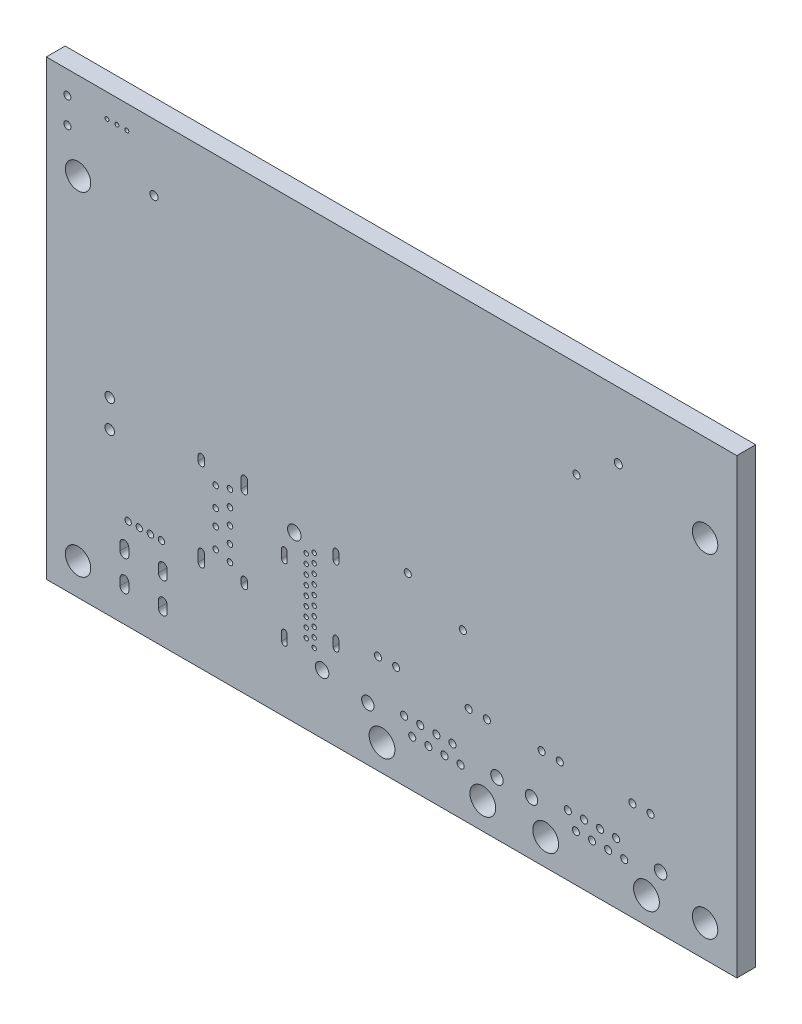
ISO-10303-21;
HEADER;
FILE_DESCRIPTION(('STEP AP214'),'2;1');
FILE_NAME('part.step','',(''),(''),'','','');
FILE_SCHEMA(('AUTOMOTIVE_DESIGN { 1 0 10303 214 1 1 1 1 }'));
ENDSEC;
DATA;
#1=APPLICATION_CONTEXT('core data for automotive mechanical design processes');
#2=APPLICATION_PROTOCOL_DEFINITION('international standard','automotive_design',2000,#1);
#3=PRODUCT_CONTEXT('',#1,'mechanical');
#4=PRODUCT('Part','Part','',(#3));
#5=PRODUCT_RELATED_PRODUCT_CATEGORY('part','',(#4));
#6=PRODUCT_DEFINITION_FORMATION('','',#4);
#7=PRODUCT_DEFINITION_CONTEXT('part definition',#1,'design');
#8=PRODUCT_DEFINITION('design','',#6,#7);
#9=PRODUCT_DEFINITION_SHAPE('','',#8);
#10=(LENGTH_UNIT() NAMED_UNIT(*) SI_UNIT(.MILLI.,.METRE.));
#11=(NAMED_UNIT(*) PLANE_ANGLE_UNIT() SI_UNIT($,.RADIAN.));
#12=(NAMED_UNIT(*) SI_UNIT($,.STERADIAN.) SOLID_ANGLE_UNIT());
#13=UNCERTAINTY_MEASURE_WITH_UNIT(LENGTH_MEASURE(1.E-05),#10,'distance_accuracy_value','');
#14=(GEOMETRIC_REPRESENTATION_CONTEXT(3) GLOBAL_UNCERTAINTY_ASSIGNED_CONTEXT((#13)) GLOBAL_UNIT_ASSIGNED_CONTEXT((#10,
#11,#12)) REPRESENTATION_CONTEXT('',''));
#15=CARTESIAN_POINT('',(0.,0.,0.));
#16=DIRECTION('',(0.,0.,1.));
#17=DIRECTION('',(1.,0.,0.));
#18=AXIS2_PLACEMENT_3D('',#15,#16,#17);
#19=CARTESIAN_POINT('',(9.84339916,7.77099792,0.));
#20=DIRECTION('',(0.,0.,-1.));
#21=DIRECTION('',(-1.,0.,0.));
#22=AXIS2_PLACEMENT_3D('',#19,#20,#21);
#23=CYLINDRICAL_SURFACE('',#22,0.5499989);
#24=CARTESIAN_POINT('',(9.84339916,7.77099792,2.378964));
#25=DIRECTION('',(0.,0.,-1.));
#26=DIRECTION('',(-1.,0.,0.));
#27=AXIS2_PLACEMENT_3D('',#24,#25,#26);
#28=CIRCLE('',#27,0.5499989);
#29=CARTESIAN_POINT('',(10.39339806,7.77099792,2.378964));
#30=VERTEX_POINT('',#29);
#31=CARTESIAN_POINT('',(9.29340026,7.77099792,2.378964));
#32=VERTEX_POINT('',#31);
#33=EDGE_CURVE('E265',#30,#32,#28,.T.);
#34=ORIENTED_EDGE('',*,*,#33,.F.);
#35=DIRECTION('',(0.,0.,1.));
#36=VECTOR('',#35,1.);
#37=CARTESIAN_POINT('',(10.39339806,7.77099792,0.));
#38=LINE('',#37,#36);
#39=CARTESIAN_POINT('',(10.39339806,7.77099792,0.));
#40=VERTEX_POINT('',#39);
#41=EDGE_CURVE('E267',#40,#30,#38,.T.);
#42=ORIENTED_EDGE('',*,*,#41,.F.);
#43=CARTESIAN_POINT('',(9.84339916,7.77099792,0.));
#44=DIRECTION('',(0.,0.,-1.));
#45=DIRECTION('',(-1.,0.,0.));
#46=AXIS2_PLACEMENT_3D('',#43,#44,#45);
#47=CIRCLE('',#46,0.5499989);
#48=CARTESIAN_POINT('',(9.29340026,7.77099792,0.));
#49=VERTEX_POINT('',#48);
#50=EDGE_CURVE('E18',#49,#40,#47,.F.);
#51=ORIENTED_EDGE('',*,*,#50,.F.);
#52=DIRECTION('',(0.,0.,-1.));
#53=VECTOR('',#52,1.);
#54=CARTESIAN_POINT('',(9.29340026,7.77099792,0.));
#55=LINE('',#54,#53);
#56=EDGE_CURVE('E272',#32,#49,#55,.T.);
#57=ORIENTED_EDGE('',*,*,#56,.F.);
#58=EDGE_LOOP('',(#34,#42,#51,#57));
#59=FACE_BOUND('',#58,.T.);
#60=ADVANCED_FACE('F15',(#59),#23,.F.);
#61=CARTESIAN_POINT('',(9.8434017,3.93099798,0.));
#62=DIRECTION('',(0.,0.,-1.));
#63=DIRECTION('',(-1.,0.,0.));
#64=AXIS2_PLACEMENT_3D('',#61,#62,#63);
#65=CYLINDRICAL_SURFACE('',#64,0.5499989);
#66=CARTESIAN_POINT('',(9.8434017,3.93099798,2.378964));
#67=DIRECTION('',(0.,0.,-1.));
#68=DIRECTION('',(-1.,0.,0.));
#69=AXIS2_PLACEMENT_3D('',#66,#67,#68);
#70=CIRCLE('',#69,0.5499989);
#71=CARTESIAN_POINT('',(10.3934006,3.93099798,2.378964));
#72=VERTEX_POINT('',#71);
#73=CARTESIAN_POINT('',(9.2934028,3.93099798,2.378964));
#74=VERTEX_POINT('',#73);
#75=EDGE_CURVE('E404',#72,#74,#70,.T.);
#76=ORIENTED_EDGE('',*,*,#75,.F.);
#77=DIRECTION('',(0.,0.,1.));
#78=VECTOR('',#77,1.);
#79=CARTESIAN_POINT('',(10.3934006,3.93099798,0.));
#80=LINE('',#79,#78);
#81=CARTESIAN_POINT('',(10.3934006,3.93099798,0.));
#82=VERTEX_POINT('',#81);
#83=EDGE_CURVE('E347',#82,#72,#80,.T.);
#84=ORIENTED_EDGE('',*,*,#83,.F.);
#85=CARTESIAN_POINT('',(9.8434017,3.93099798,0.));
#86=DIRECTION('',(0.,0.,-1.));
#87=DIRECTION('',(-1.,0.,0.));
#88=AXIS2_PLACEMENT_3D('',#85,#86,#87);
#89=CIRCLE('',#88,0.5499989);
#90=CARTESIAN_POINT('',(9.2934028,3.93099798,0.));
#91=VERTEX_POINT('',#90);
#92=EDGE_CURVE('E407',#91,#82,#89,.F.);
#93=ORIENTED_EDGE('',*,*,#92,.F.);
#94=DIRECTION('',(0.,0.,-1.));
#95=VECTOR('',#94,1.);
#96=CARTESIAN_POINT('',(9.2934028,3.93099798,0.));
#97=LINE('',#96,#95);
#98=EDGE_CURVE('E350',#74,#91,#97,.T.);
#99=ORIENTED_EDGE('',*,*,#98,.F.);
#100=EDGE_LOOP('',(#76,#84,#93,#99));
#101=FACE_BOUND('',#100,.T.);
#102=ADVANCED_FACE('F1164',(#101),#65,.F.);
#103=CARTESIAN_POINT('',(14.68339964,7.77099792,0.));
#104=DIRECTION('',(0.,0.,-1.));
#105=DIRECTION('',(-1.,0.,0.));
#106=AXIS2_PLACEMENT_3D('',#103,#104,#105);
#107=CYLINDRICAL_SURFACE('',#106,0.5499989);
#108=CARTESIAN_POINT('',(14.68339964,7.77099792,2.378964));
#109=DIRECTION('',(0.,0.,-1.));
#110=DIRECTION('',(-1.,0.,0.));
#111=AXIS2_PLACEMENT_3D('',#108,#109,#110);
#112=CIRCLE('',#111,0.5499989);
#113=CARTESIAN_POINT('',(15.23339854,7.77099792,2.378964));
#114=VERTEX_POINT('',#113);
#115=CARTESIAN_POINT('',(14.13340074,7.77099792,2.378964));
#116=VERTEX_POINT('',#115);
#117=EDGE_CURVE('E399',#114,#116,#112,.T.);
#118=ORIENTED_EDGE('',*,*,#117,.F.);
#119=DIRECTION('',(0.,0.,1.));
#120=VECTOR('',#119,1.);
#121=CARTESIAN_POINT('',(15.23339854,7.77099792,0.));
#122=LINE('',#121,#120);
#123=CARTESIAN_POINT('',(15.23339854,7.77099792,0.));
#124=VERTEX_POINT('',#123);
#125=EDGE_CURVE('E341',#124,#114,#122,.T.);
#126=ORIENTED_EDGE('',*,*,#125,.F.);
#127=CARTESIAN_POINT('',(14.68339964,7.77099792,0.));
#128=DIRECTION('',(0.,0.,-1.));
#129=DIRECTION('',(-1.,0.,0.));
#130=AXIS2_PLACEMENT_3D('',#127,#128,#129);
#131=CIRCLE('',#130,0.5499989);
#132=CARTESIAN_POINT('',(14.13340074,7.77099792,0.));
#133=VERTEX_POINT('',#132);
#134=EDGE_CURVE('E402',#133,#124,#131,.F.);
#135=ORIENTED_EDGE('',*,*,#134,.F.);
#136=DIRECTION('',(0.,0.,-1.));
#137=VECTOR('',#136,1.);
#138=CARTESIAN_POINT('',(14.13340074,7.77099792,0.));
#139=LINE('',#138,#137);
#140=EDGE_CURVE('E344',#116,#133,#139,.T.);
#141=ORIENTED_EDGE('',*,*,#140,.F.);
#142=EDGE_LOOP('',(#118,#126,#135,#141));
#143=FACE_BOUND('',#142,.T.);
#144=ADVANCED_FACE('F1691',(#143),#107,.F.);
#145=CARTESIAN_POINT('',(14.68339964,3.93099798,0.));
#146=DIRECTION('',(0.,0.,-1.));
#147=DIRECTION('',(-1.,0.,0.));
#148=AXIS2_PLACEMENT_3D('',#145,#146,#147);
#149=CYLINDRICAL_SURFACE('',#148,0.5499989);
#150=CARTESIAN_POINT('',(14.68339964,3.93099798,2.378964));
#151=DIRECTION('',(0.,0.,-1.));
#152=DIRECTION('',(-1.,0.,0.));
#153=AXIS2_PLACEMENT_3D('',#150,#151,#152);
#154=CIRCLE('',#153,0.5499989);
#155=CARTESIAN_POINT('',(15.23339854,3.93099798,2.378964));
#156=VERTEX_POINT('',#155);
#157=CARTESIAN_POINT('',(14.13340074,3.93099798,2.378964));
#158=VERTEX_POINT('',#157);
#159=EDGE_CURVE('E394',#156,#158,#154,.T.);
#160=ORIENTED_EDGE('',*,*,#159,.F.);
#161=DIRECTION('',(0.,0.,1.));
#162=VECTOR('',#161,1.);
#163=CARTESIAN_POINT('',(15.23339854,3.93099798,0.));
#164=LINE('',#163,#162);
#165=CARTESIAN_POINT('',(15.23339854,3.93099798,0.));
#166=VERTEX_POINT('',#165);
#167=EDGE_CURVE('E335',#166,#156,#164,.T.);
#168=ORIENTED_EDGE('',*,*,#167,.F.);
#169=CARTESIAN_POINT('',(14.68339964,3.93099798,0.));
#170=DIRECTION('',(0.,0.,-1.));
#171=DIRECTION('',(-1.,0.,0.));
#172=AXIS2_PLACEMENT_3D('',#169,#170,#171);
#173=CIRCLE('',#172,0.5499989);
#174=CARTESIAN_POINT('',(14.13340074,3.93099798,0.));
#175=VERTEX_POINT('',#174);
#176=EDGE_CURVE('E397',#175,#166,#173,.F.);
#177=ORIENTED_EDGE('',*,*,#176,.F.);
#178=DIRECTION('',(0.,0.,-1.));
#179=VECTOR('',#178,1.);
#180=CARTESIAN_POINT('',(14.13340074,3.93099798,0.));
#181=LINE('',#180,#179);
#182=EDGE_CURVE('E338',#158,#175,#181,.T.);
#183=ORIENTED_EDGE('',*,*,#182,.F.);
#184=EDGE_LOOP('',(#160,#168,#177,#183));
#185=FACE_BOUND('',#184,.T.);
#186=ADVANCED_FACE('F1687',(#185),#149,.F.);
#187=CARTESIAN_POINT('',(19.53319944,11.43659892,0.));
#188=DIRECTION('',(0.,0.,-1.));
#189=DIRECTION('',(-1.,0.,0.));
#190=AXIS2_PLACEMENT_3D('',#187,#188,#189);
#191=CYLINDRICAL_SURFACE('',#190,0.3999992);
#192=CARTESIAN_POINT('',(19.53319944,11.43659892,2.378964));
#193=DIRECTION('',(0.,0.,-1.));
#194=DIRECTION('',(-1.,0.,0.));
#195=AXIS2_PLACEMENT_3D('',#192,#193,#194);
#196=CIRCLE('',#195,0.3999992);
#197=CARTESIAN_POINT('',(19.93319864,11.43659892,2.378964));
#198=VERTEX_POINT('',#197);
#199=CARTESIAN_POINT('',(19.13320024,11.43659892,2.378964));
#200=VERTEX_POINT('',#199);
#201=EDGE_CURVE('E389',#198,#200,#196,.T.);
#202=ORIENTED_EDGE('',*,*,#201,.F.);
#203=DIRECTION('',(0.,0.,1.));
#204=VECTOR('',#203,1.);
#205=CARTESIAN_POINT('',(19.93319864,11.43659892,0.));
#206=LINE('',#205,#204);
#207=CARTESIAN_POINT('',(19.93319864,11.43659892,0.));
#208=VERTEX_POINT('',#207);
#209=EDGE_CURVE('E329',#208,#198,#206,.T.);
#210=ORIENTED_EDGE('',*,*,#209,.F.);
#211=CARTESIAN_POINT('',(19.53319944,11.43659892,0.));
#212=DIRECTION('',(0.,0.,-1.));
#213=DIRECTION('',(-1.,0.,0.));
#214=AXIS2_PLACEMENT_3D('',#211,#212,#213);
#215=CIRCLE('',#214,0.3999992);
#216=CARTESIAN_POINT('',(19.13320024,11.43659892,0.));
#217=VERTEX_POINT('',#216);
#218=EDGE_CURVE('E392',#217,#208,#215,.F.);
#219=ORIENTED_EDGE('',*,*,#218,.F.);
#220=DIRECTION('',(0.,0.,-1.));
#221=VECTOR('',#220,1.);
#222=CARTESIAN_POINT('',(19.13320024,11.43659892,0.));
#223=LINE('',#222,#221);
#224=EDGE_CURVE('E332',#200,#217,#223,.T.);
#225=ORIENTED_EDGE('',*,*,#224,.F.);
#226=EDGE_LOOP('',(#202,#210,#219,#225));
#227=FACE_BOUND('',#226,.T.);
#228=ADVANCED_FACE('F1683',(#227),#191,.F.);
#229=CARTESIAN_POINT('',(29.99939898,9.18480002,0.));
#230=DIRECTION('',(0.,0.,-1.));
#231=DIRECTION('',(-1.,0.,0.));
#232=AXIS2_PLACEMENT_3D('',#229,#230,#231);
#233=CYLINDRICAL_SURFACE('',#232,0.3499993);
#234=CARTESIAN_POINT('',(29.99939898,9.18480002,2.378964));
#235=DIRECTION('',(0.,0.,-1.));
#236=DIRECTION('',(-1.,0.,0.));
#237=AXIS2_PLACEMENT_3D('',#234,#235,#236);
#238=CIRCLE('',#237,0.3499993);
#239=CARTESIAN_POINT('',(29.64939968,9.18480002,2.378964));
#240=VERTEX_POINT('',#239);
#241=CARTESIAN_POINT('',(30.34939828,9.18480002,2.378964));
#242=VERTEX_POINT('',#241);
#243=EDGE_CURVE('E384',#240,#242,#238,.T.);
#244=ORIENTED_EDGE('',*,*,#243,.F.);
#245=DIRECTION('',(0.,0.,-1.));
#246=VECTOR('',#245,1.);
#247=CARTESIAN_POINT('',(29.64939968,9.18480002,0.));
#248=LINE('',#247,#246);
#249=CARTESIAN_POINT('',(29.64939968,9.18480002,0.));
#250=VERTEX_POINT('',#249);
#251=EDGE_CURVE('E323',#250,#240,#248,.F.);
#252=ORIENTED_EDGE('',*,*,#251,.F.);
#253=CARTESIAN_POINT('',(29.99939898,9.18480002,0.));
#254=DIRECTION('',(0.,0.,-1.));
#255=DIRECTION('',(-1.,0.,0.));
#256=AXIS2_PLACEMENT_3D('',#253,#254,#255);
#257=CIRCLE('',#256,0.3499993);
#258=CARTESIAN_POINT('',(30.34939828,9.18480002,0.));
#259=VERTEX_POINT('',#258);
#260=EDGE_CURVE('E387',#259,#250,#257,.F.);
#261=ORIENTED_EDGE('',*,*,#260,.F.);
#262=DIRECTION('',(0.,0.,1.));
#263=VECTOR('',#262,1.);
#264=CARTESIAN_POINT('',(30.34939828,9.18480002,0.));
#265=LINE('',#264,#263);
#266=EDGE_CURVE('E326',#242,#259,#265,.F.);
#267=ORIENTED_EDGE('',*,*,#266,.F.);
#268=EDGE_LOOP('',(#244,#252,#261,#267));
#269=FACE_BOUND('',#268,.T.);
#270=ADVANCED_FACE('F1679',(#269),#233,.F.);
#271=CARTESIAN_POINT('',(24.95319876,11.78660076,0.));
#272=DIRECTION('',(0.,0.,-1.));
#273=DIRECTION('',(-1.,0.,0.));
#274=AXIS2_PLACEMENT_3D('',#271,#272,#273);
#275=CYLINDRICAL_SURFACE('',#274,0.3999992);
#276=CARTESIAN_POINT('',(24.95319876,11.78660076,2.378964));
#277=DIRECTION('',(0.,0.,-1.));
#278=DIRECTION('',(-1.,0.,0.));
#279=AXIS2_PLACEMENT_3D('',#276,#277,#278);
#280=CIRCLE('',#279,0.3999992);
#281=CARTESIAN_POINT('',(25.35319796,11.78660076,2.378964));
#282=VERTEX_POINT('',#281);
#283=CARTESIAN_POINT('',(24.55319956,11.78660076,2.378964));
#284=VERTEX_POINT('',#283);
#285=EDGE_CURVE('E379',#282,#284,#280,.T.);
#286=ORIENTED_EDGE('',*,*,#285,.F.);
#287=DIRECTION('',(0.,0.,1.));
#288=VECTOR('',#287,1.);
#289=CARTESIAN_POINT('',(25.35319796,11.78660076,0.));
#290=LINE('',#289,#288);
#291=CARTESIAN_POINT('',(25.35319796,11.78660076,0.));
#292=VERTEX_POINT('',#291);
#293=EDGE_CURVE('E317',#292,#282,#290,.T.);
#294=ORIENTED_EDGE('',*,*,#293,.F.);
#295=CARTESIAN_POINT('',(24.95319876,11.78660076,0.));
#296=DIRECTION('',(0.,0.,-1.));
#297=DIRECTION('',(-1.,0.,0.));
#298=AXIS2_PLACEMENT_3D('',#295,#296,#297);
#299=CIRCLE('',#298,0.3999992);
#300=CARTESIAN_POINT('',(24.55319956,11.78660076,0.));
#301=VERTEX_POINT('',#300);
#302=EDGE_CURVE('E382',#301,#292,#299,.F.);
#303=ORIENTED_EDGE('',*,*,#302,.F.);
#304=DIRECTION('',(0.,0.,-1.));
#305=VECTOR('',#304,1.);
#306=CARTESIAN_POINT('',(24.55319956,11.78660076,0.));
#307=LINE('',#306,#305);
#308=EDGE_CURVE('E320',#284,#301,#307,.T.);
#309=ORIENTED_EDGE('',*,*,#308,.F.);
#310=EDGE_LOOP('',(#286,#294,#303,#309));
#311=FACE_BOUND('',#310,.T.);
#312=ADVANCED_FACE('F1675',(#311),#275,.F.);
#313=CARTESIAN_POINT('',(19.53319944,22.48659968,0.));
#314=DIRECTION('',(0.,0.,-1.));
#315=DIRECTION('',(-1.,0.,0.));
#316=AXIS2_PLACEMENT_3D('',#313,#314,#315);
#317=CYLINDRICAL_SURFACE('',#316,0.3999992);
#318=CARTESIAN_POINT('',(19.53319944,22.48659968,2.378964));
#319=DIRECTION('',(0.,0.,-1.));
#320=DIRECTION('',(-1.,0.,0.));
#321=AXIS2_PLACEMENT_3D('',#318,#319,#320);
#322=CIRCLE('',#321,0.3999992);
#323=CARTESIAN_POINT('',(19.93319864,22.48659968,2.378964));
#324=VERTEX_POINT('',#323);
#325=CARTESIAN_POINT('',(19.13320024,22.48659968,2.378964));
#326=VERTEX_POINT('',#325);
#327=EDGE_CURVE('E374',#324,#326,#322,.T.);
#328=ORIENTED_EDGE('',*,*,#327,.F.);
#329=DIRECTION('',(0.,0.,1.));
#330=VECTOR('',#329,1.);
#331=CARTESIAN_POINT('',(19.93319864,22.48659968,0.));
#332=LINE('',#331,#330);
#333=CARTESIAN_POINT('',(19.93319864,22.48659968,0.));
#334=VERTEX_POINT('',#333);
#335=EDGE_CURVE('E311',#334,#324,#332,.T.);
#336=ORIENTED_EDGE('',*,*,#335,.F.);
#337=CARTESIAN_POINT('',(19.53319944,22.48659968,0.));
#338=DIRECTION('',(0.,0.,-1.));
#339=DIRECTION('',(-1.,0.,0.));
#340=AXIS2_PLACEMENT_3D('',#337,#338,#339);
#341=CIRCLE('',#340,0.3999992);
#342=CARTESIAN_POINT('',(19.13320024,22.48659968,0.));
#343=VERTEX_POINT('',#342);
#344=EDGE_CURVE('E377',#343,#334,#341,.F.);
#345=ORIENTED_EDGE('',*,*,#344,.F.);
#346=DIRECTION('',(0.,0.,-1.));
#347=VECTOR('',#346,1.);
#348=CARTESIAN_POINT('',(19.13320024,22.48659968,0.));
#349=LINE('',#348,#347);
#350=EDGE_CURVE('E314',#326,#343,#349,.T.);
#351=ORIENTED_EDGE('',*,*,#350,.F.);
#352=EDGE_LOOP('',(#328,#336,#345,#351));
#353=FACE_BOUND('',#352,.T.);
#354=ADVANCED_FACE('F1671',(#353),#317,.F.);
#355=CARTESIAN_POINT('',(29.99939898,18.1847998,0.));
#356=DIRECTION('',(0.,0.,-1.));
#357=DIRECTION('',(-1.,0.,0.));
#358=AXIS2_PLACEMENT_3D('',#355,#356,#357);
#359=CYLINDRICAL_SURFACE('',#358,0.3499993);
#360=CARTESIAN_POINT('',(29.99939898,18.1847998,2.378964));
#361=DIRECTION('',(0.,0.,-1.));
#362=DIRECTION('',(-1.,0.,0.));
#363=AXIS2_PLACEMENT_3D('',#360,#361,#362);
#364=CIRCLE('',#363,0.3499993);
#365=CARTESIAN_POINT('',(29.64939968,18.1847998,2.378964));
#366=VERTEX_POINT('',#365);
#367=CARTESIAN_POINT('',(30.34939828,18.1847998,2.378964));
#368=VERTEX_POINT('',#367);
#369=EDGE_CURVE('E369',#366,#368,#364,.T.);
#370=ORIENTED_EDGE('',*,*,#369,.F.);
#371=DIRECTION('',(0.,0.,-1.));
#372=VECTOR('',#371,1.);
#373=CARTESIAN_POINT('',(29.64939968,18.1847998,0.));
#374=LINE('',#373,#372);
#375=CARTESIAN_POINT('',(29.64939968,18.1847998,0.));
#376=VERTEX_POINT('',#375);
#377=EDGE_CURVE('E305',#376,#366,#374,.F.);
#378=ORIENTED_EDGE('',*,*,#377,.F.);
#379=CARTESIAN_POINT('',(29.99939898,18.1847998,0.));
#380=DIRECTION('',(0.,0.,-1.));
#381=DIRECTION('',(-1.,0.,0.));
#382=AXIS2_PLACEMENT_3D('',#379,#380,#381);
#383=CIRCLE('',#382,0.3499993);
#384=CARTESIAN_POINT('',(30.34939828,18.1847998,0.));
#385=VERTEX_POINT('',#384);
#386=EDGE_CURVE('E372',#385,#376,#383,.F.);
#387=ORIENTED_EDGE('',*,*,#386,.F.);
#388=DIRECTION('',(0.,0.,1.));
#389=VECTOR('',#388,1.);
#390=CARTESIAN_POINT('',(30.34939828,18.1847998,0.));
#391=LINE('',#390,#389);
#392=EDGE_CURVE('E308',#368,#385,#391,.F.);
#393=ORIENTED_EDGE('',*,*,#392,.F.);
#394=EDGE_LOOP('',(#370,#378,#387,#393));
#395=FACE_BOUND('',#394,.T.);
#396=ADVANCED_FACE('F1667',(#395),#359,.F.);
#397=CARTESIAN_POINT('',(24.95319876,22.13659784,0.));
#398=DIRECTION('',(0.,0.,-1.));
#399=DIRECTION('',(-1.,0.,0.));
#400=AXIS2_PLACEMENT_3D('',#397,#398,#399);
#401=CYLINDRICAL_SURFACE('',#400,0.3999992);
#402=CARTESIAN_POINT('',(24.95319876,22.13659784,2.378964));
#403=DIRECTION('',(0.,0.,-1.));
#404=DIRECTION('',(-1.,0.,0.));
#405=AXIS2_PLACEMENT_3D('',#402,#403,#404);
#406=CIRCLE('',#405,0.3999992);
#407=CARTESIAN_POINT('',(25.35319796,22.13659784,2.378964));
#408=VERTEX_POINT('',#407);
#409=CARTESIAN_POINT('',(24.55319956,22.13659784,2.378964));
#410=VERTEX_POINT('',#409);
#411=EDGE_CURVE('E364',#408,#410,#406,.T.);
#412=ORIENTED_EDGE('',*,*,#411,.F.);
#413=DIRECTION('',(0.,0.,1.));
#414=VECTOR('',#413,1.);
#415=CARTESIAN_POINT('',(25.35319796,22.13659784,0.));
#416=LINE('',#415,#414);
#417=CARTESIAN_POINT('',(25.35319796,22.13659784,0.));
#418=VERTEX_POINT('',#417);
#419=EDGE_CURVE('E299',#418,#408,#416,.T.);
#420=ORIENTED_EDGE('',*,*,#419,.F.);
#421=CARTESIAN_POINT('',(24.95319876,22.13659784,0.));
#422=DIRECTION('',(0.,0.,-1.));
#423=DIRECTION('',(-1.,0.,0.));
#424=AXIS2_PLACEMENT_3D('',#421,#422,#423);
#425=CIRCLE('',#424,0.3999992);
#426=CARTESIAN_POINT('',(24.55319956,22.13659784,0.));
#427=VERTEX_POINT('',#426);
#428=EDGE_CURVE('E367',#427,#418,#425,.F.);
#429=ORIENTED_EDGE('',*,*,#428,.F.);
#430=DIRECTION('',(0.,0.,-1.));
#431=VECTOR('',#430,1.);
#432=CARTESIAN_POINT('',(24.55319956,22.13659784,0.));
#433=LINE('',#432,#431);
#434=EDGE_CURVE('E302',#410,#427,#433,.T.);
#435=ORIENTED_EDGE('',*,*,#434,.F.);
#436=EDGE_LOOP('',(#412,#420,#429,#435));
#437=FACE_BOUND('',#436,.T.);
#438=ADVANCED_FACE('F1663',(#437),#401,.F.);
#439=CARTESIAN_POINT('',(36.49939868,11.7847999,0.));
#440=DIRECTION('',(0.,0.,-1.));
#441=DIRECTION('',(-1.,0.,0.));
#442=AXIS2_PLACEMENT_3D('',#439,#440,#441);
#443=CYLINDRICAL_SURFACE('',#442,0.3499993);
#444=CARTESIAN_POINT('',(36.49939868,11.7847999,2.378964));
#445=DIRECTION('',(0.,0.,-1.));
#446=DIRECTION('',(-1.,0.,0.));
#447=AXIS2_PLACEMENT_3D('',#444,#445,#446);
#448=CIRCLE('',#447,0.3499993);
#449=CARTESIAN_POINT('',(36.14939938,11.7847999,2.378964));
#450=VERTEX_POINT('',#449);
#451=CARTESIAN_POINT('',(36.84939798,11.7847999,2.378964));
#452=VERTEX_POINT('',#451);
#453=EDGE_CURVE('E359',#450,#452,#448,.T.);
#454=ORIENTED_EDGE('',*,*,#453,.F.);
#455=DIRECTION('',(0.,0.,-1.));
#456=VECTOR('',#455,1.);
#457=CARTESIAN_POINT('',(36.14939938,11.7847999,0.));
#458=LINE('',#457,#456);
#459=CARTESIAN_POINT('',(36.14939938,11.7847999,0.));
#460=VERTEX_POINT('',#459);
#461=EDGE_CURVE('E293',#460,#450,#458,.F.);
#462=ORIENTED_EDGE('',*,*,#461,.F.);
#463=CARTESIAN_POINT('',(36.49939868,11.7847999,0.));
#464=DIRECTION('',(0.,0.,-1.));
#465=DIRECTION('',(-1.,0.,0.));
#466=AXIS2_PLACEMENT_3D('',#463,#464,#465);
#467=CIRCLE('',#466,0.3499993);
#468=CARTESIAN_POINT('',(36.84939798,11.7847999,0.));
#469=VERTEX_POINT('',#468);
#470=EDGE_CURVE('E362',#469,#460,#467,.F.);
#471=ORIENTED_EDGE('',*,*,#470,.F.);
#472=DIRECTION('',(0.,0.,1.));
#473=VECTOR('',#472,1.);
#474=CARTESIAN_POINT('',(36.84939798,11.7847999,0.));
#475=LINE('',#474,#473);
#476=EDGE_CURVE('E296',#452,#469,#475,.F.);
#477=ORIENTED_EDGE('',*,*,#476,.F.);
#478=EDGE_LOOP('',(#454,#462,#471,#477));
#479=FACE_BOUND('',#478,.T.);
#480=ADVANCED_FACE('F1659',(#479),#443,.F.);
#481=CARTESIAN_POINT('',(36.49939868,21.28479868,0.));
#482=DIRECTION('',(0.,0.,-1.));
#483=DIRECTION('',(-1.,0.,0.));
#484=AXIS2_PLACEMENT_3D('',#481,#482,#483);
#485=CYLINDRICAL_SURFACE('',#484,0.3499993);
#486=CARTESIAN_POINT('',(36.49939868,21.28479868,2.378964));
#487=DIRECTION('',(0.,0.,-1.));
#488=DIRECTION('',(-1.,0.,0.));
#489=AXIS2_PLACEMENT_3D('',#486,#487,#488);
#490=CIRCLE('',#489,0.3499993);
#491=CARTESIAN_POINT('',(36.14939938,21.28479868,2.378964));
#492=VERTEX_POINT('',#491);
#493=CARTESIAN_POINT('',(36.84939798,21.28479868,2.378964));
#494=VERTEX_POINT('',#493);
#495=EDGE_CURVE('E354',#492,#494,#490,.T.);
#496=ORIENTED_EDGE('',*,*,#495,.F.);
#497=DIRECTION('',(0.,0.,-1.));
#498=VECTOR('',#497,1.);
#499=CARTESIAN_POINT('',(36.14939938,21.28479868,0.));
#500=LINE('',#499,#498);
#501=CARTESIAN_POINT('',(36.14939938,21.28479868,0.));
#502=VERTEX_POINT('',#501);
#503=EDGE_CURVE('E287',#502,#492,#500,.F.);
#504=ORIENTED_EDGE('',*,*,#503,.F.);
#505=CARTESIAN_POINT('',(36.49939868,21.28479868,0.));
#506=DIRECTION('',(0.,0.,-1.));
#507=DIRECTION('',(-1.,0.,0.));
#508=AXIS2_PLACEMENT_3D('',#505,#506,#507);
#509=CIRCLE('',#508,0.3499993);
#510=CARTESIAN_POINT('',(36.84939798,21.28479868,0.));
#511=VERTEX_POINT('',#510);
#512=EDGE_CURVE('E357',#511,#502,#509,.F.);
#513=ORIENTED_EDGE('',*,*,#512,.F.);
#514=DIRECTION('',(0.,0.,1.));
#515=VECTOR('',#514,1.);
#516=CARTESIAN_POINT('',(36.84939798,21.28479868,0.));
#517=LINE('',#516,#515);
#518=EDGE_CURVE('E290',#494,#511,#517,.F.);
#519=ORIENTED_EDGE('',*,*,#518,.F.);
#520=EDGE_LOOP('',(#496,#504,#513,#519));
#521=FACE_BOUND('',#520,.T.);
#522=ADVANCED_FACE('F1656',(#521),#485,.F.);
#523=CARTESIAN_POINT('',(9.29340026,8.6710012,0.));
#524=DIRECTION('',(1.,0.,0.));
#525=DIRECTION('',(0.,0.,-1.));
#526=AXIS2_PLACEMENT_3D('',#523,#524,#525);
#527=PLANE('',#526);
#528=ORIENTED_EDGE('',*,*,#56,.T.);
#529=DIRECTION('',(0.,1.,0.));
#530=VECTOR('',#529,1.);
#531=CARTESIAN_POINT('',(9.29340026,0.,0.));
#532=LINE('',#531,#530);
#533=CARTESIAN_POINT('',(9.29340026,8.6710012,0.));
#534=VERTEX_POINT('',#533);
#535=EDGE_CURVE('E264',#534,#49,#532,.F.);
#536=ORIENTED_EDGE('',*,*,#535,.F.);
#537=DIRECTION('',(0.,0.,-1.));
#538=VECTOR('',#537,1.);
#539=CARTESIAN_POINT('',(9.29340026,8.6710012,0.));
#540=LINE('',#539,#538);
#541=CARTESIAN_POINT('',(9.29340026,8.6710012,2.378964));
#542=VERTEX_POINT('',#541);
#543=EDGE_CURVE('E1007',#534,#542,#540,.F.);
#544=ORIENTED_EDGE('',*,*,#543,.T.);
#545=DIRECTION('',(0.,1.,0.));
#546=VECTOR('',#545,1.);
#547=CARTESIAN_POINT('',(9.29340026,8.6710012,2.378964));
#548=LINE('',#547,#546);
#549=EDGE_CURVE('E352',#542,#32,#548,.F.);
#550=ORIENTED_EDGE('',*,*,#549,.T.);
#551=EDGE_LOOP('',(#528,#536,#544,#550));
#552=FACE_BOUND('',#551,.T.);
#553=ADVANCED_FACE('F1653',(#552),#527,.T.);
#554=CARTESIAN_POINT('',(10.39339806,7.77099792,0.));
#555=DIRECTION('',(-1.,0.,0.));
#556=DIRECTION('',(0.,0.,1.));
#557=AXIS2_PLACEMENT_3D('',#554,#555,#556);
#558=PLANE('',#557);
#559=DIRECTION('',(0.,0.,-1.));
#560=VECTOR('',#559,1.);
#561=CARTESIAN_POINT('',(10.39339806,8.6710012,0.));
#562=LINE('',#561,#560);
#563=CARTESIAN_POINT('',(10.39339806,8.6710012,2.378964));
#564=VERTEX_POINT('',#563);
#565=CARTESIAN_POINT('',(10.39339806,8.6710012,0.));
#566=VERTEX_POINT('',#565);
#567=EDGE_CURVE('E277',#564,#566,#562,.T.);
#568=ORIENTED_EDGE('',*,*,#567,.T.);
#569=DIRECTION('',(0.,1.,0.));
#570=VECTOR('',#569,1.);
#571=CARTESIAN_POINT('',(10.39339806,0.,0.));
#572=LINE('',#571,#570);
#573=EDGE_CURVE('E261',#40,#566,#572,.T.);
#574=ORIENTED_EDGE('',*,*,#573,.F.);
#575=ORIENTED_EDGE('',*,*,#41,.T.);
#576=DIRECTION('',(0.,1.,0.));
#577=VECTOR('',#576,1.);
#578=CARTESIAN_POINT('',(10.39339806,7.77099792,2.378964));
#579=LINE('',#578,#577);
#580=EDGE_CURVE('E271',#30,#564,#579,.T.);
#581=ORIENTED_EDGE('',*,*,#580,.T.);
#582=EDGE_LOOP('',(#568,#574,#575,#581));
#583=FACE_BOUND('',#582,.T.);
#584=ADVANCED_FACE('F275',(#583),#558,.T.);
#585=CARTESIAN_POINT('',(9.2934028,4.83100126,0.));
#586=DIRECTION('',(1.,0.,0.));
#587=DIRECTION('',(0.,0.,-1.));
#588=AXIS2_PLACEMENT_3D('',#585,#586,#587);
#589=PLANE('',#588);
#590=ORIENTED_EDGE('',*,*,#98,.T.);
#591=DIRECTION('',(0.,1.,0.));
#592=VECTOR('',#591,1.);
#593=CARTESIAN_POINT('',(9.2934028,0.,0.));
#594=LINE('',#593,#592);
#595=CARTESIAN_POINT('',(9.2934028,4.83100126,0.));
#596=VERTEX_POINT('',#595);
#597=EDGE_CURVE('E278',#596,#91,#594,.F.);
#598=ORIENTED_EDGE('',*,*,#597,.F.);
#599=DIRECTION('',(0.,0.,-1.));
#600=VECTOR('',#599,1.);
#601=CARTESIAN_POINT('',(9.2934028,4.83100126,0.));
#602=LINE('',#601,#600);
#603=CARTESIAN_POINT('',(9.2934028,4.83100126,2.378964));
#604=VERTEX_POINT('',#603);
#605=EDGE_CURVE('E1004',#596,#604,#602,.F.);
#606=ORIENTED_EDGE('',*,*,#605,.T.);
#607=DIRECTION('',(0.,1.,0.));
#608=VECTOR('',#607,1.);
#609=CARTESIAN_POINT('',(9.2934028,4.83100126,2.378964));
#610=LINE('',#609,#608);
#611=EDGE_CURVE('E348',#604,#74,#610,.F.);
#612=ORIENTED_EDGE('',*,*,#611,.T.);
#613=EDGE_LOOP('',(#590,#598,#606,#612));
#614=FACE_BOUND('',#613,.T.);
#615=ADVANCED_FACE('F1162',(#614),#589,.T.);
#616=CARTESIAN_POINT('',(10.3934006,3.93099798,0.));
#617=DIRECTION('',(-1.,0.,0.));
#618=DIRECTION('',(0.,0.,1.));
#619=AXIS2_PLACEMENT_3D('',#616,#617,#618);
#620=PLANE('',#619);
#621=DIRECTION('',(0.,0.,-1.));
#622=VECTOR('',#621,1.);
#623=CARTESIAN_POINT('',(10.3934006,4.83100126,0.));
#624=LINE('',#623,#622);
#625=CARTESIAN_POINT('',(10.3934006,4.83100126,2.378964));
#626=VERTEX_POINT('',#625);
#627=CARTESIAN_POINT('',(10.3934006,4.83100126,0.));
#628=VERTEX_POINT('',#627);
#629=EDGE_CURVE('E1000',#626,#628,#624,.T.);
#630=ORIENTED_EDGE('',*,*,#629,.T.);
#631=DIRECTION('',(0.,1.,0.));
#632=VECTOR('',#631,1.);
#633=CARTESIAN_POINT('',(10.3934006,0.,0.));
#634=LINE('',#633,#632);
#635=EDGE_CURVE('E281',#82,#628,#634,.T.);
#636=ORIENTED_EDGE('',*,*,#635,.F.);
#637=ORIENTED_EDGE('',*,*,#83,.T.);
#638=DIRECTION('',(0.,1.,0.));
#639=VECTOR('',#638,1.);
#640=CARTESIAN_POINT('',(10.3934006,3.93099798,2.378964));
#641=LINE('',#640,#639);
#642=EDGE_CURVE('E345',#72,#626,#641,.T.);
#643=ORIENTED_EDGE('',*,*,#642,.T.);
#644=EDGE_LOOP('',(#630,#636,#637,#643));
#645=FACE_BOUND('',#644,.T.);
#646=ADVANCED_FACE('F1103',(#645),#620,.T.);
#647=CARTESIAN_POINT('',(14.13340074,8.6710012,0.));
#648=DIRECTION('',(1.,0.,0.));
#649=DIRECTION('',(0.,0.,-1.));
#650=AXIS2_PLACEMENT_3D('',#647,#648,#649);
#651=PLANE('',#650);
#652=ORIENTED_EDGE('',*,*,#140,.T.);
#653=DIRECTION('',(0.,1.,0.));
#654=VECTOR('',#653,1.);
#655=CARTESIAN_POINT('',(14.13340074,0.,0.));
#656=LINE('',#655,#654);
#657=CARTESIAN_POINT('',(14.13340074,8.6710012,0.));
#658=VERTEX_POINT('',#657);
#659=EDGE_CURVE('E1084',#658,#133,#656,.F.);
#660=ORIENTED_EDGE('',*,*,#659,.F.);
#661=DIRECTION('',(0.,0.,-1.));
#662=VECTOR('',#661,1.);
#663=CARTESIAN_POINT('',(14.13340074,8.6710012,0.));
#664=LINE('',#663,#662);
#665=CARTESIAN_POINT('',(14.13340074,8.6710012,2.378964));
#666=VERTEX_POINT('',#665);
#667=EDGE_CURVE('E999',#658,#666,#664,.F.);
#668=ORIENTED_EDGE('',*,*,#667,.T.);
#669=DIRECTION('',(0.,1.,0.));
#670=VECTOR('',#669,1.);
#671=CARTESIAN_POINT('',(14.13340074,8.6710012,2.378964));
#672=LINE('',#671,#670);
#673=EDGE_CURVE('E342',#666,#116,#672,.F.);
#674=ORIENTED_EDGE('',*,*,#673,.T.);
#675=EDGE_LOOP('',(#652,#660,#668,#674));
#676=FACE_BOUND('',#675,.T.);
#677=ADVANCED_FACE('F1642',(#676),#651,.T.);
#678=CARTESIAN_POINT('',(15.23339854,7.77099792,0.));
#679=DIRECTION('',(-1.,0.,0.));
#680=DIRECTION('',(0.,0.,1.));
#681=AXIS2_PLACEMENT_3D('',#678,#679,#680);
#682=PLANE('',#681);
#683=DIRECTION('',(0.,0.,-1.));
#684=VECTOR('',#683,1.);
#685=CARTESIAN_POINT('',(15.23339854,8.6710012,0.));
#686=LINE('',#685,#684);
#687=CARTESIAN_POINT('',(15.23339854,8.6710012,2.378964));
#688=VERTEX_POINT('',#687);
#689=CARTESIAN_POINT('',(15.23339854,8.6710012,0.));
#690=VERTEX_POINT('',#689);
#691=EDGE_CURVE('E995',#688,#690,#686,.T.);
#692=ORIENTED_EDGE('',*,*,#691,.T.);
#693=DIRECTION('',(0.,1.,0.));
#694=VECTOR('',#693,1.);
#695=CARTESIAN_POINT('',(15.23339854,0.,0.));
#696=LINE('',#695,#694);
#697=EDGE_CURVE('E1081',#124,#690,#696,.T.);
#698=ORIENTED_EDGE('',*,*,#697,.F.);
#699=ORIENTED_EDGE('',*,*,#125,.T.);
#700=DIRECTION('',(0.,1.,0.));
#701=VECTOR('',#700,1.);
#702=CARTESIAN_POINT('',(15.23339854,7.77099792,2.378964));
#703=LINE('',#702,#701);
#704=EDGE_CURVE('E339',#114,#688,#703,.T.);
#705=ORIENTED_EDGE('',*,*,#704,.T.);
#706=EDGE_LOOP('',(#692,#698,#699,#705));
#707=FACE_BOUND('',#706,.T.);
#708=ADVANCED_FACE('F1638',(#707),#682,.T.);
#709=CARTESIAN_POINT('',(14.13340074,4.83100126,0.));
#710=DIRECTION('',(1.,0.,0.));
#711=DIRECTION('',(0.,0.,-1.));
#712=AXIS2_PLACEMENT_3D('',#709,#710,#711);
#713=PLANE('',#712);
#714=ORIENTED_EDGE('',*,*,#182,.T.);
#715=DIRECTION('',(0.,1.,0.));
#716=VECTOR('',#715,1.);
#717=CARTESIAN_POINT('',(14.13340074,0.,0.));
#718=LINE('',#717,#716);
#719=CARTESIAN_POINT('',(14.13340074,4.83100126,0.));
#720=VERTEX_POINT('',#719);
#721=EDGE_CURVE('E1078',#720,#175,#718,.F.);
#722=ORIENTED_EDGE('',*,*,#721,.F.);
#723=DIRECTION('',(0.,0.,-1.));
#724=VECTOR('',#723,1.);
#725=CARTESIAN_POINT('',(14.13340074,4.83100126,0.));
#726=LINE('',#725,#724);
#727=CARTESIAN_POINT('',(14.13340074,4.83100126,2.378964));
#728=VERTEX_POINT('',#727);
#729=EDGE_CURVE('E994',#720,#728,#726,.F.);
#730=ORIENTED_EDGE('',*,*,#729,.T.);
#731=DIRECTION('',(0.,1.,0.));
#732=VECTOR('',#731,1.);
#733=CARTESIAN_POINT('',(14.13340074,4.83100126,2.378964));
#734=LINE('',#733,#732);
#735=EDGE_CURVE('E336',#728,#158,#734,.F.);
#736=ORIENTED_EDGE('',*,*,#735,.T.);
#737=EDGE_LOOP('',(#714,#722,#730,#736));
#738=FACE_BOUND('',#737,.T.);
#739=ADVANCED_FACE('F1634',(#738),#713,.T.);
#740=CARTESIAN_POINT('',(15.23339854,3.93099798,0.));
#741=DIRECTION('',(-1.,0.,0.));
#742=DIRECTION('',(0.,0.,1.));
#743=AXIS2_PLACEMENT_3D('',#740,#741,#742);
#744=PLANE('',#743);
#745=DIRECTION('',(0.,0.,-1.));
#746=VECTOR('',#745,1.);
#747=CARTESIAN_POINT('',(15.23339854,4.83100126,0.));
#748=LINE('',#747,#746);
#749=CARTESIAN_POINT('',(15.23339854,4.83100126,2.378964));
#750=VERTEX_POINT('',#749);
#751=CARTESIAN_POINT('',(15.23339854,4.83100126,0.));
#752=VERTEX_POINT('',#751);
#753=EDGE_CURVE('E990',#750,#752,#748,.T.);
#754=ORIENTED_EDGE('',*,*,#753,.T.);
#755=DIRECTION('',(0.,1.,0.));
#756=VECTOR('',#755,1.);
#757=CARTESIAN_POINT('',(15.23339854,0.,0.));
#758=LINE('',#757,#756);
#759=EDGE_CURVE('E1075',#166,#752,#758,.T.);
#760=ORIENTED_EDGE('',*,*,#759,.F.);
#761=ORIENTED_EDGE('',*,*,#167,.T.);
#762=DIRECTION('',(0.,1.,0.));
#763=VECTOR('',#762,1.);
#764=CARTESIAN_POINT('',(15.23339854,3.93099798,2.378964));
#765=LINE('',#764,#763);
#766=EDGE_CURVE('E333',#156,#750,#765,.T.);
#767=ORIENTED_EDGE('',*,*,#766,.T.);
#768=EDGE_LOOP('',(#754,#760,#761,#767));
#769=FACE_BOUND('',#768,.T.);
#770=ADVANCED_FACE('F1630',(#769),#744,.T.);
#771=CARTESIAN_POINT('',(19.13320024,12.7366014,0.));
#772=DIRECTION('',(1.,0.,0.));
#773=DIRECTION('',(0.,0.,-1.));
#774=AXIS2_PLACEMENT_3D('',#771,#772,#773);
#775=PLANE('',#774);
#776=ORIENTED_EDGE('',*,*,#224,.T.);
#777=DIRECTION('',(0.,1.,0.));
#778=VECTOR('',#777,1.);
#779=CARTESIAN_POINT('',(19.13320024,0.,0.));
#780=LINE('',#779,#778);
#781=CARTESIAN_POINT('',(19.13320024,12.7366014,0.));
#782=VERTEX_POINT('',#781);
#783=EDGE_CURVE('E1072',#782,#217,#780,.F.);
#784=ORIENTED_EDGE('',*,*,#783,.F.);
#785=DIRECTION('',(0.,0.,-1.));
#786=VECTOR('',#785,1.);
#787=CARTESIAN_POINT('',(19.13320024,12.7366014,0.));
#788=LINE('',#787,#786);
#789=CARTESIAN_POINT('',(19.13320024,12.7366014,2.378964));
#790=VERTEX_POINT('',#789);
#791=EDGE_CURVE('E980',#782,#790,#788,.F.);
#792=ORIENTED_EDGE('',*,*,#791,.T.);
#793=DIRECTION('',(0.,1.,0.));
#794=VECTOR('',#793,1.);
#795=CARTESIAN_POINT('',(19.13320024,12.7366014,2.378964));
#796=LINE('',#795,#794);
#797=EDGE_CURVE('E330',#790,#200,#796,.F.);
#798=ORIENTED_EDGE('',*,*,#797,.T.);
#799=EDGE_LOOP('',(#776,#784,#792,#798));
#800=FACE_BOUND('',#799,.T.);
#801=ADVANCED_FACE('F1626',(#800),#775,.T.);
#802=CARTESIAN_POINT('',(19.93319864,11.43659892,0.));
#803=DIRECTION('',(-1.,0.,0.));
#804=DIRECTION('',(0.,0.,1.));
#805=AXIS2_PLACEMENT_3D('',#802,#803,#804);
#806=PLANE('',#805);
#807=DIRECTION('',(0.,0.,-1.));
#808=VECTOR('',#807,1.);
#809=CARTESIAN_POINT('',(19.93319864,12.7366014,0.));
#810=LINE('',#809,#808);
#811=CARTESIAN_POINT('',(19.93319864,12.7366014,2.378964));
#812=VERTEX_POINT('',#811);
#813=CARTESIAN_POINT('',(19.93319864,12.7366014,0.));
#814=VERTEX_POINT('',#813);
#815=EDGE_CURVE('E976',#812,#814,#810,.T.);
#816=ORIENTED_EDGE('',*,*,#815,.T.);
#817=DIRECTION('',(0.,1.,0.));
#818=VECTOR('',#817,1.);
#819=CARTESIAN_POINT('',(19.93319864,0.,0.));
#820=LINE('',#819,#818);
#821=EDGE_CURVE('E1069',#208,#814,#820,.T.);
#822=ORIENTED_EDGE('',*,*,#821,.F.);
#823=ORIENTED_EDGE('',*,*,#209,.T.);
#824=DIRECTION('',(0.,1.,0.));
#825=VECTOR('',#824,1.);
#826=CARTESIAN_POINT('',(19.93319864,11.43659892,2.378964));
#827=LINE('',#826,#825);
#828=EDGE_CURVE('E327',#198,#812,#827,.T.);
#829=ORIENTED_EDGE('',*,*,#828,.T.);
#830=EDGE_LOOP('',(#816,#822,#823,#829));
#831=FACE_BOUND('',#830,.T.);
#832=ADVANCED_FACE('F1622',(#831),#806,.T.);
#833=CARTESIAN_POINT('',(30.34939828,8.08480222,0.));
#834=DIRECTION('',(-1.,0.,0.));
#835=DIRECTION('',(0.,0.,1.));
#836=AXIS2_PLACEMENT_3D('',#833,#834,#835);
#837=PLANE('',#836);
#838=ORIENTED_EDGE('',*,*,#266,.T.);
#839=DIRECTION('',(0.,1.,0.));
#840=VECTOR('',#839,1.);
#841=CARTESIAN_POINT('',(30.34939828,0.,0.));
#842=LINE('',#841,#840);
#843=CARTESIAN_POINT('',(30.34939828,8.08480222,0.));
#844=VERTEX_POINT('',#843);
#845=EDGE_CURVE('E1066',#844,#259,#842,.T.);
#846=ORIENTED_EDGE('',*,*,#845,.F.);
#847=DIRECTION('',(0.,0.,-1.));
#848=VECTOR('',#847,1.);
#849=CARTESIAN_POINT('',(30.34939828,8.08480222,0.));
#850=LINE('',#849,#848);
#851=CARTESIAN_POINT('',(30.34939828,8.08480222,2.378964));
#852=VERTEX_POINT('',#851);
#853=EDGE_CURVE('E969',#844,#852,#850,.F.);
#854=ORIENTED_EDGE('',*,*,#853,.T.);
#855=DIRECTION('',(0.,1.,0.));
#856=VECTOR('',#855,1.);
#857=CARTESIAN_POINT('',(30.34939828,8.08480222,2.378964));
#858=LINE('',#857,#856);
#859=EDGE_CURVE('E324',#852,#242,#858,.T.);
#860=ORIENTED_EDGE('',*,*,#859,.T.);
#861=EDGE_LOOP('',(#838,#846,#854,#860));
#862=FACE_BOUND('',#861,.T.);
#863=ADVANCED_FACE('F1618',(#862),#837,.T.);
#864=CARTESIAN_POINT('',(29.64939968,9.18480002,0.));
#865=DIRECTION('',(1.,0.,0.));
#866=DIRECTION('',(0.,0.,-1.));
#867=AXIS2_PLACEMENT_3D('',#864,#865,#866);
#868=PLANE('',#867);
#869=DIRECTION('',(0.,0.,-1.));
#870=VECTOR('',#869,1.);
#871=CARTESIAN_POINT('',(29.64939968,8.08480222,0.));
#872=LINE('',#871,#870);
#873=CARTESIAN_POINT('',(29.64939968,8.08480222,2.378964));
#874=VERTEX_POINT('',#873);
#875=CARTESIAN_POINT('',(29.64939968,8.08480222,0.));
#876=VERTEX_POINT('',#875);
#877=EDGE_CURVE('E965',#874,#876,#872,.T.);
#878=ORIENTED_EDGE('',*,*,#877,.T.);
#879=DIRECTION('',(0.,1.,0.));
#880=VECTOR('',#879,1.);
#881=CARTESIAN_POINT('',(29.64939968,0.,0.));
#882=LINE('',#881,#880);
#883=EDGE_CURVE('E1063',#250,#876,#882,.F.);
#884=ORIENTED_EDGE('',*,*,#883,.F.);
#885=ORIENTED_EDGE('',*,*,#251,.T.);
#886=DIRECTION('',(0.,1.,0.));
#887=VECTOR('',#886,1.);
#888=CARTESIAN_POINT('',(29.64939968,9.18480002,2.378964));
#889=LINE('',#888,#887);
#890=EDGE_CURVE('E321',#240,#874,#889,.F.);
#891=ORIENTED_EDGE('',*,*,#890,.T.);
#892=EDGE_LOOP('',(#878,#884,#885,#891));
#893=FACE_BOUND('',#892,.T.);
#894=ADVANCED_FACE('F1614',(#893),#868,.T.);
#895=CARTESIAN_POINT('',(24.55319956,12.38659956,0.));
#896=DIRECTION('',(1.,0.,0.));
#897=DIRECTION('',(0.,0.,-1.));
#898=AXIS2_PLACEMENT_3D('',#895,#896,#897);
#899=PLANE('',#898);
#900=ORIENTED_EDGE('',*,*,#308,.T.);
#901=DIRECTION('',(0.,1.,0.));
#902=VECTOR('',#901,1.);
#903=CARTESIAN_POINT('',(24.55319956,0.,0.));
#904=LINE('',#903,#902);
#905=CARTESIAN_POINT('',(24.55319956,12.38659956,0.));
#906=VERTEX_POINT('',#905);
#907=EDGE_CURVE('E1060',#906,#301,#904,.F.);
#908=ORIENTED_EDGE('',*,*,#907,.F.);
#909=DIRECTION('',(0.,0.,-1.));
#910=VECTOR('',#909,1.);
#911=CARTESIAN_POINT('',(24.55319956,12.38659956,0.));
#912=LINE('',#911,#910);
#913=CARTESIAN_POINT('',(24.55319956,12.38659956,2.378964));
#914=VERTEX_POINT('',#913);
#915=EDGE_CURVE('E964',#906,#914,#912,.F.);
#916=ORIENTED_EDGE('',*,*,#915,.T.);
#917=DIRECTION('',(0.,1.,0.));
#918=VECTOR('',#917,1.);
#919=CARTESIAN_POINT('',(24.55319956,12.38659956,2.378964));
#920=LINE('',#919,#918);
#921=EDGE_CURVE('E318',#914,#284,#920,.F.);
#922=ORIENTED_EDGE('',*,*,#921,.T.);
#923=EDGE_LOOP('',(#900,#908,#916,#922));
#924=FACE_BOUND('',#923,.T.);
#925=ADVANCED_FACE('F1610',(#924),#899,.T.);
#926=CARTESIAN_POINT('',(25.35319796,11.78660076,0.));
#927=DIRECTION('',(-1.,0.,0.));
#928=DIRECTION('',(0.,0.,1.));
#929=AXIS2_PLACEMENT_3D('',#926,#927,#928);
#930=PLANE('',#929);
#931=DIRECTION('',(0.,0.,-1.));
#932=VECTOR('',#931,1.);
#933=CARTESIAN_POINT('',(25.35319796,12.38659956,0.));
#934=LINE('',#933,#932);
#935=CARTESIAN_POINT('',(25.35319796,12.38659956,2.378964));
#936=VERTEX_POINT('',#935);
#937=CARTESIAN_POINT('',(25.35319796,12.38659956,0.));
#938=VERTEX_POINT('',#937);
#939=EDGE_CURVE('E960',#936,#938,#934,.T.);
#940=ORIENTED_EDGE('',*,*,#939,.T.);
#941=DIRECTION('',(0.,1.,0.));
#942=VECTOR('',#941,1.);
#943=CARTESIAN_POINT('',(25.35319796,0.,0.));
#944=LINE('',#943,#942);
#945=EDGE_CURVE('E1057',#292,#938,#944,.T.);
#946=ORIENTED_EDGE('',*,*,#945,.F.);
#947=ORIENTED_EDGE('',*,*,#293,.T.);
#948=DIRECTION('',(0.,1.,0.));
#949=VECTOR('',#948,1.);
#950=CARTESIAN_POINT('',(25.35319796,11.78660076,2.378964));
#951=LINE('',#950,#949);
#952=EDGE_CURVE('E315',#282,#936,#951,.T.);
#953=ORIENTED_EDGE('',*,*,#952,.T.);
#954=EDGE_LOOP('',(#940,#946,#947,#953));
#955=FACE_BOUND('',#954,.T.);
#956=ADVANCED_FACE('F1606',(#955),#930,.T.);
#957=CARTESIAN_POINT('',(19.13320024,23.08659848,0.));
#958=DIRECTION('',(1.,0.,0.));
#959=DIRECTION('',(0.,0.,-1.));
#960=AXIS2_PLACEMENT_3D('',#957,#958,#959);
#961=PLANE('',#960);
#962=ORIENTED_EDGE('',*,*,#350,.T.);
#963=DIRECTION('',(0.,1.,0.));
#964=VECTOR('',#963,1.);
#965=CARTESIAN_POINT('',(19.13320024,0.,0.));
#966=LINE('',#965,#964);
#967=CARTESIAN_POINT('',(19.13320024,23.08659848,0.));
#968=VERTEX_POINT('',#967);
#969=EDGE_CURVE('E1054',#968,#343,#966,.F.);
#970=ORIENTED_EDGE('',*,*,#969,.F.);
#971=DIRECTION('',(0.,0.,-1.));
#972=VECTOR('',#971,1.);
#973=CARTESIAN_POINT('',(19.13320024,23.08659848,0.));
#974=LINE('',#973,#972);
#975=CARTESIAN_POINT('',(19.13320024,23.08659848,2.378964));
#976=VERTEX_POINT('',#975);
#977=EDGE_CURVE('E917',#968,#976,#974,.F.);
#978=ORIENTED_EDGE('',*,*,#977,.T.);
#979=DIRECTION('',(0.,1.,0.));
#980=VECTOR('',#979,1.);
#981=CARTESIAN_POINT('',(19.13320024,23.08659848,2.378964));
#982=LINE('',#981,#980);
#983=EDGE_CURVE('E312',#976,#326,#982,.F.);
#984=ORIENTED_EDGE('',*,*,#983,.T.);
#985=EDGE_LOOP('',(#962,#970,#978,#984));
#986=FACE_BOUND('',#985,.T.);
#987=ADVANCED_FACE('F1602',(#986),#961,.T.);
#988=CARTESIAN_POINT('',(19.93319864,22.48659968,0.));
#989=DIRECTION('',(-1.,0.,0.));
#990=DIRECTION('',(0.,0.,1.));
#991=AXIS2_PLACEMENT_3D('',#988,#989,#990);
#992=PLANE('',#991);
#993=DIRECTION('',(0.,0.,-1.));
#994=VECTOR('',#993,1.);
#995=CARTESIAN_POINT('',(19.93319864,23.08659848,0.));
#996=LINE('',#995,#994);
#997=CARTESIAN_POINT('',(19.93319864,23.08659848,2.378964));
#998=VERTEX_POINT('',#997);
#999=CARTESIAN_POINT('',(19.93319864,23.08659848,0.));
#1000=VERTEX_POINT('',#999);
#1001=EDGE_CURVE('E913',#998,#1000,#996,.T.);
#1002=ORIENTED_EDGE('',*,*,#1001,.T.);
#1003=DIRECTION('',(0.,1.,0.));
#1004=VECTOR('',#1003,1.);
#1005=CARTESIAN_POINT('',(19.93319864,0.,0.));
#1006=LINE('',#1005,#1004);
#1007=EDGE_CURVE('E1051',#334,#1000,#1006,.T.);
#1008=ORIENTED_EDGE('',*,*,#1007,.F.);
#1009=ORIENTED_EDGE('',*,*,#335,.T.);
#1010=DIRECTION('',(0.,1.,0.));
#1011=VECTOR('',#1010,1.);
#1012=CARTESIAN_POINT('',(19.93319864,22.48659968,2.378964));
#1013=LINE('',#1012,#1011);
#1014=EDGE_CURVE('E309',#324,#998,#1013,.T.);
#1015=ORIENTED_EDGE('',*,*,#1014,.T.);
#1016=EDGE_LOOP('',(#1002,#1008,#1009,#1015));
#1017=FACE_BOUND('',#1016,.T.);
#1018=ADVANCED_FACE('F1598',(#1017),#992,.T.);
#1019=CARTESIAN_POINT('',(30.34939828,17.084802,0.));
#1020=DIRECTION('',(-1.,0.,0.));
#1021=DIRECTION('',(0.,0.,1.));
#1022=AXIS2_PLACEMENT_3D('',#1019,#1020,#1021);
#1023=PLANE('',#1022);
#1024=ORIENTED_EDGE('',*,*,#392,.T.);
#1025=DIRECTION('',(0.,1.,0.));
#1026=VECTOR('',#1025,1.);
#1027=CARTESIAN_POINT('',(30.34939828,0.,0.));
#1028=LINE('',#1027,#1026);
#1029=CARTESIAN_POINT('',(30.34939828,17.084802,0.));
#1030=VERTEX_POINT('',#1029);
#1031=EDGE_CURVE('E1048',#1030,#385,#1028,.T.);
#1032=ORIENTED_EDGE('',*,*,#1031,.F.);
#1033=DIRECTION('',(0.,0.,-1.));
#1034=VECTOR('',#1033,1.);
#1035=CARTESIAN_POINT('',(30.34939828,17.084802,0.));
#1036=LINE('',#1035,#1034);
#1037=CARTESIAN_POINT('',(30.34939828,17.084802,2.378964));
#1038=VERTEX_POINT('',#1037);
#1039=EDGE_CURVE('E885',#1030,#1038,#1036,.F.);
#1040=ORIENTED_EDGE('',*,*,#1039,.T.);
#1041=DIRECTION('',(0.,1.,0.));
#1042=VECTOR('',#1041,1.);
#1043=CARTESIAN_POINT('',(30.34939828,17.084802,2.378964));
#1044=LINE('',#1043,#1042);
#1045=EDGE_CURVE('E306',#1038,#368,#1044,.T.);
#1046=ORIENTED_EDGE('',*,*,#1045,.T.);
#1047=EDGE_LOOP('',(#1024,#1032,#1040,#1046));
#1048=FACE_BOUND('',#1047,.T.);
#1049=ADVANCED_FACE('F1594',(#1048),#1023,.T.);
#1050=CARTESIAN_POINT('',(29.64939968,18.1847998,0.));
#1051=DIRECTION('',(1.,0.,0.));
#1052=DIRECTION('',(0.,0.,-1.));
#1053=AXIS2_PLACEMENT_3D('',#1050,#1051,#1052);
#1054=PLANE('',#1053);
#1055=DIRECTION('',(0.,0.,-1.));
#1056=VECTOR('',#1055,1.);
#1057=CARTESIAN_POINT('',(29.64939968,17.084802,0.));
#1058=LINE('',#1057,#1056);
#1059=CARTESIAN_POINT('',(29.64939968,17.084802,2.378964));
#1060=VERTEX_POINT('',#1059);
#1061=CARTESIAN_POINT('',(29.64939968,17.084802,0.));
#1062=VERTEX_POINT('',#1061);
#1063=EDGE_CURVE('E881',#1060,#1062,#1058,.T.);
#1064=ORIENTED_EDGE('',*,*,#1063,.T.);
#1065=DIRECTION('',(0.,1.,0.));
#1066=VECTOR('',#1065,1.);
#1067=CARTESIAN_POINT('',(29.64939968,0.,0.));
#1068=LINE('',#1067,#1066);
#1069=EDGE_CURVE('E1045',#376,#1062,#1068,.F.);
#1070=ORIENTED_EDGE('',*,*,#1069,.F.);
#1071=ORIENTED_EDGE('',*,*,#377,.T.);
#1072=DIRECTION('',(0.,1.,0.));
#1073=VECTOR('',#1072,1.);
#1074=CARTESIAN_POINT('',(29.64939968,18.1847998,2.378964));
#1075=LINE('',#1074,#1073);
#1076=EDGE_CURVE('E303',#366,#1060,#1075,.F.);
#1077=ORIENTED_EDGE('',*,*,#1076,.T.);
#1078=EDGE_LOOP('',(#1064,#1070,#1071,#1077));
#1079=FACE_BOUND('',#1078,.T.);
#1080=ADVANCED_FACE('F1590',(#1079),#1054,.T.);
#1081=CARTESIAN_POINT('',(24.55319956,23.43660032,0.));
#1082=DIRECTION('',(1.,0.,0.));
#1083=DIRECTION('',(0.,0.,-1.));
#1084=AXIS2_PLACEMENT_3D('',#1081,#1082,#1083);
#1085=PLANE('',#1084);
#1086=ORIENTED_EDGE('',*,*,#434,.T.);
#1087=DIRECTION('',(0.,1.,0.));
#1088=VECTOR('',#1087,1.);
#1089=CARTESIAN_POINT('',(24.55319956,0.,0.));
#1090=LINE('',#1089,#1088);
#1091=CARTESIAN_POINT('',(24.55319956,23.43660032,0.));
#1092=VERTEX_POINT('',#1091);
#1093=EDGE_CURVE('E1042',#1092,#427,#1090,.F.);
#1094=ORIENTED_EDGE('',*,*,#1093,.F.);
#1095=DIRECTION('',(0.,0.,-1.));
#1096=VECTOR('',#1095,1.);
#1097=CARTESIAN_POINT('',(24.55319956,23.43660032,0.));
#1098=LINE('',#1097,#1096);
#1099=CARTESIAN_POINT('',(24.55319956,23.43660032,2.378964));
#1100=VERTEX_POINT('',#1099);
#1101=EDGE_CURVE('E859',#1092,#1100,#1098,.F.);
#1102=ORIENTED_EDGE('',*,*,#1101,.T.);
#1103=DIRECTION('',(0.,1.,0.));
#1104=VECTOR('',#1103,1.);
#1105=CARTESIAN_POINT('',(24.55319956,23.43660032,2.378964));
#1106=LINE('',#1105,#1104);
#1107=EDGE_CURVE('E300',#1100,#410,#1106,.F.);
#1108=ORIENTED_EDGE('',*,*,#1107,.T.);
#1109=EDGE_LOOP('',(#1086,#1094,#1102,#1108));
#1110=FACE_BOUND('',#1109,.T.);
#1111=ADVANCED_FACE('F1586',(#1110),#1085,.T.);
#1112=CARTESIAN_POINT('',(25.35319796,22.13659784,0.));
#1113=DIRECTION('',(-1.,0.,0.));
#1114=DIRECTION('',(0.,0.,1.));
#1115=AXIS2_PLACEMENT_3D('',#1112,#1113,#1114);
#1116=PLANE('',#1115);
#1117=DIRECTION('',(0.,0.,-1.));
#1118=VECTOR('',#1117,1.);
#1119=CARTESIAN_POINT('',(25.35319796,23.43660032,0.));
#1120=LINE('',#1119,#1118);
#1121=CARTESIAN_POINT('',(25.35319796,23.43660032,2.378964));
#1122=VERTEX_POINT('',#1121);
#1123=CARTESIAN_POINT('',(25.35319796,23.43660032,0.));
#1124=VERTEX_POINT('',#1123);
#1125=EDGE_CURVE('E855',#1122,#1124,#1120,.T.);
#1126=ORIENTED_EDGE('',*,*,#1125,.T.);
#1127=DIRECTION('',(0.,1.,0.));
#1128=VECTOR('',#1127,1.);
#1129=CARTESIAN_POINT('',(25.35319796,0.,0.));
#1130=LINE('',#1129,#1128);
#1131=EDGE_CURVE('E1039',#418,#1124,#1130,.T.);
#1132=ORIENTED_EDGE('',*,*,#1131,.F.);
#1133=ORIENTED_EDGE('',*,*,#419,.T.);
#1134=DIRECTION('',(0.,1.,0.));
#1135=VECTOR('',#1134,1.);
#1136=CARTESIAN_POINT('',(25.35319796,22.13659784,2.378964));
#1137=LINE('',#1136,#1135);
#1138=EDGE_CURVE('E297',#408,#1122,#1137,.T.);
#1139=ORIENTED_EDGE('',*,*,#1138,.T.);
#1140=EDGE_LOOP('',(#1126,#1132,#1133,#1139));
#1141=FACE_BOUND('',#1140,.T.);
#1142=ADVANCED_FACE('F1582',(#1141),#1116,.T.);
#1143=CARTESIAN_POINT('',(36.84939798,10.6848021,0.));
#1144=DIRECTION('',(-1.,0.,0.));
#1145=DIRECTION('',(0.,0.,1.));
#1146=AXIS2_PLACEMENT_3D('',#1143,#1144,#1145);
#1147=PLANE('',#1146);
#1148=ORIENTED_EDGE('',*,*,#476,.T.);
#1149=DIRECTION('',(0.,1.,0.));
#1150=VECTOR('',#1149,1.);
#1151=CARTESIAN_POINT('',(36.84939798,0.,0.));
#1152=LINE('',#1151,#1150);
#1153=CARTESIAN_POINT('',(36.84939798,10.6848021,0.));
#1154=VERTEX_POINT('',#1153);
#1155=EDGE_CURVE('E1036',#1154,#469,#1152,.T.);
#1156=ORIENTED_EDGE('',*,*,#1155,.F.);
#1157=DIRECTION('',(0.,0.,-1.));
#1158=VECTOR('',#1157,1.);
#1159=CARTESIAN_POINT('',(36.84939798,10.6848021,0.));
#1160=LINE('',#1159,#1158);
#1161=CARTESIAN_POINT('',(36.84939798,10.6848021,2.378964));
#1162=VERTEX_POINT('',#1161);
#1163=EDGE_CURVE('E773',#1154,#1162,#1160,.F.);
#1164=ORIENTED_EDGE('',*,*,#1163,.T.);
#1165=DIRECTION('',(0.,1.,0.));
#1166=VECTOR('',#1165,1.);
#1167=CARTESIAN_POINT('',(36.84939798,10.6848021,2.378964));
#1168=LINE('',#1167,#1166);
#1169=EDGE_CURVE('E294',#1162,#452,#1168,.T.);
#1170=ORIENTED_EDGE('',*,*,#1169,.T.);
#1171=EDGE_LOOP('',(#1148,#1156,#1164,#1170));
#1172=FACE_BOUND('',#1171,.T.);
#1173=ADVANCED_FACE('F1578',(#1172),#1147,.T.);
#1174=CARTESIAN_POINT('',(36.14939938,11.7847999,0.));
#1175=DIRECTION('',(1.,0.,0.));
#1176=DIRECTION('',(0.,0.,-1.));
#1177=AXIS2_PLACEMENT_3D('',#1174,#1175,#1176);
#1178=PLANE('',#1177);
#1179=DIRECTION('',(0.,0.,-1.));
#1180=VECTOR('',#1179,1.);
#1181=CARTESIAN_POINT('',(36.14939938,10.6848021,0.));
#1182=LINE('',#1181,#1180);
#1183=CARTESIAN_POINT('',(36.14939938,10.6848021,2.378964));
#1184=VERTEX_POINT('',#1183);
#1185=CARTESIAN_POINT('',(36.14939938,10.6848021,0.));
#1186=VERTEX_POINT('',#1185);
#1187=EDGE_CURVE('E769',#1184,#1186,#1182,.T.);
#1188=ORIENTED_EDGE('',*,*,#1187,.T.);
#1189=DIRECTION('',(0.,1.,0.));
#1190=VECTOR('',#1189,1.);
#1191=CARTESIAN_POINT('',(36.14939938,0.,0.));
#1192=LINE('',#1191,#1190);
#1193=EDGE_CURVE('E1033',#460,#1186,#1192,.F.);
#1194=ORIENTED_EDGE('',*,*,#1193,.F.);
#1195=ORIENTED_EDGE('',*,*,#461,.T.);
#1196=DIRECTION('',(0.,1.,0.));
#1197=VECTOR('',#1196,1.);
#1198=CARTESIAN_POINT('',(36.14939938,11.7847999,2.378964));
#1199=LINE('',#1198,#1197);
#1200=EDGE_CURVE('E291',#450,#1184,#1199,.F.);
#1201=ORIENTED_EDGE('',*,*,#1200,.T.);
#1202=EDGE_LOOP('',(#1188,#1194,#1195,#1201));
#1203=FACE_BOUND('',#1202,.T.);
#1204=ADVANCED_FACE('F1574',(#1203),#1178,.T.);
#1205=CARTESIAN_POINT('',(36.84939798,20.18480088,0.));
#1206=DIRECTION('',(-1.,0.,0.));
#1207=DIRECTION('',(0.,0.,1.));
#1208=AXIS2_PLACEMENT_3D('',#1205,#1206,#1207);
#1209=PLANE('',#1208);
#1210=ORIENTED_EDGE('',*,*,#518,.T.);
#1211=DIRECTION('',(0.,1.,0.));
#1212=VECTOR('',#1211,1.);
#1213=CARTESIAN_POINT('',(36.84939798,0.,0.));
#1214=LINE('',#1213,#1212);
#1215=CARTESIAN_POINT('',(36.84939798,20.18480088,0.));
#1216=VERTEX_POINT('',#1215);
#1217=EDGE_CURVE('E1030',#1216,#511,#1214,.T.);
#1218=ORIENTED_EDGE('',*,*,#1217,.F.);
#1219=DIRECTION('',(0.,0.,-1.));
#1220=VECTOR('',#1219,1.);
#1221=CARTESIAN_POINT('',(36.84939798,20.18480088,0.));
#1222=LINE('',#1221,#1220);
#1223=CARTESIAN_POINT('',(36.84939798,20.18480088,2.378964));
#1224=VERTEX_POINT('',#1223);
#1225=EDGE_CURVE('E753',#1216,#1224,#1222,.F.);
#1226=ORIENTED_EDGE('',*,*,#1225,.T.);
#1227=DIRECTION('',(0.,1.,0.));
#1228=VECTOR('',#1227,1.);
#1229=CARTESIAN_POINT('',(36.84939798,20.18480088,2.378964));
#1230=LINE('',#1229,#1228);
#1231=EDGE_CURVE('E288',#1224,#494,#1230,.T.);
#1232=ORIENTED_EDGE('',*,*,#1231,.T.);
#1233=EDGE_LOOP('',(#1210,#1218,#1226,#1232));
#1234=FACE_BOUND('',#1233,.T.);
#1235=ADVANCED_FACE('F1571',(#1234),#1209,.T.);
#1236=CARTESIAN_POINT('',(36.14939938,21.28479868,0.));
#1237=DIRECTION('',(1.,0.,0.));
#1238=DIRECTION('',(0.,0.,-1.));
#1239=AXIS2_PLACEMENT_3D('',#1236,#1237,#1238);
#1240=PLANE('',#1239);
#1241=DIRECTION('',(0.,0.,-1.));
#1242=VECTOR('',#1241,1.);
#1243=CARTESIAN_POINT('',(36.14939938,20.18480088,0.));
#1244=LINE('',#1243,#1242);
#1245=CARTESIAN_POINT('',(36.14939938,20.18480088,2.378964));
#1246=VERTEX_POINT('',#1245);
#1247=CARTESIAN_POINT('',(36.14939938,20.18480088,0.));
#1248=VERTEX_POINT('',#1247);
#1249=EDGE_CURVE('E749',#1246,#1248,#1244,.T.);
#1250=ORIENTED_EDGE('',*,*,#1249,.T.);
#1251=DIRECTION('',(0.,1.,0.));
#1252=VECTOR('',#1251,1.);
#1253=CARTESIAN_POINT('',(36.14939938,0.,0.));
#1254=LINE('',#1253,#1252);
#1255=EDGE_CURVE('E1027',#502,#1248,#1254,.F.);
#1256=ORIENTED_EDGE('',*,*,#1255,.F.);
#1257=ORIENTED_EDGE('',*,*,#503,.T.);
#1258=DIRECTION('',(0.,1.,0.));
#1259=VECTOR('',#1258,1.);
#1260=CARTESIAN_POINT('',(36.14939938,21.28479868,2.378964));
#1261=LINE('',#1260,#1259);
#1262=EDGE_CURVE('E33',#492,#1246,#1261,.F.);
#1263=ORIENTED_EDGE('',*,*,#1262,.T.);
#1264=EDGE_LOOP('',(#1250,#1256,#1257,#1263));
#1265=FACE_BOUND('',#1264,.T.);
#1266=ADVANCED_FACE('F1567',(#1265),#1240,.T.);
#1267=CARTESIAN_POINT('',(0.,0.,0.));
#1268=DIRECTION('',(0.,0.,-1.));
#1269=DIRECTION('',(-1.,0.,0.));
#1270=AXIS2_PLACEMENT_3D('',#1267,#1268,#1269);
#1271=PLANE('',#1270);
#1272=CARTESIAN_POINT('',(82.9999991,45.99999944,0.));
#1273=DIRECTION('',(0.,0.,-1.));
#1274=DIRECTION('',(-1.,0.,0.));
#1275=AXIS2_PLACEMENT_3D('',#1272,#1273,#1274);
#1276=CIRCLE('',#1275,1.59999934);
#1277=CARTESIAN_POINT('',(81.39999976,45.99999944,0.));
#1278=VERTEX_POINT('',#1277);
#1279=EDGE_CURVE('E707',#1278,#1278,#1276,.F.);
#1280=ORIENTED_EDGE('',*,*,#1279,.T.);
#1281=EDGE_LOOP('',(#1280));
#1282=FACE_BOUND('',#1281,.T.);
#1283=CARTESIAN_POINT('',(76.1245874,12.4795915,0.));
#1284=DIRECTION('',(0.,0.,-1.));
#1285=DIRECTION('',(-1.,0.,0.));
#1286=AXIS2_PLACEMENT_3D('',#1283,#1284,#1285);
#1287=CIRCLE('',#1286,0.44500038);
#1288=CARTESIAN_POINT('',(75.67958702,12.4795915,0.));
#1289=VERTEX_POINT('',#1288);
#1290=EDGE_CURVE('E710',#1289,#1289,#1287,.F.);
#1291=ORIENTED_EDGE('',*,*,#1290,.T.);
#1292=EDGE_LOOP('',(#1291));
#1293=FACE_BOUND('',#1292,.T.);
#1294=CARTESIAN_POINT('',(73.8345869,12.4795915,0.));
#1295=DIRECTION('',(0.,0.,-1.));
#1296=DIRECTION('',(-1.,0.,0.));
#1297=AXIS2_PLACEMENT_3D('',#1294,#1295,#1296);
#1298=CIRCLE('',#1297,0.44500038);
#1299=CARTESIAN_POINT('',(73.38958652,12.4795915,0.));
#1300=VERTEX_POINT('',#1299);
#1301=EDGE_CURVE('E713',#1300,#1300,#1298,.F.);
#1302=ORIENTED_EDGE('',*,*,#1301,.T.);
#1303=EDGE_LOOP('',(#1302));
#1304=FACE_BOUND('',#1303,.T.);
#1305=CARTESIAN_POINT('',(72.0652991,48.65319962,0.));
#1306=DIRECTION('',(0.,0.,-1.));
#1307=DIRECTION('',(-1.,0.,0.));
#1308=AXIS2_PLACEMENT_3D('',#1305,#1306,#1307);
#1309=CIRCLE('',#1308,0.508);
#1310=CARTESIAN_POINT('',(71.5572991,48.65319962,0.));
#1311=VERTEX_POINT('',#1310);
#1312=EDGE_CURVE('E716',#1311,#1311,#1309,.F.);
#1313=ORIENTED_EDGE('',*,*,#1312,.T.);
#1314=EDGE_LOOP('',(#1313));
#1315=FACE_BOUND('',#1314,.T.);
#1316=CARTESIAN_POINT('',(66.802,44.831,0.));
#1317=DIRECTION('',(0.,0.,-1.));
#1318=DIRECTION('',(-1.,0.,0.));
#1319=AXIS2_PLACEMENT_3D('',#1316,#1317,#1318);
#1320=CIRCLE('',#1319,0.4445);
#1321=CARTESIAN_POINT('',(66.3575,44.831,0.));
#1322=VERTEX_POINT('',#1321);
#1323=EDGE_CURVE('E719',#1322,#1322,#1320,.F.);
#1324=ORIENTED_EDGE('',*,*,#1323,.T.);
#1325=EDGE_LOOP('',(#1324));
#1326=FACE_BOUND('',#1325,.T.);
#1327=CARTESIAN_POINT('',(53.2169878,12.4795915,0.));
#1328=DIRECTION('',(0.,0.,-1.));
#1329=DIRECTION('',(-1.,0.,0.));
#1330=AXIS2_PLACEMENT_3D('',#1327,#1328,#1329);
#1331=CIRCLE('',#1330,0.44500038);
#1332=CARTESIAN_POINT('',(52.77198742,12.4795915,0.));
#1333=VERTEX_POINT('',#1332);
#1334=EDGE_CURVE('E722',#1333,#1333,#1331,.F.);
#1335=ORIENTED_EDGE('',*,*,#1334,.T.);
#1336=EDGE_LOOP('',(#1335));
#1337=FACE_BOUND('',#1336,.T.);
#1338=CARTESIAN_POINT('',(69.76459758,7.6595986,0.));
#1339=DIRECTION('',(0.,0.,-1.));
#1340=DIRECTION('',(-1.,0.,0.));
#1341=AXIS2_PLACEMENT_3D('',#1338,#1339,#1340);
#1342=CIRCLE('',#1341,0.44500038);
#1343=CARTESIAN_POINT('',(69.3195972,7.6595986,0.));
#1344=VERTEX_POINT('',#1343);
#1345=EDGE_CURVE('E725',#1344,#1344,#1342,.F.);
#1346=ORIENTED_EDGE('',*,*,#1345,.T.);
#1347=EDGE_LOOP('',(#1346));
#1348=FACE_BOUND('',#1347,.T.);
#1349=CARTESIAN_POINT('',(65.70459808,7.6595986,0.));
#1350=DIRECTION('',(0.,0.,-1.));
#1351=DIRECTION('',(-1.,0.,0.));
#1352=AXIS2_PLACEMENT_3D('',#1349,#1350,#1351);
#1353=CIRCLE('',#1352,0.44500038);
#1354=CARTESIAN_POINT('',(65.2595977,7.6595986,0.));
#1355=VERTEX_POINT('',#1354);
#1356=EDGE_CURVE('E728',#1355,#1355,#1353,.F.);
#1357=ORIENTED_EDGE('',*,*,#1356,.T.);
#1358=EDGE_LOOP('',(#1357));
#1359=FACE_BOUND('',#1358,.T.);
#1360=CARTESIAN_POINT('',(71.7945986,7.6595986,0.));
#1361=DIRECTION('',(0.,0.,-1.));
#1362=DIRECTION('',(-1.,0.,0.));
#1363=AXIS2_PLACEMENT_3D('',#1360,#1361,#1362);
#1364=CIRCLE('',#1363,0.44500038);
#1365=CARTESIAN_POINT('',(71.34959822,7.6595986,0.));
#1366=VERTEX_POINT('',#1365);
#1367=EDGE_CURVE('E731',#1366,#1366,#1364,.F.);
#1368=ORIENTED_EDGE('',*,*,#1367,.T.);
#1369=EDGE_LOOP('',(#1368));
#1370=FACE_BOUND('',#1369,.T.);
#1371=CARTESIAN_POINT('',(62.4045869,12.4795915,0.));
#1372=DIRECTION('',(0.,0.,-1.));
#1373=DIRECTION('',(-1.,0.,0.));
#1374=AXIS2_PLACEMENT_3D('',#1371,#1372,#1373);
#1375=CIRCLE('',#1374,0.44500038);
#1376=CARTESIAN_POINT('',(61.95958652,12.4795915,0.));
#1377=VERTEX_POINT('',#1376);
#1378=EDGE_CURVE('E734',#1377,#1377,#1375,.F.);
#1379=ORIENTED_EDGE('',*,*,#1378,.T.);
#1380=EDGE_LOOP('',(#1379));
#1381=FACE_BOUND('',#1380,.T.);
#1382=CARTESIAN_POINT('',(55.5069883,12.4795915,0.));
#1383=DIRECTION('',(0.,0.,-1.));
#1384=DIRECTION('',(-1.,0.,0.));
#1385=AXIS2_PLACEMENT_3D('',#1382,#1383,#1384);
#1386=CIRCLE('',#1385,0.44500038);
#1387=CARTESIAN_POINT('',(55.06198792,12.4795915,0.));
#1388=VERTEX_POINT('',#1387);
#1389=EDGE_CURVE('E737',#1388,#1388,#1386,.F.);
#1390=ORIENTED_EDGE('',*,*,#1389,.T.);
#1391=EDGE_LOOP('',(#1390));
#1392=FACE_BOUND('',#1391,.T.);
#1393=CARTESIAN_POINT('',(64.6945874,12.4795915,0.));
#1394=DIRECTION('',(0.,0.,-1.));
#1395=DIRECTION('',(-1.,0.,0.));
#1396=AXIS2_PLACEMENT_3D('',#1393,#1394,#1395);
#1397=CIRCLE('',#1396,0.44500038);
#1398=CARTESIAN_POINT('',(64.24958702,12.4795915,0.));
#1399=VERTEX_POINT('',#1398);
#1400=EDGE_CURVE('E740',#1399,#1399,#1397,.F.);
#1401=ORIENTED_EDGE('',*,*,#1400,.T.);
#1402=EDGE_LOOP('',(#1401));
#1403=FACE_BOUND('',#1402,.T.);
#1404=CARTESIAN_POINT('',(52.4764,20.701,0.));
#1405=DIRECTION('',(0.,0.,-1.));
#1406=DIRECTION('',(-1.,0.,0.));
#1407=AXIS2_PLACEMENT_3D('',#1404,#1405,#1406);
#1408=CIRCLE('',#1407,0.4445);
#1409=CARTESIAN_POINT('',(52.0319,20.701,0.));
#1410=VERTEX_POINT('',#1409);
#1411=EDGE_CURVE('E743',#1410,#1410,#1408,.F.);
#1412=ORIENTED_EDGE('',*,*,#1411,.T.);
#1413=EDGE_LOOP('',(#1412));
#1414=FACE_BOUND('',#1413,.T.);
#1415=CARTESIAN_POINT('',(45.5422,23.4442,0.));
#1416=DIRECTION('',(0.,0.,-1.));
#1417=DIRECTION('',(-1.,0.,0.));
#1418=AXIS2_PLACEMENT_3D('',#1415,#1416,#1417);
#1419=CIRCLE('',#1418,0.4445);
#1420=CARTESIAN_POINT('',(45.0977,23.4442,0.));
#1421=VERTEX_POINT('',#1420);
#1422=EDGE_CURVE('E746',#1421,#1421,#1419,.F.);
#1423=ORIENTED_EDGE('',*,*,#1422,.T.);
#1424=EDGE_LOOP('',(#1423));
#1425=FACE_BOUND('',#1424,.T.);
#1426=ORIENTED_EDGE('',*,*,#1255,.T.);
#1427=CARTESIAN_POINT('',(36.49939868,20.18480088,0.));
#1428=DIRECTION('',(0.,0.,-1.));
#1429=DIRECTION('',(-1.,0.,0.));
#1430=AXIS2_PLACEMENT_3D('',#1427,#1428,#1429);
#1431=CIRCLE('',#1430,0.3499993);
#1432=EDGE_CURVE('E750',#1248,#1216,#1431,.F.);
#1433=ORIENTED_EDGE('',*,*,#1432,.T.);
#1434=ORIENTED_EDGE('',*,*,#1217,.T.);
#1435=ORIENTED_EDGE('',*,*,#512,.T.);
#1436=EDGE_LOOP('',(#1426,#1433,#1434,#1435));
#1437=FACE_BOUND('',#1436,.T.);
#1438=CARTESIAN_POINT('',(33.7493991,16.31479338,0.));
#1439=DIRECTION('',(0.,0.,-1.));
#1440=DIRECTION('',(-1.,0.,0.));
#1441=AXIS2_PLACEMENT_3D('',#1438,#1439,#1440);
#1442=CIRCLE('',#1441,0.27499818);
#1443=CARTESIAN_POINT('',(33.47440092,16.31479338,0.));
#1444=VERTEX_POINT('',#1443);
#1445=EDGE_CURVE('E754',#1444,#1444,#1442,.F.);
#1446=ORIENTED_EDGE('',*,*,#1445,.T.);
#1447=EDGE_LOOP('',(#1446));
#1448=FACE_BOUND('',#1447,.T.);
#1449=CARTESIAN_POINT('',(33.7493991,19.77979026,0.));
#1450=DIRECTION('',(0.,0.,-1.));
#1451=DIRECTION('',(-1.,0.,0.));
#1452=AXIS2_PLACEMENT_3D('',#1449,#1450,#1451);
#1453=CIRCLE('',#1452,0.27499818);
#1454=CARTESIAN_POINT('',(33.47440092,19.77979026,0.));
#1455=VERTEX_POINT('',#1454);
#1456=EDGE_CURVE('E757',#1455,#1455,#1453,.F.);
#1457=ORIENTED_EDGE('',*,*,#1456,.T.);
#1458=EDGE_LOOP('',(#1457));
#1459=FACE_BOUND('',#1458,.T.);
#1460=CARTESIAN_POINT('',(33.7493991,15.15979442,0.));
#1461=DIRECTION('',(0.,0.,-1.));
#1462=DIRECTION('',(-1.,0.,0.));
#1463=AXIS2_PLACEMENT_3D('',#1460,#1461,#1462);
#1464=CIRCLE('',#1463,0.27499818);
#1465=CARTESIAN_POINT('',(33.47440092,15.15979442,0.));
#1466=VERTEX_POINT('',#1465);
#1467=EDGE_CURVE('E760',#1466,#1466,#1464,.F.);
#1468=ORIENTED_EDGE('',*,*,#1467,.T.);
#1469=EDGE_LOOP('',(#1468));
#1470=FACE_BOUND('',#1469,.T.);
#1471=CARTESIAN_POINT('',(44.0769883,12.4795915,0.));
#1472=DIRECTION('',(0.,0.,-1.));
#1473=DIRECTION('',(-1.,0.,0.));
#1474=AXIS2_PLACEMENT_3D('',#1471,#1472,#1473);
#1475=CIRCLE('',#1474,0.44500038);
#1476=CARTESIAN_POINT('',(43.63198792,12.4795915,0.));
#1477=VERTEX_POINT('',#1476);
#1478=EDGE_CURVE('E763',#1477,#1477,#1475,.F.);
#1479=ORIENTED_EDGE('',*,*,#1478,.T.);
#1480=EDGE_LOOP('',(#1479));
#1481=FACE_BOUND('',#1480,.T.);
#1482=CARTESIAN_POINT('',(41.7869878,12.4795915,0.));
#1483=DIRECTION('',(0.,0.,-1.));
#1484=DIRECTION('',(-1.,0.,0.));
#1485=AXIS2_PLACEMENT_3D('',#1482,#1483,#1484);
#1486=CIRCLE('',#1485,0.44500038);
#1487=CARTESIAN_POINT('',(41.34198742,12.4795915,0.));
#1488=VERTEX_POINT('',#1487);
#1489=EDGE_CURVE('E766',#1488,#1488,#1486,.F.);
#1490=ORIENTED_EDGE('',*,*,#1489,.T.);
#1491=EDGE_LOOP('',(#1490));
#1492=FACE_BOUND('',#1491,.T.);
#1493=ORIENTED_EDGE('',*,*,#1193,.T.);
#1494=CARTESIAN_POINT('',(36.49939868,10.6848021,0.));
#1495=DIRECTION('',(0.,0.,-1.));
#1496=DIRECTION('',(-1.,0.,0.));
#1497=AXIS2_PLACEMENT_3D('',#1494,#1495,#1496);
#1498=CIRCLE('',#1497,0.3499993);
#1499=EDGE_CURVE('E770',#1186,#1154,#1498,.F.);
#1500=ORIENTED_EDGE('',*,*,#1499,.T.);
#1501=ORIENTED_EDGE('',*,*,#1155,.T.);
#1502=ORIENTED_EDGE('',*,*,#470,.T.);
#1503=EDGE_LOOP('',(#1493,#1500,#1501,#1502));
#1504=FACE_BOUND('',#1503,.T.);
#1505=CARTESIAN_POINT('',(33.7493991,10.53979858,0.));
#1506=DIRECTION('',(0.,0.,-1.));
#1507=DIRECTION('',(-1.,0.,0.));
#1508=AXIS2_PLACEMENT_3D('',#1505,#1506,#1507);
#1509=CIRCLE('',#1508,0.27499818);
#1510=CARTESIAN_POINT('',(33.47440092,10.53979858,0.));
#1511=VERTEX_POINT('',#1510);
#1512=EDGE_CURVE('E774',#1511,#1511,#1509,.F.);
#1513=ORIENTED_EDGE('',*,*,#1512,.T.);
#1514=EDGE_LOOP('',(#1513));
#1515=FACE_BOUND('',#1514,.T.);
#1516=CARTESIAN_POINT('',(33.7493991,11.69479754,0.));
#1517=DIRECTION('',(0.,0.,-1.));
#1518=DIRECTION('',(-1.,0.,0.));
#1519=AXIS2_PLACEMENT_3D('',#1516,#1517,#1518);
#1520=CIRCLE('',#1519,0.27499818);
#1521=CARTESIAN_POINT('',(33.47440092,11.69479754,0.));
#1522=VERTEX_POINT('',#1521);
#1523=EDGE_CURVE('E777',#1522,#1522,#1520,.F.);
#1524=ORIENTED_EDGE('',*,*,#1523,.T.);
#1525=EDGE_LOOP('',(#1524));
#1526=FACE_BOUND('',#1525,.T.);
#1527=CARTESIAN_POINT('',(33.7493991,9.38479962,0.));
#1528=DIRECTION('',(0.,0.,-1.));
#1529=DIRECTION('',(-1.,0.,0.));
#1530=AXIS2_PLACEMENT_3D('',#1527,#1528,#1529);
#1531=CIRCLE('',#1530,0.27499818);
#1532=CARTESIAN_POINT('',(33.47440092,9.38479962,0.));
#1533=VERTEX_POINT('',#1532);
#1534=EDGE_CURVE('E780',#1533,#1533,#1531,.F.);
#1535=ORIENTED_EDGE('',*,*,#1534,.T.);
#1536=EDGE_LOOP('',(#1535));
#1537=FACE_BOUND('',#1536,.T.);
#1538=CARTESIAN_POINT('',(77.3945874,6.76959276,0.));
#1539=DIRECTION('',(0.,0.,-1.));
#1540=DIRECTION('',(-1.,0.,0.));
#1541=AXIS2_PLACEMENT_3D('',#1538,#1539,#1540);
#1542=CIRCLE('',#1541,0.7849997);
#1543=CARTESIAN_POINT('',(76.6095877,6.76959276,0.));
#1544=VERTEX_POINT('',#1543);
#1545=EDGE_CURVE('E783',#1544,#1544,#1542,.F.);
#1546=ORIENTED_EDGE('',*,*,#1545,.T.);
#1547=EDGE_LOOP('',(#1546));
#1548=FACE_BOUND('',#1547,.T.);
#1549=CARTESIAN_POINT('',(72.8145991,5.87959962,0.));
#1550=DIRECTION('',(0.,0.,-1.));
#1551=DIRECTION('',(-1.,0.,0.));
#1552=AXIS2_PLACEMENT_3D('',#1549,#1550,#1551);
#1553=CIRCLE('',#1552,0.44500038);
#1554=CARTESIAN_POINT('',(72.36959872,5.87959962,0.));
#1555=VERTEX_POINT('',#1554);
#1556=EDGE_CURVE('E786',#1555,#1555,#1553,.F.);
#1557=ORIENTED_EDGE('',*,*,#1556,.T.);
#1558=EDGE_LOOP('',(#1557));
#1559=FACE_BOUND('',#1558,.T.);
#1560=CARTESIAN_POINT('',(70.78459808,5.87959962,0.));
#1561=DIRECTION('',(0.,0.,-1.));
#1562=DIRECTION('',(-1.,0.,0.));
#1563=AXIS2_PLACEMENT_3D('',#1560,#1561,#1562);
#1564=CIRCLE('',#1563,0.44500038);
#1565=CARTESIAN_POINT('',(70.3395977,5.87959962,0.));
#1566=VERTEX_POINT('',#1565);
#1567=EDGE_CURVE('E789',#1566,#1566,#1564,.F.);
#1568=ORIENTED_EDGE('',*,*,#1567,.T.);
#1569=EDGE_LOOP('',(#1568));
#1570=FACE_BOUND('',#1569,.T.);
#1571=CARTESIAN_POINT('',(67.7345991,7.6595986,0.));
#1572=DIRECTION('',(0.,0.,-1.));
#1573=DIRECTION('',(-1.,0.,0.));
#1574=AXIS2_PLACEMENT_3D('',#1571,#1572,#1573);
#1575=CIRCLE('',#1574,0.44500038);
#1576=CARTESIAN_POINT('',(67.28959872,7.6595986,0.));
#1577=VERTEX_POINT('',#1576);
#1578=EDGE_CURVE('E792',#1577,#1577,#1575,.F.);
#1579=ORIENTED_EDGE('',*,*,#1578,.T.);
#1580=EDGE_LOOP('',(#1579));
#1581=FACE_BOUND('',#1580,.T.);
#1582=CARTESIAN_POINT('',(61.1345869,6.76959276,0.));
#1583=DIRECTION('',(0.,0.,-1.));
#1584=DIRECTION('',(-1.,0.,0.));
#1585=AXIS2_PLACEMENT_3D('',#1582,#1583,#1584);
#1586=CIRCLE('',#1585,0.7849997);
#1587=CARTESIAN_POINT('',(60.3495872,6.76959276,0.));
#1588=VERTEX_POINT('',#1587);
#1589=EDGE_CURVE('E795',#1588,#1588,#1586,.F.);
#1590=ORIENTED_EDGE('',*,*,#1589,.T.);
#1591=EDGE_LOOP('',(#1590));
#1592=FACE_BOUND('',#1591,.T.);
#1593=CARTESIAN_POINT('',(56.7769883,6.76959276,0.));
#1594=DIRECTION('',(0.,0.,-1.));
#1595=DIRECTION('',(-1.,0.,0.));
#1596=AXIS2_PLACEMENT_3D('',#1593,#1594,#1595);
#1597=CIRCLE('',#1596,0.7849997);
#1598=CARTESIAN_POINT('',(55.9919886,6.76959276,0.));
#1599=VERTEX_POINT('',#1598);
#1600=EDGE_CURVE('E798',#1599,#1599,#1597,.F.);
#1601=ORIENTED_EDGE('',*,*,#1600,.T.);
#1602=EDGE_LOOP('',(#1601));
#1603=FACE_BOUND('',#1602,.T.);
#1604=CARTESIAN_POINT('',(82.9999991,3.99999962,0.));
#1605=DIRECTION('',(0.,0.,-1.));
#1606=DIRECTION('',(-1.,0.,0.));
#1607=AXIS2_PLACEMENT_3D('',#1604,#1605,#1606);
#1608=CIRCLE('',#1607,1.59999934);
#1609=CARTESIAN_POINT('',(81.39999976,3.99999962,0.));
#1610=VERTEX_POINT('',#1609);
#1611=EDGE_CURVE('E801',#1610,#1610,#1608,.F.);
#1612=ORIENTED_EDGE('',*,*,#1611,.T.);
#1613=EDGE_LOOP('',(#1612));
#1614=FACE_BOUND('',#1613,.T.);
#1615=CARTESIAN_POINT('',(68.7545996,5.87959962,0.));
#1616=DIRECTION('',(0.,0.,-1.));
#1617=DIRECTION('',(-1.,0.,0.));
#1618=AXIS2_PLACEMENT_3D('',#1615,#1616,#1617);
#1619=CIRCLE('',#1618,0.44500038);
#1620=CARTESIAN_POINT('',(68.30959922,5.87959962,0.));
#1621=VERTEX_POINT('',#1620);
#1622=EDGE_CURVE('E804',#1621,#1621,#1619,.F.);
#1623=ORIENTED_EDGE('',*,*,#1622,.T.);
#1624=EDGE_LOOP('',(#1623));
#1625=FACE_BOUND('',#1624,.T.);
#1626=CARTESIAN_POINT('',(75.61458588,3.339592,0.));
#1627=DIRECTION('',(0.,0.,-1.));
#1628=DIRECTION('',(-1.,0.,0.));
#1629=AXIS2_PLACEMENT_3D('',#1626,#1627,#1628);
#1630=CIRCLE('',#1629,1.62500056);
#1631=CARTESIAN_POINT('',(73.98958532,3.339592,0.));
#1632=VERTEX_POINT('',#1631);
#1633=EDGE_CURVE('E807',#1632,#1632,#1630,.F.);
#1634=ORIENTED_EDGE('',*,*,#1633,.T.);
#1635=EDGE_LOOP('',(#1634));
#1636=FACE_BOUND('',#1635,.T.);
#1637=CARTESIAN_POINT('',(66.72459858,5.87959962,0.));
#1638=DIRECTION('',(0.,0.,-1.));
#1639=DIRECTION('',(-1.,0.,0.));
#1640=AXIS2_PLACEMENT_3D('',#1637,#1638,#1639);
#1641=CIRCLE('',#1640,0.44500038);
#1642=CARTESIAN_POINT('',(66.2795982,5.87959962,0.));
#1643=VERTEX_POINT('',#1642);
#1644=EDGE_CURVE('E810',#1643,#1643,#1641,.F.);
#1645=ORIENTED_EDGE('',*,*,#1644,.T.);
#1646=EDGE_LOOP('',(#1645));
#1647=FACE_BOUND('',#1646,.T.);
#1648=CARTESIAN_POINT('',(62.91458588,3.339592,0.));
#1649=DIRECTION('',(0.,0.,-1.));
#1650=DIRECTION('',(-1.,0.,0.));
#1651=AXIS2_PLACEMENT_3D('',#1648,#1649,#1650);
#1652=CIRCLE('',#1651,1.62500056);
#1653=CARTESIAN_POINT('',(61.28958532,3.339592,0.));
#1654=VERTEX_POINT('',#1653);
#1655=EDGE_CURVE('E813',#1654,#1654,#1652,.F.);
#1656=ORIENTED_EDGE('',*,*,#1655,.T.);
#1657=EDGE_LOOP('',(#1656));
#1658=FACE_BOUND('',#1657,.T.);
#1659=CARTESIAN_POINT('',(54.99698678,3.339592,0.));
#1660=DIRECTION('',(0.,0.,-1.));
#1661=DIRECTION('',(-1.,0.,0.));
#1662=AXIS2_PLACEMENT_3D('',#1659,#1660,#1661);
#1663=CIRCLE('',#1662,1.62500056);
#1664=CARTESIAN_POINT('',(53.37198622,3.339592,0.));
#1665=VERTEX_POINT('',#1664);
#1666=EDGE_CURVE('E816',#1665,#1665,#1663,.F.);
#1667=ORIENTED_EDGE('',*,*,#1666,.T.);
#1668=EDGE_LOOP('',(#1667));
#1669=FACE_BOUND('',#1668,.T.);
#1670=CARTESIAN_POINT('',(49.14699848,7.6595986,0.));
#1671=DIRECTION('',(0.,0.,-1.));
#1672=DIRECTION('',(-1.,0.,0.));
#1673=AXIS2_PLACEMENT_3D('',#1670,#1671,#1672);
#1674=CIRCLE('',#1673,0.44500038);
#1675=CARTESIAN_POINT('',(48.7019981,7.6595986,0.));
#1676=VERTEX_POINT('',#1675);
#1677=EDGE_CURVE('E819',#1676,#1676,#1674,.F.);
#1678=ORIENTED_EDGE('',*,*,#1677,.T.);
#1679=EDGE_LOOP('',(#1678));
#1680=FACE_BOUND('',#1679,.T.);
#1681=CARTESIAN_POINT('',(47.117,7.6595986,0.));
#1682=DIRECTION('',(0.,0.,-1.));
#1683=DIRECTION('',(-1.,0.,0.));
#1684=AXIS2_PLACEMENT_3D('',#1681,#1682,#1683);
#1685=CIRCLE('',#1684,0.44500038);
#1686=CARTESIAN_POINT('',(46.67199962,7.6595986,0.));
#1687=VERTEX_POINT('',#1686);
#1688=EDGE_CURVE('E822',#1687,#1687,#1685,.F.);
#1689=ORIENTED_EDGE('',*,*,#1688,.T.);
#1690=EDGE_LOOP('',(#1689));
#1691=FACE_BOUND('',#1690,.T.);
#1692=CARTESIAN_POINT('',(51.1769995,7.6595986,0.));
#1693=DIRECTION('',(0.,0.,-1.));
#1694=DIRECTION('',(-1.,0.,0.));
#1695=AXIS2_PLACEMENT_3D('',#1692,#1693,#1694);
#1696=CIRCLE('',#1695,0.44500038);
#1697=CARTESIAN_POINT('',(50.73199912,7.6595986,0.));
#1698=VERTEX_POINT('',#1697);
#1699=EDGE_CURVE('E825',#1698,#1698,#1696,.F.);
#1700=ORIENTED_EDGE('',*,*,#1699,.T.);
#1701=EDGE_LOOP('',(#1700));
#1702=FACE_BOUND('',#1701,.T.);
#1703=CARTESIAN_POINT('',(45.08699898,7.6595986,0.));
#1704=DIRECTION('',(0.,0.,-1.));
#1705=DIRECTION('',(-1.,0.,0.));
#1706=AXIS2_PLACEMENT_3D('',#1703,#1704,#1705);
#1707=CIRCLE('',#1706,0.44500038);
#1708=CARTESIAN_POINT('',(44.6419986,7.6595986,0.));
#1709=VERTEX_POINT('',#1708);
#1710=EDGE_CURVE('E828',#1709,#1709,#1707,.F.);
#1711=ORIENTED_EDGE('',*,*,#1710,.T.);
#1712=EDGE_LOOP('',(#1711));
#1713=FACE_BOUND('',#1712,.T.);
#1714=CARTESIAN_POINT('',(34.74939964,7.48480088,0.));
#1715=DIRECTION('',(0.,0.,-1.));
#1716=DIRECTION('',(-1.,0.,0.));
#1717=AXIS2_PLACEMENT_3D('',#1714,#1715,#1716);
#1718=CIRCLE('',#1717,0.8499983);
#1719=CARTESIAN_POINT('',(33.89940134,7.48480088,0.));
#1720=VERTEX_POINT('',#1719);
#1721=EDGE_CURVE('E831',#1720,#1720,#1718,.F.);
#1722=ORIENTED_EDGE('',*,*,#1721,.T.);
#1723=EDGE_LOOP('',(#1722));
#1724=FACE_BOUND('',#1723,.T.);
#1725=CARTESIAN_POINT('',(40.5169878,6.76959276,0.));
#1726=DIRECTION('',(0.,0.,-1.));
#1727=DIRECTION('',(-1.,0.,0.));
#1728=AXIS2_PLACEMENT_3D('',#1725,#1726,#1727);
#1729=CIRCLE('',#1728,0.7849997);
#1730=CARTESIAN_POINT('',(39.7319881,6.76959276,0.));
#1731=VERTEX_POINT('',#1730);
#1732=EDGE_CURVE('E834',#1731,#1731,#1729,.F.);
#1733=ORIENTED_EDGE('',*,*,#1732,.T.);
#1734=EDGE_LOOP('',(#1733));
#1735=FACE_BOUND('',#1734,.T.);
#1736=CARTESIAN_POINT('',(50.16699898,5.87959962,0.));
#1737=DIRECTION('',(0.,0.,-1.));
#1738=DIRECTION('',(-1.,0.,0.));
#1739=AXIS2_PLACEMENT_3D('',#1736,#1737,#1738);
#1740=CIRCLE('',#1739,0.44500038);
#1741=CARTESIAN_POINT('',(49.7219986,5.87959962,0.));
#1742=VERTEX_POINT('',#1741);
#1743=EDGE_CURVE('E837',#1742,#1742,#1740,.F.);
#1744=ORIENTED_EDGE('',*,*,#1743,.T.);
#1745=EDGE_LOOP('',(#1744));
#1746=FACE_BOUND('',#1745,.T.);
#1747=CARTESIAN_POINT('',(48.1370005,5.87959962,0.));
#1748=DIRECTION('',(0.,0.,-1.));
#1749=DIRECTION('',(-1.,0.,0.));
#1750=AXIS2_PLACEMENT_3D('',#1747,#1748,#1749);
#1751=CIRCLE('',#1750,0.44500038);
#1752=CARTESIAN_POINT('',(47.69200012,5.87959962,0.));
#1753=VERTEX_POINT('',#1752);
#1754=EDGE_CURVE('E840',#1753,#1753,#1751,.F.);
#1755=ORIENTED_EDGE('',*,*,#1754,.T.);
#1756=EDGE_LOOP('',(#1755));
#1757=FACE_BOUND('',#1756,.T.);
#1758=CARTESIAN_POINT('',(52.197,5.87959962,0.));
#1759=DIRECTION('',(0.,0.,-1.));
#1760=DIRECTION('',(-1.,0.,0.));
#1761=AXIS2_PLACEMENT_3D('',#1758,#1759,#1760);
#1762=CIRCLE('',#1761,0.44500038);
#1763=CARTESIAN_POINT('',(51.75199962,5.87959962,0.));
#1764=VERTEX_POINT('',#1763);
#1765=EDGE_CURVE('E843',#1764,#1764,#1762,.F.);
#1766=ORIENTED_EDGE('',*,*,#1765,.T.);
#1767=EDGE_LOOP('',(#1766));
#1768=FACE_BOUND('',#1767,.T.);
#1769=CARTESIAN_POINT('',(46.10699948,5.87959962,0.));
#1770=DIRECTION('',(0.,0.,-1.));
#1771=DIRECTION('',(-1.,0.,0.));
#1772=AXIS2_PLACEMENT_3D('',#1769,#1770,#1771);
#1773=CIRCLE('',#1772,0.44500038);
#1774=CARTESIAN_POINT('',(45.6619991,5.87959962,0.));
#1775=VERTEX_POINT('',#1774);
#1776=EDGE_CURVE('E846',#1775,#1775,#1773,.F.);
#1777=ORIENTED_EDGE('',*,*,#1776,.T.);
#1778=EDGE_LOOP('',(#1777));
#1779=FACE_BOUND('',#1778,.T.);
#1780=CARTESIAN_POINT('',(42.29698678,3.339592,0.));
#1781=DIRECTION('',(0.,0.,-1.));
#1782=DIRECTION('',(-1.,0.,0.));
#1783=AXIS2_PLACEMENT_3D('',#1780,#1781,#1782);
#1784=CIRCLE('',#1783,1.62500056);
#1785=CARTESIAN_POINT('',(40.67198622,3.339592,0.));
#1786=VERTEX_POINT('',#1785);
#1787=EDGE_CURVE('E849',#1786,#1786,#1784,.F.);
#1788=ORIENTED_EDGE('',*,*,#1787,.T.);
#1789=EDGE_LOOP('',(#1788));
#1790=FACE_BOUND('',#1789,.T.);
#1791=CARTESIAN_POINT('',(31.24939902,20.73479978,0.));
#1792=DIRECTION('',(0.,0.,-1.));
#1793=DIRECTION('',(-1.,0.,0.));
#1794=AXIS2_PLACEMENT_3D('',#1791,#1792,#1793);
#1795=CIRCLE('',#1794,0.8499983);
#1796=CARTESIAN_POINT('',(30.39940072,20.73479978,0.));
#1797=VERTEX_POINT('',#1796);
#1798=EDGE_CURVE('E852',#1797,#1797,#1795,.F.);
#1799=ORIENTED_EDGE('',*,*,#1798,.T.);
#1800=EDGE_LOOP('',(#1799));
#1801=FACE_BOUND('',#1800,.T.);
#1802=ORIENTED_EDGE('',*,*,#1131,.T.);
#1803=CARTESIAN_POINT('',(24.95319876,23.43660032,0.));
#1804=DIRECTION('',(0.,0.,-1.));
#1805=DIRECTION('',(-1.,0.,0.));
#1806=AXIS2_PLACEMENT_3D('',#1803,#1804,#1805);
#1807=CIRCLE('',#1806,0.3999992);
#1808=EDGE_CURVE('E856',#1124,#1092,#1807,.F.);
#1809=ORIENTED_EDGE('',*,*,#1808,.T.);
#1810=ORIENTED_EDGE('',*,*,#1093,.T.);
#1811=ORIENTED_EDGE('',*,*,#428,.T.);
#1812=EDGE_LOOP('',(#1802,#1809,#1810,#1811));
#1813=FACE_BOUND('',#1812,.T.);
#1814=CARTESIAN_POINT('',(32.74939856,19.20279116,0.));
#1815=DIRECTION('',(0.,0.,-1.));
#1816=DIRECTION('',(-1.,0.,0.));
#1817=AXIS2_PLACEMENT_3D('',#1814,#1815,#1816);
#1818=CIRCLE('',#1817,0.27499818);
#1819=CARTESIAN_POINT('',(32.47440038,19.20279116,0.));
#1820=VERTEX_POINT('',#1819);
#1821=EDGE_CURVE('E860',#1820,#1820,#1818,.F.);
#1822=ORIENTED_EDGE('',*,*,#1821,.T.);
#1823=EDGE_LOOP('',(#1822));
#1824=FACE_BOUND('',#1823,.T.);
#1825=CARTESIAN_POINT('',(23.14319984,21.43659924,0.));
#1826=DIRECTION('',(0.,0.,-1.));
#1827=DIRECTION('',(-1.,0.,0.));
#1828=AXIS2_PLACEMENT_3D('',#1825,#1826,#1827);
#1829=CIRCLE('',#1828,0.3499993);
#1830=CARTESIAN_POINT('',(22.79320054,21.43659924,0.));
#1831=VERTEX_POINT('',#1830);
#1832=EDGE_CURVE('E863',#1831,#1831,#1829,.F.);
#1833=ORIENTED_EDGE('',*,*,#1832,.T.);
#1834=EDGE_LOOP('',(#1833));
#1835=FACE_BOUND('',#1834,.T.);
#1836=CARTESIAN_POINT('',(21.3432009,20.93660024,0.));
#1837=DIRECTION('',(0.,0.,-1.));
#1838=DIRECTION('',(-1.,0.,0.));
#1839=AXIS2_PLACEMENT_3D('',#1836,#1837,#1838);
#1840=CIRCLE('',#1839,0.3499993);
#1841=CARTESIAN_POINT('',(20.9932016,20.93660024,0.));
#1842=VERTEX_POINT('',#1841);
#1843=EDGE_CURVE('E866',#1842,#1842,#1840,.F.);
#1844=ORIENTED_EDGE('',*,*,#1843,.T.);
#1845=EDGE_LOOP('',(#1844));
#1846=FACE_BOUND('',#1845,.T.);
#1847=CARTESIAN_POINT('',(23.14319984,19.4366007,0.));
#1848=DIRECTION('',(0.,0.,-1.));
#1849=DIRECTION('',(-1.,0.,0.));
#1850=AXIS2_PLACEMENT_3D('',#1847,#1848,#1849);
#1851=CIRCLE('',#1850,0.3499993);
#1852=CARTESIAN_POINT('',(22.79320054,19.4366007,0.));
#1853=VERTEX_POINT('',#1852);
#1854=EDGE_CURVE('E869',#1853,#1853,#1851,.F.);
#1855=ORIENTED_EDGE('',*,*,#1854,.T.);
#1856=EDGE_LOOP('',(#1855));
#1857=FACE_BOUND('',#1856,.T.);
#1858=CARTESIAN_POINT('',(33.7493991,18.6247913,0.));
#1859=DIRECTION('',(0.,0.,-1.));
#1860=DIRECTION('',(-1.,0.,0.));
#1861=AXIS2_PLACEMENT_3D('',#1858,#1859,#1860);
#1862=CIRCLE('',#1861,0.27499818);
#1863=CARTESIAN_POINT('',(33.47440092,18.6247913,0.));
#1864=VERTEX_POINT('',#1863);
#1865=EDGE_CURVE('E872',#1864,#1864,#1862,.F.);
#1866=ORIENTED_EDGE('',*,*,#1865,.T.);
#1867=EDGE_LOOP('',(#1866));
#1868=FACE_BOUND('',#1867,.T.);
#1869=CARTESIAN_POINT('',(32.74939856,18.0477922,0.));
#1870=DIRECTION('',(0.,0.,-1.));
#1871=DIRECTION('',(-1.,0.,0.));
#1872=AXIS2_PLACEMENT_3D('',#1869,#1870,#1871);
#1873=CIRCLE('',#1872,0.27499818);
#1874=CARTESIAN_POINT('',(32.47440038,18.0477922,0.));
#1875=VERTEX_POINT('',#1874);
#1876=EDGE_CURVE('E875',#1875,#1875,#1873,.F.);
#1877=ORIENTED_EDGE('',*,*,#1876,.T.);
#1878=EDGE_LOOP('',(#1877));
#1879=FACE_BOUND('',#1878,.T.);
#1880=CARTESIAN_POINT('',(33.7493991,17.46979234,0.));
#1881=DIRECTION('',(0.,0.,-1.));
#1882=DIRECTION('',(-1.,0.,0.));
#1883=AXIS2_PLACEMENT_3D('',#1880,#1881,#1882);
#1884=CIRCLE('',#1883,0.27499818);
#1885=CARTESIAN_POINT('',(33.47440092,17.46979234,0.));
#1886=VERTEX_POINT('',#1885);
#1887=EDGE_CURVE('E878',#1886,#1886,#1884,.F.);
#1888=ORIENTED_EDGE('',*,*,#1887,.T.);
#1889=EDGE_LOOP('',(#1888));
#1890=FACE_BOUND('',#1889,.T.);
#1891=ORIENTED_EDGE('',*,*,#1069,.T.);
#1892=CARTESIAN_POINT('',(29.99939898,17.084802,0.));
#1893=DIRECTION('',(0.,0.,-1.));
#1894=DIRECTION('',(-1.,0.,0.));
#1895=AXIS2_PLACEMENT_3D('',#1892,#1893,#1894);
#1896=CIRCLE('',#1895,0.3499993);
#1897=EDGE_CURVE('E882',#1062,#1030,#1896,.F.);
#1898=ORIENTED_EDGE('',*,*,#1897,.T.);
#1899=ORIENTED_EDGE('',*,*,#1031,.T.);
#1900=ORIENTED_EDGE('',*,*,#386,.T.);
#1901=EDGE_LOOP('',(#1891,#1898,#1899,#1900));
#1902=FACE_BOUND('',#1901,.T.);
#1903=CARTESIAN_POINT('',(23.14319984,17.43659962,0.));
#1904=DIRECTION('',(0.,0.,-1.));
#1905=DIRECTION('',(-1.,0.,0.));
#1906=AXIS2_PLACEMENT_3D('',#1903,#1904,#1905);
#1907=CIRCLE('',#1906,0.3499993);
#1908=CARTESIAN_POINT('',(22.79320054,17.43659962,0.));
#1909=VERTEX_POINT('',#1908);
#1910=EDGE_CURVE('E886',#1909,#1909,#1907,.F.);
#1911=ORIENTED_EDGE('',*,*,#1910,.T.);
#1912=EDGE_LOOP('',(#1911));
#1913=FACE_BOUND('',#1912,.T.);
#1914=CARTESIAN_POINT('',(32.74939856,16.89279324,0.));
#1915=DIRECTION('',(0.,0.,-1.));
#1916=DIRECTION('',(-1.,0.,0.));
#1917=AXIS2_PLACEMENT_3D('',#1914,#1915,#1916);
#1918=CIRCLE('',#1917,0.27499818);
#1919=CARTESIAN_POINT('',(32.47440038,16.89279324,0.));
#1920=VERTEX_POINT('',#1919);
#1921=EDGE_CURVE('E889',#1920,#1920,#1918,.F.);
#1922=ORIENTED_EDGE('',*,*,#1921,.T.);
#1923=EDGE_LOOP('',(#1922));
#1924=FACE_BOUND('',#1923,.T.);
#1925=CARTESIAN_POINT('',(10.14540008,54.0512,0.));
#1926=DIRECTION('',(0.,0.,-1.));
#1927=DIRECTION('',(-1.,0.,0.));
#1928=AXIS2_PLACEMENT_3D('',#1925,#1926,#1927);
#1929=CIRCLE('',#1928,0.2499995);
#1930=CARTESIAN_POINT('',(9.89540058,54.0512,0.));
#1931=VERTEX_POINT('',#1930);
#1932=EDGE_CURVE('E892',#1931,#1931,#1929,.F.);
#1933=ORIENTED_EDGE('',*,*,#1932,.T.);
#1934=EDGE_LOOP('',(#1933));
#1935=FACE_BOUND('',#1934,.T.);
#1936=CARTESIAN_POINT('',(8.89540004,54.0512,0.));
#1937=DIRECTION('',(0.,0.,-1.));
#1938=DIRECTION('',(-1.,0.,0.));
#1939=AXIS2_PLACEMENT_3D('',#1936,#1937,#1938);
#1940=CIRCLE('',#1939,0.2499995);
#1941=CARTESIAN_POINT('',(8.64540054,54.0512,0.));
#1942=VERTEX_POINT('',#1941);
#1943=EDGE_CURVE('E895',#1942,#1942,#1940,.F.);
#1944=ORIENTED_EDGE('',*,*,#1943,.T.);
#1945=EDGE_LOOP('',(#1944));
#1946=FACE_BOUND('',#1945,.T.);
#1947=CARTESIAN_POINT('',(13.5690991,48.65319962,0.));
#1948=DIRECTION('',(0.,0.,-1.));
#1949=DIRECTION('',(-1.,0.,0.));
#1950=AXIS2_PLACEMENT_3D('',#1947,#1948,#1949);
#1951=CIRCLE('',#1950,0.508);
#1952=CARTESIAN_POINT('',(13.0610991,48.65319962,0.));
#1953=VERTEX_POINT('',#1952);
#1954=EDGE_CURVE('E898',#1953,#1953,#1951,.F.);
#1955=ORIENTED_EDGE('',*,*,#1954,.T.);
#1956=EDGE_LOOP('',(#1955));
#1957=FACE_BOUND('',#1956,.T.);
#1958=CARTESIAN_POINT('',(7.6454,54.0512,0.));
#1959=DIRECTION('',(0.,0.,-1.));
#1960=DIRECTION('',(-1.,0.,0.));
#1961=AXIS2_PLACEMENT_3D('',#1958,#1959,#1960);
#1962=CIRCLE('',#1961,0.2499995);
#1963=CARTESIAN_POINT('',(7.3954005,54.0512,0.));
#1964=VERTEX_POINT('',#1963);
#1965=EDGE_CURVE('E901',#1964,#1964,#1962,.F.);
#1966=ORIENTED_EDGE('',*,*,#1965,.T.);
#1967=EDGE_LOOP('',(#1966));
#1968=FACE_BOUND('',#1967,.T.);
#1969=CARTESIAN_POINT('',(2.6543,54.1078674,0.));
#1970=DIRECTION('',(0.,0.,-1.));
#1971=DIRECTION('',(-1.,0.,0.));
#1972=AXIS2_PLACEMENT_3D('',#1969,#1970,#1971);
#1973=CIRCLE('',#1972,0.4445);
#1974=CARTESIAN_POINT('',(2.2098,54.1078674,0.));
#1975=VERTEX_POINT('',#1974);
#1976=EDGE_CURVE('E904',#1975,#1975,#1973,.F.);
#1977=ORIENTED_EDGE('',*,*,#1976,.T.);
#1978=EDGE_LOOP('',(#1977));
#1979=FACE_BOUND('',#1978,.T.);
#1980=CARTESIAN_POINT('',(2.667,50.8762,0.));
#1981=DIRECTION('',(0.,0.,-1.));
#1982=DIRECTION('',(-1.,0.,0.));
#1983=AXIS2_PLACEMENT_3D('',#1980,#1981,#1982);
#1984=CIRCLE('',#1983,0.4445);
#1985=CARTESIAN_POINT('',(2.2225,50.8762,0.));
#1986=VERTEX_POINT('',#1985);
#1987=EDGE_CURVE('E907',#1986,#1986,#1984,.F.);
#1988=ORIENTED_EDGE('',*,*,#1987,.T.);
#1989=EDGE_LOOP('',(#1988));
#1990=FACE_BOUND('',#1989,.T.);
#1991=CARTESIAN_POINT('',(21.3432009,18.43660016,0.));
#1992=DIRECTION('',(0.,0.,-1.));
#1993=DIRECTION('',(-1.,0.,0.));
#1994=AXIS2_PLACEMENT_3D('',#1991,#1992,#1993);
#1995=CIRCLE('',#1994,0.3499993);
#1996=CARTESIAN_POINT('',(20.9932016,18.43660016,0.));
#1997=VERTEX_POINT('',#1996);
#1998=EDGE_CURVE('E910',#1997,#1997,#1995,.F.);
#1999=ORIENTED_EDGE('',*,*,#1998,.T.);
#2000=EDGE_LOOP('',(#1999));
#2001=FACE_BOUND('',#2000,.T.);
#2002=ORIENTED_EDGE('',*,*,#1007,.T.);
#2003=CARTESIAN_POINT('',(19.53319944,23.08659848,0.));
#2004=DIRECTION('',(0.,0.,-1.));
#2005=DIRECTION('',(-1.,0.,0.));
#2006=AXIS2_PLACEMENT_3D('',#2003,#2004,#2005);
#2007=CIRCLE('',#2006,0.3999992);
#2008=EDGE_CURVE('E914',#1000,#968,#2007,.F.);
#2009=ORIENTED_EDGE('',*,*,#2008,.T.);
#2010=ORIENTED_EDGE('',*,*,#969,.T.);
#2011=ORIENTED_EDGE('',*,*,#344,.T.);
#2012=EDGE_LOOP('',(#2002,#2009,#2010,#2011));
#2013=FACE_BOUND('',#2012,.T.);
#2014=CARTESIAN_POINT('',(21.3432009,16.43659908,0.));
#2015=DIRECTION('',(0.,0.,-1.));
#2016=DIRECTION('',(-1.,0.,0.));
#2017=AXIS2_PLACEMENT_3D('',#2014,#2015,#2016);
#2018=CIRCLE('',#2017,0.3499993);
#2019=CARTESIAN_POINT('',(20.9932016,16.43659908,0.));
#2020=VERTEX_POINT('',#2019);
#2021=EDGE_CURVE('E918',#2020,#2020,#2018,.F.);
#2022=ORIENTED_EDGE('',*,*,#2021,.T.);
#2023=EDGE_LOOP('',(#2022));
#2024=FACE_BOUND('',#2023,.T.);
#2025=CARTESIAN_POINT('',(7.9940785,23.8348901,0.));
#2026=DIRECTION('',(0.,0.,-1.));
#2027=DIRECTION('',(-1.,0.,0.));
#2028=AXIS2_PLACEMENT_3D('',#2025,#2026,#2027);
#2029=CIRCLE('',#2028,0.5999988);
#2030=CARTESIAN_POINT('',(7.3940797,23.8348901,0.));
#2031=VERTEX_POINT('',#2030);
#2032=EDGE_CURVE('E921',#2031,#2031,#2029,.F.);
#2033=ORIENTED_EDGE('',*,*,#2032,.T.);
#2034=EDGE_LOOP('',(#2033));
#2035=FACE_BOUND('',#2034,.T.);
#2036=CARTESIAN_POINT('',(3.99999962,45.99999944,0.));
#2037=DIRECTION('',(0.,0.,-1.));
#2038=DIRECTION('',(-1.,0.,0.));
#2039=AXIS2_PLACEMENT_3D('',#2036,#2037,#2038);
#2040=CIRCLE('',#2039,1.59999934);
#2041=CARTESIAN_POINT('',(2.40000028,45.99999944,0.));
#2042=VERTEX_POINT('',#2041);
#2043=EDGE_CURVE('E924',#2042,#2042,#2040,.F.);
#2044=ORIENTED_EDGE('',*,*,#2043,.T.);
#2045=EDGE_LOOP('',(#2044));
#2046=FACE_BOUND('',#2045,.T.);
#2047=CARTESIAN_POINT('',(7.9940785,20.33489202,0.));
#2048=DIRECTION('',(0.,0.,-1.));
#2049=DIRECTION('',(-1.,0.,0.));
#2050=AXIS2_PLACEMENT_3D('',#2047,#2048,#2049);
#2051=CIRCLE('',#2050,0.5999988);
#2052=CARTESIAN_POINT('',(7.3940797,20.33489202,0.));
#2053=VERTEX_POINT('',#2052);
#2054=EDGE_CURVE('E927',#2053,#2053,#2051,.F.);
#2055=ORIENTED_EDGE('',*,*,#2054,.T.);
#2056=EDGE_LOOP('',(#2055));
#2057=FACE_BOUND('',#2056,.T.);
#2058=CARTESIAN_POINT('',(32.74939856,14.58279532,0.));
#2059=DIRECTION('',(0.,0.,-1.));
#2060=DIRECTION('',(-1.,0.,0.));
#2061=AXIS2_PLACEMENT_3D('',#2058,#2059,#2060);
#2062=CIRCLE('',#2061,0.27499818);
#2063=CARTESIAN_POINT('',(32.47440038,14.58279532,0.));
#2064=VERTEX_POINT('',#2063);
#2065=EDGE_CURVE('E930',#2064,#2064,#2062,.F.);
#2066=ORIENTED_EDGE('',*,*,#2065,.T.);
#2067=EDGE_LOOP('',(#2066));
#2068=FACE_BOUND('',#2067,.T.);
#2069=CARTESIAN_POINT('',(32.74939856,15.73779428,0.));
#2070=DIRECTION('',(0.,0.,-1.));
#2071=DIRECTION('',(-1.,0.,0.));
#2072=AXIS2_PLACEMENT_3D('',#2069,#2070,#2071);
#2073=CIRCLE('',#2072,0.27499818);
#2074=CARTESIAN_POINT('',(32.47440038,15.73779428,0.));
#2075=VERTEX_POINT('',#2074);
#2076=EDGE_CURVE('E933',#2075,#2075,#2073,.F.);
#2077=ORIENTED_EDGE('',*,*,#2076,.T.);
#2078=EDGE_LOOP('',(#2077));
#2079=FACE_BOUND('',#2078,.T.);
#2080=CARTESIAN_POINT('',(33.7493991,14.00479546,0.));
#2081=DIRECTION('',(0.,0.,-1.));
#2082=DIRECTION('',(-1.,0.,0.));
#2083=AXIS2_PLACEMENT_3D('',#2080,#2081,#2082);
#2084=CIRCLE('',#2083,0.27499818);
#2085=CARTESIAN_POINT('',(33.47440092,14.00479546,0.));
#2086=VERTEX_POINT('',#2085);
#2087=EDGE_CURVE('E936',#2086,#2086,#2084,.F.);
#2088=ORIENTED_EDGE('',*,*,#2087,.T.);
#2089=EDGE_LOOP('',(#2088));
#2090=FACE_BOUND('',#2089,.T.);
#2091=CARTESIAN_POINT('',(32.74939856,13.42779636,0.));
#2092=DIRECTION('',(0.,0.,-1.));
#2093=DIRECTION('',(-1.,0.,0.));
#2094=AXIS2_PLACEMENT_3D('',#2091,#2092,#2093);
#2095=CIRCLE('',#2094,0.27499818);
#2096=CARTESIAN_POINT('',(32.47440038,13.42779636,0.));
#2097=VERTEX_POINT('',#2096);
#2098=EDGE_CURVE('E939',#2097,#2097,#2095,.F.);
#2099=ORIENTED_EDGE('',*,*,#2098,.T.);
#2100=EDGE_LOOP('',(#2099));
#2101=FACE_BOUND('',#2100,.T.);
#2102=CARTESIAN_POINT('',(23.14319984,15.43660108,0.));
#2103=DIRECTION('',(0.,0.,-1.));
#2104=DIRECTION('',(-1.,0.,0.));
#2105=AXIS2_PLACEMENT_3D('',#2102,#2103,#2104);
#2106=CIRCLE('',#2105,0.3499993);
#2107=CARTESIAN_POINT('',(22.79320054,15.43660108,0.));
#2108=VERTEX_POINT('',#2107);
#2109=EDGE_CURVE('E942',#2108,#2108,#2106,.F.);
#2110=ORIENTED_EDGE('',*,*,#2109,.T.);
#2111=EDGE_LOOP('',(#2110));
#2112=FACE_BOUND('',#2111,.T.);
#2113=CARTESIAN_POINT('',(23.14319984,13.4366,0.));
#2114=DIRECTION('',(0.,0.,-1.));
#2115=DIRECTION('',(-1.,0.,0.));
#2116=AXIS2_PLACEMENT_3D('',#2113,#2114,#2115);
#2117=CIRCLE('',#2116,0.3499993);
#2118=CARTESIAN_POINT('',(22.79320054,13.4366,0.));
#2119=VERTEX_POINT('',#2118);
#2120=EDGE_CURVE('E945',#2119,#2119,#2117,.F.);
#2121=ORIENTED_EDGE('',*,*,#2120,.T.);
#2122=EDGE_LOOP('',(#2121));
#2123=FACE_BOUND('',#2122,.T.);
#2124=CARTESIAN_POINT('',(33.7493991,12.8497965,0.));
#2125=DIRECTION('',(0.,0.,-1.));
#2126=DIRECTION('',(-1.,0.,0.));
#2127=AXIS2_PLACEMENT_3D('',#2124,#2125,#2126);
#2128=CIRCLE('',#2127,0.27499818);
#2129=CARTESIAN_POINT('',(33.47440092,12.8497965,0.));
#2130=VERTEX_POINT('',#2129);
#2131=EDGE_CURVE('E948',#2130,#2130,#2128,.F.);
#2132=ORIENTED_EDGE('',*,*,#2131,.T.);
#2133=EDGE_LOOP('',(#2132));
#2134=FACE_BOUND('',#2133,.T.);
#2135=CARTESIAN_POINT('',(32.74939856,12.2727974,0.));
#2136=DIRECTION('',(0.,0.,-1.));
#2137=DIRECTION('',(-1.,0.,0.));
#2138=AXIS2_PLACEMENT_3D('',#2135,#2136,#2137);
#2139=CIRCLE('',#2138,0.27499818);
#2140=CARTESIAN_POINT('',(32.47440038,12.2727974,0.));
#2141=VERTEX_POINT('',#2140);
#2142=EDGE_CURVE('E951',#2141,#2141,#2139,.F.);
#2143=ORIENTED_EDGE('',*,*,#2142,.T.);
#2144=EDGE_LOOP('',(#2143));
#2145=FACE_BOUND('',#2144,.T.);
#2146=CARTESIAN_POINT('',(32.74939856,11.11779844,0.));
#2147=DIRECTION('',(0.,0.,-1.));
#2148=DIRECTION('',(-1.,0.,0.));
#2149=AXIS2_PLACEMENT_3D('',#2146,#2147,#2148);
#2150=CIRCLE('',#2149,0.27499818);
#2151=CARTESIAN_POINT('',(32.47440038,11.11779844,0.));
#2152=VERTEX_POINT('',#2151);
#2153=EDGE_CURVE('E954',#2152,#2152,#2150,.F.);
#2154=ORIENTED_EDGE('',*,*,#2153,.T.);
#2155=EDGE_LOOP('',(#2154));
#2156=FACE_BOUND('',#2155,.T.);
#2157=CARTESIAN_POINT('',(32.74939856,9.96279948,0.));
#2158=DIRECTION('',(0.,0.,-1.));
#2159=DIRECTION('',(-1.,0.,0.));
#2160=AXIS2_PLACEMENT_3D('',#2157,#2158,#2159);
#2161=CIRCLE('',#2160,0.27499818);
#2162=CARTESIAN_POINT('',(32.47440038,9.96279948,0.));
#2163=VERTEX_POINT('',#2162);
#2164=EDGE_CURVE('E957',#2163,#2163,#2161,.F.);
#2165=ORIENTED_EDGE('',*,*,#2164,.T.);
#2166=EDGE_LOOP('',(#2165));
#2167=FACE_BOUND('',#2166,.T.);
#2168=ORIENTED_EDGE('',*,*,#945,.T.);
#2169=CARTESIAN_POINT('',(24.95319876,12.38659956,0.));
#2170=DIRECTION('',(0.,0.,-1.));
#2171=DIRECTION('',(-1.,0.,0.));
#2172=AXIS2_PLACEMENT_3D('',#2169,#2170,#2171);
#2173=CIRCLE('',#2172,0.3999992);
#2174=EDGE_CURVE('E961',#938,#906,#2173,.F.);
#2175=ORIENTED_EDGE('',*,*,#2174,.T.);
#2176=ORIENTED_EDGE('',*,*,#907,.T.);
#2177=ORIENTED_EDGE('',*,*,#302,.T.);
#2178=EDGE_LOOP('',(#2168,#2175,#2176,#2177));
#2179=FACE_BOUND('',#2178,.T.);
#2180=ORIENTED_EDGE('',*,*,#883,.T.);
#2181=CARTESIAN_POINT('',(29.99939898,8.08480222,0.));
#2182=DIRECTION('',(0.,0.,-1.));
#2183=DIRECTION('',(-1.,0.,0.));
#2184=AXIS2_PLACEMENT_3D('',#2181,#2182,#2183);
#2185=CIRCLE('',#2184,0.3499993);
#2186=EDGE_CURVE('E966',#876,#844,#2185,.F.);
#2187=ORIENTED_EDGE('',*,*,#2186,.T.);
#2188=ORIENTED_EDGE('',*,*,#845,.T.);
#2189=ORIENTED_EDGE('',*,*,#260,.T.);
#2190=EDGE_LOOP('',(#2180,#2187,#2188,#2189));
#2191=FACE_BOUND('',#2190,.T.);
#2192=CARTESIAN_POINT('',(21.3432009,13.936599,0.));
#2193=DIRECTION('',(0.,0.,-1.));
#2194=DIRECTION('',(-1.,0.,0.));
#2195=AXIS2_PLACEMENT_3D('',#2192,#2193,#2194);
#2196=CIRCLE('',#2195,0.3499993);
#2197=CARTESIAN_POINT('',(20.9932016,13.936599,0.));
#2198=VERTEX_POINT('',#2197);
#2199=EDGE_CURVE('E970',#2198,#2198,#2196,.F.);
#2200=ORIENTED_EDGE('',*,*,#2199,.T.);
#2201=EDGE_LOOP('',(#2200));
#2202=FACE_BOUND('',#2201,.T.);
#2203=CARTESIAN_POINT('',(14.51339744,11.49100064,0.));
#2204=DIRECTION('',(0.,0.,-1.));
#2205=DIRECTION('',(-1.,0.,0.));
#2206=AXIS2_PLACEMENT_3D('',#2203,#2204,#2205);
#2207=CIRCLE('',#2206,0.3999992);
#2208=CARTESIAN_POINT('',(14.11339824,11.49100064,0.));
#2209=VERTEX_POINT('',#2208);
#2210=EDGE_CURVE('E973',#2209,#2209,#2207,.F.);
#2211=ORIENTED_EDGE('',*,*,#2210,.T.);
#2212=EDGE_LOOP('',(#2211));
#2213=FACE_BOUND('',#2212,.T.);
#2214=ORIENTED_EDGE('',*,*,#821,.T.);
#2215=CARTESIAN_POINT('',(19.53319944,12.7366014,0.));
#2216=DIRECTION('',(0.,0.,-1.));
#2217=DIRECTION('',(-1.,0.,0.));
#2218=AXIS2_PLACEMENT_3D('',#2215,#2216,#2217);
#2219=CIRCLE('',#2218,0.3999992);
#2220=EDGE_CURVE('E977',#814,#782,#2219,.F.);
#2221=ORIENTED_EDGE('',*,*,#2220,.T.);
#2222=ORIENTED_EDGE('',*,*,#783,.T.);
#2223=ORIENTED_EDGE('',*,*,#218,.T.);
#2224=EDGE_LOOP('',(#2214,#2221,#2222,#2223));
#2225=FACE_BOUND('',#2224,.T.);
#2226=CARTESIAN_POINT('',(11.71339796,11.49100064,0.));
#2227=DIRECTION('',(0.,0.,-1.));
#2228=DIRECTION('',(-1.,0.,0.));
#2229=AXIS2_PLACEMENT_3D('',#2226,#2227,#2228);
#2230=CIRCLE('',#2229,0.3999992);
#2231=CARTESIAN_POINT('',(11.31339876,11.49100064,0.));
#2232=VERTEX_POINT('',#2231);
#2233=EDGE_CURVE('E981',#2232,#2232,#2230,.F.);
#2234=ORIENTED_EDGE('',*,*,#2233,.T.);
#2235=EDGE_LOOP('',(#2234));
#2236=FACE_BOUND('',#2235,.T.);
#2237=CARTESIAN_POINT('',(10.31339568,11.49100064,0.));
#2238=DIRECTION('',(0.,0.,-1.));
#2239=DIRECTION('',(-1.,0.,0.));
#2240=AXIS2_PLACEMENT_3D('',#2237,#2238,#2239);
#2241=CIRCLE('',#2240,0.3999992);
#2242=CARTESIAN_POINT('',(9.91339648,11.49100064,0.));
#2243=VERTEX_POINT('',#2242);
#2244=EDGE_CURVE('E984',#2243,#2243,#2241,.F.);
#2245=ORIENTED_EDGE('',*,*,#2244,.T.);
#2246=EDGE_LOOP('',(#2245));
#2247=FACE_BOUND('',#2246,.T.);
#2248=CARTESIAN_POINT('',(13.1133977,11.49100064,0.));
#2249=DIRECTION('',(0.,0.,-1.));
#2250=DIRECTION('',(-1.,0.,0.));
#2251=AXIS2_PLACEMENT_3D('',#2248,#2249,#2250);
#2252=CIRCLE('',#2251,0.3999992);
#2253=CARTESIAN_POINT('',(12.7133985,11.49100064,0.));
#2254=VERTEX_POINT('',#2253);
#2255=EDGE_CURVE('E987',#2254,#2254,#2252,.F.);
#2256=ORIENTED_EDGE('',*,*,#2255,.T.);
#2257=EDGE_LOOP('',(#2256));
#2258=FACE_BOUND('',#2257,.T.);
#2259=ORIENTED_EDGE('',*,*,#759,.T.);
#2260=CARTESIAN_POINT('',(14.68339964,4.83100126,0.));
#2261=DIRECTION('',(0.,0.,-1.));
#2262=DIRECTION('',(-1.,0.,0.));
#2263=AXIS2_PLACEMENT_3D('',#2260,#2261,#2262);
#2264=CIRCLE('',#2263,0.5499989);
#2265=EDGE_CURVE('E991',#752,#720,#2264,.F.);
#2266=ORIENTED_EDGE('',*,*,#2265,.T.);
#2267=ORIENTED_EDGE('',*,*,#721,.T.);
#2268=ORIENTED_EDGE('',*,*,#176,.T.);
#2269=EDGE_LOOP('',(#2259,#2266,#2267,#2268));
#2270=FACE_BOUND('',#2269,.T.);
#2271=ORIENTED_EDGE('',*,*,#697,.T.);
#2272=CARTESIAN_POINT('',(14.68339964,8.6710012,0.));
#2273=DIRECTION('',(0.,0.,-1.));
#2274=DIRECTION('',(-1.,0.,0.));
#2275=AXIS2_PLACEMENT_3D('',#2272,#2273,#2274);
#2276=CIRCLE('',#2275,0.5499989);
#2277=EDGE_CURVE('E996',#690,#658,#2276,.F.);
#2278=ORIENTED_EDGE('',*,*,#2277,.T.);
#2279=ORIENTED_EDGE('',*,*,#659,.T.);
#2280=ORIENTED_EDGE('',*,*,#134,.T.);
#2281=EDGE_LOOP('',(#2271,#2278,#2279,#2280));
#2282=FACE_BOUND('',#2281,.T.);
#2283=ORIENTED_EDGE('',*,*,#635,.T.);
#2284=CARTESIAN_POINT('',(9.8434017,4.83100126,0.));
#2285=DIRECTION('',(0.,0.,-1.));
#2286=DIRECTION('',(-1.,0.,0.));
#2287=AXIS2_PLACEMENT_3D('',#2284,#2285,#2286);
#2288=CIRCLE('',#2287,0.5499989);
#2289=EDGE_CURVE('E1001',#628,#596,#2288,.F.);
#2290=ORIENTED_EDGE('',*,*,#2289,.T.);
#2291=ORIENTED_EDGE('',*,*,#597,.T.);
#2292=ORIENTED_EDGE('',*,*,#92,.T.);
#2293=EDGE_LOOP('',(#2283,#2290,#2291,#2292));
#2294=FACE_BOUND('',#2293,.T.);
#2295=ORIENTED_EDGE('',*,*,#573,.T.);
#2296=CARTESIAN_POINT('',(9.84339916,8.6710012,0.));
#2297=DIRECTION('',(0.,0.,-1.));
#2298=DIRECTION('',(-1.,0.,0.));
#2299=AXIS2_PLACEMENT_3D('',#2296,#2297,#2298);
#2300=CIRCLE('',#2299,0.5499989);
#2301=EDGE_CURVE('E1005',#566,#534,#2300,.F.);
#2302=ORIENTED_EDGE('',*,*,#2301,.T.);
#2303=ORIENTED_EDGE('',*,*,#535,.T.);
#2304=ORIENTED_EDGE('',*,*,#50,.T.);
#2305=EDGE_LOOP('',(#2295,#2302,#2303,#2304));
#2306=FACE_BOUND('',#2305,.T.);
#2307=CARTESIAN_POINT('',(3.99999962,3.99999962,0.));
#2308=DIRECTION('',(0.,0.,-1.));
#2309=DIRECTION('',(-1.,0.,0.));
#2310=AXIS2_PLACEMENT_3D('',#2307,#2308,#2309);
#2311=CIRCLE('',#2310,1.59999934);
#2312=CARTESIAN_POINT('',(2.40000028,3.99999962,0.));
#2313=VERTEX_POINT('',#2312);
#2314=EDGE_CURVE('E1008',#2313,#2313,#2311,.F.);
#2315=ORIENTED_EDGE('',*,*,#2314,.T.);
#2316=EDGE_LOOP('',(#2315));
#2317=FACE_BOUND('',#2316,.T.);
#2318=DIRECTION('',(0.,1.,0.));
#2319=VECTOR('',#2318,1.);
#2320=CARTESIAN_POINT('',(86.99999872,0.,0.));
#2321=LINE('',#2320,#2319);
#2322=CARTESIAN_POINT('',(86.99999872,57.0000003,0.));
#2323=VERTEX_POINT('',#2322);
#2324=CARTESIAN_POINT('',(86.99999872,0.,0.));
#2325=VERTEX_POINT('',#2324);
#2326=EDGE_CURVE('E1015',#2323,#2325,#2321,.F.);
#2327=ORIENTED_EDGE('',*,*,#2326,.T.);
#2328=DIRECTION('',(-1.,0.,0.));
#2329=VECTOR('',#2328,1.);
#2330=CARTESIAN_POINT('',(0.,0.,0.));
#2331=LINE('',#2330,#2329);
#2332=CARTESIAN_POINT('',(0.,0.,0.));
#2333=VERTEX_POINT('',#2332);
#2334=EDGE_CURVE('E1011',#2325,#2333,#2331,.T.);
#2335=ORIENTED_EDGE('',*,*,#2334,.T.);
#2336=DIRECTION('',(0.,1.,0.));
#2337=VECTOR('',#2336,1.);
#2338=CARTESIAN_POINT('',(0.,0.,0.));
#2339=LINE('',#2338,#2337);
#2340=CARTESIAN_POINT('',(0.,57.0000003,0.));
#2341=VERTEX_POINT('',#2340);
#2342=EDGE_CURVE('E1024',#2333,#2341,#2339,.T.);
#2343=ORIENTED_EDGE('',*,*,#2342,.T.);
#2344=DIRECTION('',(-1.,0.,0.));
#2345=VECTOR('',#2344,1.);
#2346=CARTESIAN_POINT('',(0.,57.0000003,0.));
#2347=LINE('',#2346,#2345);
#2348=EDGE_CURVE('E1020',#2341,#2323,#2347,.F.);
#2349=ORIENTED_EDGE('',*,*,#2348,.T.);
#2350=EDGE_LOOP('',(#2327,#2335,#2343,#2349));
#2351=FACE_BOUND('',#2350,.T.);
#2352=ADVANCED_FACE('F256',(#1282,#1293,#1304,#1315,#1326,#1337,#1348,#1359,#1370,#1381,#1392,
#1403,#1414,#1425,#1437,#1448,#1459,#1470,#1481,#1492,#1504,#1515,#1526,#1537,#1548,#1559,#1570,
#1581,#1592,#1603,#1614,#1625,#1636,#1647,#1658,#1669,#1680,#1691,#1702,#1713,#1724,#1735,#1746,
#1757,#1768,#1779,#1790,#1801,#1813,#1824,#1835,#1846,#1857,#1868,#1879,#1890,#1902,#1913,#1924,
#1935,#1946,#1957,#1968,#1979,#1990,#2001,#2013,#2024,#2035,#2046,#2057,#2068,#2079,#2090,#2101,
#2112,#2123,#2134,#2145,#2156,#2167,#2179,#2191,#2202,#2213,#2225,#2236,#2247,#2258,#2270,#2282,
#2294,#2306,#2317,#2351),#1271,.T.);
#2353=CARTESIAN_POINT('',(0.,57.0000003,0.));
#2354=DIRECTION('',(1.,0.,0.));
#2355=DIRECTION('',(0.,0.,-1.));
#2356=AXIS2_PLACEMENT_3D('',#2353,#2354,#2355);
#2357=PLANE('',#2356);
#2358=DIRECTION('',(0.,0.,1.));
#2359=VECTOR('',#2358,1.);
#2360=CARTESIAN_POINT('',(0.,0.,0.));
#2361=LINE('',#2360,#2359);
#2362=CARTESIAN_POINT('',(0.,0.,2.378964));
#2363=VERTEX_POINT('',#2362);
#2364=EDGE_CURVE('E1018',#2333,#2363,#2361,.T.);
#2365=ORIENTED_EDGE('',*,*,#2364,.T.);
#2366=DIRECTION('',(0.,1.,0.));
#2367=VECTOR('',#2366,1.);
#2368=CARTESIAN_POINT('',(0.,57.0000003,2.378964));
#2369=LINE('',#2368,#2367);
#2370=CARTESIAN_POINT('',(0.,57.0000003,2.378964));
#2371=VERTEX_POINT('',#2370);
#2372=EDGE_CURVE('E704',#2363,#2371,#2369,.T.);
#2373=ORIENTED_EDGE('',*,*,#2372,.T.);
#2374=DIRECTION('',(0.,0.,-1.));
#2375=VECTOR('',#2374,1.);
#2376=CARTESIAN_POINT('',(0.,57.0000003,0.));
#2377=LINE('',#2376,#2375);
#2378=EDGE_CURVE('E1023',#2371,#2341,#2377,.T.);
#2379=ORIENTED_EDGE('',*,*,#2378,.T.);
#2380=ORIENTED_EDGE('',*,*,#2342,.F.);
#2381=EDGE_LOOP('',(#2365,#2373,#2379,#2380));
#2382=FACE_BOUND('',#2381,.T.);
#2383=ADVANCED_FACE('F1560',(#2382),#2357,.F.);
#2384=CARTESIAN_POINT('',(86.99999872,57.0000003,0.));
#2385=DIRECTION('',(0.,-1.,0.));
#2386=DIRECTION('',(0.,0.,-1.));
#2387=AXIS2_PLACEMENT_3D('',#2384,#2385,#2386);
#2388=PLANE('',#2387);
#2389=ORIENTED_EDGE('',*,*,#2378,.F.);
#2390=DIRECTION('',(1.,0.,0.));
#2391=VECTOR('',#2390,1.);
#2392=CARTESIAN_POINT('',(86.99999872,57.0000003,2.378964));
#2393=LINE('',#2392,#2391);
#2394=CARTESIAN_POINT('',(86.99999872,57.0000003,2.378964));
#2395=VERTEX_POINT('',#2394);
#2396=EDGE_CURVE('E701',#2371,#2395,#2393,.T.);
#2397=ORIENTED_EDGE('',*,*,#2396,.T.);
#2398=DIRECTION('',(0.,0.,1.));
#2399=VECTOR('',#2398,1.);
#2400=CARTESIAN_POINT('',(86.99999872,57.0000003,0.));
#2401=LINE('',#2400,#2399);
#2402=EDGE_CURVE('E1019',#2395,#2323,#2401,.F.);
#2403=ORIENTED_EDGE('',*,*,#2402,.T.);
#2404=ORIENTED_EDGE('',*,*,#2348,.F.);
#2405=EDGE_LOOP('',(#2389,#2397,#2403,#2404));
#2406=FACE_BOUND('',#2405,.T.);
#2407=ADVANCED_FACE('F1556',(#2406),#2388,.F.);
#2408=CARTESIAN_POINT('',(86.99999872,0.,0.));
#2409=DIRECTION('',(-1.,0.,0.));
#2410=DIRECTION('',(0.,0.,1.));
#2411=AXIS2_PLACEMENT_3D('',#2408,#2409,#2410);
#2412=PLANE('',#2411);
#2413=ORIENTED_EDGE('',*,*,#2402,.F.);
#2414=DIRECTION('',(0.,1.,0.));
#2415=VECTOR('',#2414,1.);
#2416=CARTESIAN_POINT('',(86.99999872,0.,2.378964));
#2417=LINE('',#2416,#2415);
#2418=CARTESIAN_POINT('',(86.99999872,0.,2.378964));
#2419=VERTEX_POINT('',#2418);
#2420=EDGE_CURVE('E698',#2395,#2419,#2417,.F.);
#2421=ORIENTED_EDGE('',*,*,#2420,.T.);
#2422=DIRECTION('',(0.,0.,1.));
#2423=VECTOR('',#2422,1.);
#2424=CARTESIAN_POINT('',(86.99999872,0.,0.));
#2425=LINE('',#2424,#2423);
#2426=EDGE_CURVE('E1014',#2419,#2325,#2425,.F.);
#2427=ORIENTED_EDGE('',*,*,#2426,.T.);
#2428=ORIENTED_EDGE('',*,*,#2326,.F.);
#2429=EDGE_LOOP('',(#2413,#2421,#2427,#2428));
#2430=FACE_BOUND('',#2429,.T.);
#2431=ADVANCED_FACE('F1552',(#2430),#2412,.F.);
#2432=CARTESIAN_POINT('',(0.,0.,0.));
#2433=DIRECTION('',(0.,1.,0.));
#2434=DIRECTION('',(0.,0.,1.));
#2435=AXIS2_PLACEMENT_3D('',#2432,#2433,#2434);
#2436=PLANE('',#2435);
#2437=ORIENTED_EDGE('',*,*,#2426,.F.);
#2438=DIRECTION('',(1.,0.,0.));
#2439=VECTOR('',#2438,1.);
#2440=CARTESIAN_POINT('',(0.,0.,2.378964));
#2441=LINE('',#2440,#2439);
#2442=EDGE_CURVE('E695',#2419,#2363,#2441,.F.);
#2443=ORIENTED_EDGE('',*,*,#2442,.T.);
#2444=ORIENTED_EDGE('',*,*,#2364,.F.);
#2445=ORIENTED_EDGE('',*,*,#2334,.F.);
#2446=EDGE_LOOP('',(#2437,#2443,#2444,#2445));
#2447=FACE_BOUND('',#2446,.T.);
#2448=ADVANCED_FACE('F1548',(#2447),#2436,.F.);
#2449=CARTESIAN_POINT('',(3.99999962,3.99999962,0.));
#2450=DIRECTION('',(0.,0.,-1.));
#2451=DIRECTION('',(-1.,0.,0.));
#2452=AXIS2_PLACEMENT_3D('',#2449,#2450,#2451);
#2453=CYLINDRICAL_SURFACE('',#2452,1.59999934);
#2454=CARTESIAN_POINT('',(3.99999962,3.99999962,2.378964));
#2455=DIRECTION('',(0.,0.,-1.));
#2456=DIRECTION('',(-1.,0.,0.));
#2457=AXIS2_PLACEMENT_3D('',#2454,#2455,#2456);
#2458=CIRCLE('',#2457,1.59999934);
#2459=CARTESIAN_POINT('',(2.40000028,3.99999962,2.378964));
#2460=VERTEX_POINT('',#2459);
#2461=EDGE_CURVE('E692',#2460,#2460,#2458,.F.);
#2462=ORIENTED_EDGE('',*,*,#2461,.T.);
#2463=EDGE_LOOP('',(#2462));
#2464=FACE_BOUND('',#2463,.T.);
#2465=ORIENTED_EDGE('',*,*,#2314,.F.);
#2466=EDGE_LOOP('',(#2465));
#2467=FACE_BOUND('',#2466,.T.);
#2468=ADVANCED_FACE('F1544',(#2464,#2467),#2453,.F.);
#2469=CARTESIAN_POINT('',(9.84339916,8.6710012,0.));
#2470=DIRECTION('',(0.,0.,-1.));
#2471=DIRECTION('',(-1.,0.,0.));
#2472=AXIS2_PLACEMENT_3D('',#2469,#2470,#2471);
#2473=CYLINDRICAL_SURFACE('',#2472,0.5499989);
#2474=CARTESIAN_POINT('',(9.84339916,8.6710012,2.378964));
#2475=DIRECTION('',(0.,0.,-1.));
#2476=DIRECTION('',(-1.,0.,0.));
#2477=AXIS2_PLACEMENT_3D('',#2474,#2475,#2476);
#2478=CIRCLE('',#2477,0.5499989);
#2479=EDGE_CURVE('E689',#564,#542,#2478,.F.);
#2480=ORIENTED_EDGE('',*,*,#2479,.T.);
#2481=ORIENTED_EDGE('',*,*,#543,.F.);
#2482=ORIENTED_EDGE('',*,*,#2301,.F.);
#2483=ORIENTED_EDGE('',*,*,#567,.F.);
#2484=EDGE_LOOP('',(#2480,#2481,#2482,#2483));
#2485=FACE_BOUND('',#2484,.T.);
#2486=ADVANCED_FACE('F1541',(#2485),#2473,.F.);
#2487=CARTESIAN_POINT('',(9.8434017,4.83100126,0.));
#2488=DIRECTION('',(0.,0.,-1.));
#2489=DIRECTION('',(-1.,0.,0.));
#2490=AXIS2_PLACEMENT_3D('',#2487,#2488,#2489);
#2491=CYLINDRICAL_SURFACE('',#2490,0.5499989);
#2492=CARTESIAN_POINT('',(9.8434017,4.83100126,2.378964));
#2493=DIRECTION('',(0.,0.,-1.));
#2494=DIRECTION('',(-1.,0.,0.));
#2495=AXIS2_PLACEMENT_3D('',#2492,#2493,#2494);
#2496=CIRCLE('',#2495,0.5499989);
#2497=EDGE_CURVE('E686',#626,#604,#2496,.F.);
#2498=ORIENTED_EDGE('',*,*,#2497,.T.);
#2499=ORIENTED_EDGE('',*,*,#605,.F.);
#2500=ORIENTED_EDGE('',*,*,#2289,.F.);
#2501=ORIENTED_EDGE('',*,*,#629,.F.);
#2502=EDGE_LOOP('',(#2498,#2499,#2500,#2501));
#2503=FACE_BOUND('',#2502,.T.);
#2504=ADVANCED_FACE('F1100',(#2503),#2491,.F.);
#2505=CARTESIAN_POINT('',(14.68339964,8.6710012,0.));
#2506=DIRECTION('',(0.,0.,-1.));
#2507=DIRECTION('',(-1.,0.,0.));
#2508=AXIS2_PLACEMENT_3D('',#2505,#2506,#2507);
#2509=CYLINDRICAL_SURFACE('',#2508,0.5499989);
#2510=CARTESIAN_POINT('',(14.68339964,8.6710012,2.378964));
#2511=DIRECTION('',(0.,0.,-1.));
#2512=DIRECTION('',(-1.,0.,0.));
#2513=AXIS2_PLACEMENT_3D('',#2510,#2511,#2512);
#2514=CIRCLE('',#2513,0.5499989);
#2515=EDGE_CURVE('E683',#688,#666,#2514,.F.);
#2516=ORIENTED_EDGE('',*,*,#2515,.T.);
#2517=ORIENTED_EDGE('',*,*,#667,.F.);
#2518=ORIENTED_EDGE('',*,*,#2277,.F.);
#2519=ORIENTED_EDGE('',*,*,#691,.F.);
#2520=EDGE_LOOP('',(#2516,#2517,#2518,#2519));
#2521=FACE_BOUND('',#2520,.T.);
#2522=ADVANCED_FACE('F1534',(#2521),#2509,.F.);
#2523=CARTESIAN_POINT('',(14.68339964,4.83100126,0.));
#2524=DIRECTION('',(0.,0.,-1.));
#2525=DIRECTION('',(-1.,0.,0.));
#2526=AXIS2_PLACEMENT_3D('',#2523,#2524,#2525);
#2527=CYLINDRICAL_SURFACE('',#2526,0.5499989);
#2528=CARTESIAN_POINT('',(14.68339964,4.83100126,2.378964));
#2529=DIRECTION('',(0.,0.,-1.));
#2530=DIRECTION('',(-1.,0.,0.));
#2531=AXIS2_PLACEMENT_3D('',#2528,#2529,#2530);
#2532=CIRCLE('',#2531,0.5499989);
#2533=EDGE_CURVE('E680',#750,#728,#2532,.F.);
#2534=ORIENTED_EDGE('',*,*,#2533,.T.);
#2535=ORIENTED_EDGE('',*,*,#729,.F.);
#2536=ORIENTED_EDGE('',*,*,#2265,.F.);
#2537=ORIENTED_EDGE('',*,*,#753,.F.);
#2538=EDGE_LOOP('',(#2534,#2535,#2536,#2537));
#2539=FACE_BOUND('',#2538,.T.);
#2540=ADVANCED_FACE('F1530',(#2539),#2527,.F.);
#2541=CARTESIAN_POINT('',(13.1133977,11.49100064,0.));
#2542=DIRECTION('',(0.,0.,-1.));
#2543=DIRECTION('',(-1.,0.,0.));
#2544=AXIS2_PLACEMENT_3D('',#2541,#2542,#2543);
#2545=CYLINDRICAL_SURFACE('',#2544,0.3999992);
#2546=CARTESIAN_POINT('',(13.1133977,11.49100064,2.378964));
#2547=DIRECTION('',(0.,0.,-1.));
#2548=DIRECTION('',(-1.,0.,0.));
#2549=AXIS2_PLACEMENT_3D('',#2546,#2547,#2548);
#2550=CIRCLE('',#2549,0.3999992);
#2551=CARTESIAN_POINT('',(12.7133985,11.49100064,2.378964));
#2552=VERTEX_POINT('',#2551);
#2553=EDGE_CURVE('E677',#2552,#2552,#2550,.F.);
#2554=ORIENTED_EDGE('',*,*,#2553,.T.);
#2555=EDGE_LOOP('',(#2554));
#2556=FACE_BOUND('',#2555,.T.);
#2557=ORIENTED_EDGE('',*,*,#2255,.F.);
#2558=EDGE_LOOP('',(#2557));
#2559=FACE_BOUND('',#2558,.T.);
#2560=ADVANCED_FACE('F1526',(#2556,#2559),#2545,.F.);
#2561=CARTESIAN_POINT('',(10.31339568,11.49100064,0.));
#2562=DIRECTION('',(0.,0.,-1.));
#2563=DIRECTION('',(-1.,0.,0.));
#2564=AXIS2_PLACEMENT_3D('',#2561,#2562,#2563);
#2565=CYLINDRICAL_SURFACE('',#2564,0.3999992);
#2566=CARTESIAN_POINT('',(10.31339568,11.49100064,2.378964));
#2567=DIRECTION('',(0.,0.,-1.));
#2568=DIRECTION('',(-1.,0.,0.));
#2569=AXIS2_PLACEMENT_3D('',#2566,#2567,#2568);
#2570=CIRCLE('',#2569,0.3999992);
#2571=CARTESIAN_POINT('',(9.91339648,11.49100064,2.378964));
#2572=VERTEX_POINT('',#2571);
#2573=EDGE_CURVE('E674',#2572,#2572,#2570,.F.);
#2574=ORIENTED_EDGE('',*,*,#2573,.T.);
#2575=EDGE_LOOP('',(#2574));
#2576=FACE_BOUND('',#2575,.T.);
#2577=ORIENTED_EDGE('',*,*,#2244,.F.);
#2578=EDGE_LOOP('',(#2577));
#2579=FACE_BOUND('',#2578,.T.);
#2580=ADVANCED_FACE('F1522',(#2576,#2579),#2565,.F.);
#2581=CARTESIAN_POINT('',(11.71339796,11.49100064,0.));
#2582=DIRECTION('',(0.,0.,-1.));
#2583=DIRECTION('',(-1.,0.,0.));
#2584=AXIS2_PLACEMENT_3D('',#2581,#2582,#2583);
#2585=CYLINDRICAL_SURFACE('',#2584,0.3999992);
#2586=CARTESIAN_POINT('',(11.71339796,11.49100064,2.378964));
#2587=DIRECTION('',(0.,0.,-1.));
#2588=DIRECTION('',(-1.,0.,0.));
#2589=AXIS2_PLACEMENT_3D('',#2586,#2587,#2588);
#2590=CIRCLE('',#2589,0.3999992);
#2591=CARTESIAN_POINT('',(11.31339876,11.49100064,2.378964));
#2592=VERTEX_POINT('',#2591);
#2593=EDGE_CURVE('E671',#2592,#2592,#2590,.F.);
#2594=ORIENTED_EDGE('',*,*,#2593,.T.);
#2595=EDGE_LOOP('',(#2594));
#2596=FACE_BOUND('',#2595,.T.);
#2597=ORIENTED_EDGE('',*,*,#2233,.F.);
#2598=EDGE_LOOP('',(#2597));
#2599=FACE_BOUND('',#2598,.T.);
#2600=ADVANCED_FACE('F1518',(#2596,#2599),#2585,.F.);
#2601=CARTESIAN_POINT('',(19.53319944,12.7366014,0.));
#2602=DIRECTION('',(0.,0.,-1.));
#2603=DIRECTION('',(-1.,0.,0.));
#2604=AXIS2_PLACEMENT_3D('',#2601,#2602,#2603);
#2605=CYLINDRICAL_SURFACE('',#2604,0.3999992);
#2606=CARTESIAN_POINT('',(19.53319944,12.7366014,2.378964));
#2607=DIRECTION('',(0.,0.,-1.));
#2608=DIRECTION('',(-1.,0.,0.));
#2609=AXIS2_PLACEMENT_3D('',#2606,#2607,#2608);
#2610=CIRCLE('',#2609,0.3999992);
#2611=EDGE_CURVE('E668',#812,#790,#2610,.F.);
#2612=ORIENTED_EDGE('',*,*,#2611,.T.);
#2613=ORIENTED_EDGE('',*,*,#791,.F.);
#2614=ORIENTED_EDGE('',*,*,#2220,.F.);
#2615=ORIENTED_EDGE('',*,*,#815,.F.);
#2616=EDGE_LOOP('',(#2612,#2613,#2614,#2615));
#2617=FACE_BOUND('',#2616,.T.);
#2618=ADVANCED_FACE('F1514',(#2617),#2605,.F.);
#2619=CARTESIAN_POINT('',(14.51339744,11.49100064,0.));
#2620=DIRECTION('',(0.,0.,-1.));
#2621=DIRECTION('',(-1.,0.,0.));
#2622=AXIS2_PLACEMENT_3D('',#2619,#2620,#2621);
#2623=CYLINDRICAL_SURFACE('',#2622,0.3999992);
#2624=CARTESIAN_POINT('',(14.51339744,11.49100064,2.378964));
#2625=DIRECTION('',(0.,0.,-1.));
#2626=DIRECTION('',(-1.,0.,0.));
#2627=AXIS2_PLACEMENT_3D('',#2624,#2625,#2626);
#2628=CIRCLE('',#2627,0.3999992);
#2629=CARTESIAN_POINT('',(14.11339824,11.49100064,2.378964));
#2630=VERTEX_POINT('',#2629);
#2631=EDGE_CURVE('E665',#2630,#2630,#2628,.F.);
#2632=ORIENTED_EDGE('',*,*,#2631,.T.);
#2633=EDGE_LOOP('',(#2632));
#2634=FACE_BOUND('',#2633,.T.);
#2635=ORIENTED_EDGE('',*,*,#2210,.F.);
#2636=EDGE_LOOP('',(#2635));
#2637=FACE_BOUND('',#2636,.T.);
#2638=ADVANCED_FACE('F1510',(#2634,#2637),#2623,.F.);
#2639=CARTESIAN_POINT('',(21.3432009,13.936599,0.));
#2640=DIRECTION('',(0.,0.,-1.));
#2641=DIRECTION('',(-1.,0.,0.));
#2642=AXIS2_PLACEMENT_3D('',#2639,#2640,#2641);
#2643=CYLINDRICAL_SURFACE('',#2642,0.3499993);
#2644=CARTESIAN_POINT('',(21.3432009,13.936599,2.378964));
#2645=DIRECTION('',(0.,0.,-1.));
#2646=DIRECTION('',(-1.,0.,0.));
#2647=AXIS2_PLACEMENT_3D('',#2644,#2645,#2646);
#2648=CIRCLE('',#2647,0.3499993);
#2649=CARTESIAN_POINT('',(20.9932016,13.936599,2.378964));
#2650=VERTEX_POINT('',#2649);
#2651=EDGE_CURVE('E662',#2650,#2650,#2648,.F.);
#2652=ORIENTED_EDGE('',*,*,#2651,.T.);
#2653=EDGE_LOOP('',(#2652));
#2654=FACE_BOUND('',#2653,.T.);
#2655=ORIENTED_EDGE('',*,*,#2199,.F.);
#2656=EDGE_LOOP('',(#2655));
#2657=FACE_BOUND('',#2656,.T.);
#2658=ADVANCED_FACE('F1506',(#2654,#2657),#2643,.F.);
#2659=CARTESIAN_POINT('',(29.99939898,8.08480222,0.));
#2660=DIRECTION('',(0.,0.,-1.));
#2661=DIRECTION('',(-1.,0.,0.));
#2662=AXIS2_PLACEMENT_3D('',#2659,#2660,#2661);
#2663=CYLINDRICAL_SURFACE('',#2662,0.3499993);
#2664=CARTESIAN_POINT('',(29.99939898,8.08480222,2.378964));
#2665=DIRECTION('',(0.,0.,-1.));
#2666=DIRECTION('',(-1.,0.,0.));
#2667=AXIS2_PLACEMENT_3D('',#2664,#2665,#2666);
#2668=CIRCLE('',#2667,0.3499993);
#2669=EDGE_CURVE('E659',#874,#852,#2668,.F.);
#2670=ORIENTED_EDGE('',*,*,#2669,.T.);
#2671=ORIENTED_EDGE('',*,*,#853,.F.);
#2672=ORIENTED_EDGE('',*,*,#2186,.F.);
#2673=ORIENTED_EDGE('',*,*,#877,.F.);
#2674=EDGE_LOOP('',(#2670,#2671,#2672,#2673));
#2675=FACE_BOUND('',#2674,.T.);
#2676=ADVANCED_FACE('F1502',(#2675),#2663,.F.);
#2677=CARTESIAN_POINT('',(24.95319876,12.38659956,0.));
#2678=DIRECTION('',(0.,0.,-1.));
#2679=DIRECTION('',(-1.,0.,0.));
#2680=AXIS2_PLACEMENT_3D('',#2677,#2678,#2679);
#2681=CYLINDRICAL_SURFACE('',#2680,0.3999992);
#2682=CARTESIAN_POINT('',(24.95319876,12.38659956,2.378964));
#2683=DIRECTION('',(0.,0.,-1.));
#2684=DIRECTION('',(-1.,0.,0.));
#2685=AXIS2_PLACEMENT_3D('',#2682,#2683,#2684);
#2686=CIRCLE('',#2685,0.3999992);
#2687=EDGE_CURVE('E656',#936,#914,#2686,.F.);
#2688=ORIENTED_EDGE('',*,*,#2687,.T.);
#2689=ORIENTED_EDGE('',*,*,#915,.F.);
#2690=ORIENTED_EDGE('',*,*,#2174,.F.);
#2691=ORIENTED_EDGE('',*,*,#939,.F.);
#2692=EDGE_LOOP('',(#2688,#2689,#2690,#2691));
#2693=FACE_BOUND('',#2692,.T.);
#2694=ADVANCED_FACE('F1498',(#2693),#2681,.F.);
#2695=CARTESIAN_POINT('',(32.74939856,9.96279948,0.));
#2696=DIRECTION('',(0.,0.,-1.));
#2697=DIRECTION('',(-1.,0.,0.));
#2698=AXIS2_PLACEMENT_3D('',#2695,#2696,#2697);
#2699=CYLINDRICAL_SURFACE('',#2698,0.27499818);
#2700=CARTESIAN_POINT('',(32.74939856,9.96279948,2.378964));
#2701=DIRECTION('',(0.,0.,-1.));
#2702=DIRECTION('',(-1.,0.,0.));
#2703=AXIS2_PLACEMENT_3D('',#2700,#2701,#2702);
#2704=CIRCLE('',#2703,0.27499818);
#2705=CARTESIAN_POINT('',(32.47440038,9.96279948,2.378964));
#2706=VERTEX_POINT('',#2705);
#2707=EDGE_CURVE('E653',#2706,#2706,#2704,.F.);
#2708=ORIENTED_EDGE('',*,*,#2707,.T.);
#2709=EDGE_LOOP('',(#2708));
#2710=FACE_BOUND('',#2709,.T.);
#2711=ORIENTED_EDGE('',*,*,#2164,.F.);
#2712=EDGE_LOOP('',(#2711));
#2713=FACE_BOUND('',#2712,.T.);
#2714=ADVANCED_FACE('F1494',(#2710,#2713),#2699,.F.);
#2715=CARTESIAN_POINT('',(32.74939856,11.11779844,0.));
#2716=DIRECTION('',(0.,0.,-1.));
#2717=DIRECTION('',(-1.,0.,0.));
#2718=AXIS2_PLACEMENT_3D('',#2715,#2716,#2717);
#2719=CYLINDRICAL_SURFACE('',#2718,0.27499818);
#2720=CARTESIAN_POINT('',(32.74939856,11.11779844,2.378964));
#2721=DIRECTION('',(0.,0.,-1.));
#2722=DIRECTION('',(-1.,0.,0.));
#2723=AXIS2_PLACEMENT_3D('',#2720,#2721,#2722);
#2724=CIRCLE('',#2723,0.27499818);
#2725=CARTESIAN_POINT('',(32.47440038,11.11779844,2.378964));
#2726=VERTEX_POINT('',#2725);
#2727=EDGE_CURVE('E650',#2726,#2726,#2724,.F.);
#2728=ORIENTED_EDGE('',*,*,#2727,.T.);
#2729=EDGE_LOOP('',(#2728));
#2730=FACE_BOUND('',#2729,.T.);
#2731=ORIENTED_EDGE('',*,*,#2153,.F.);
#2732=EDGE_LOOP('',(#2731));
#2733=FACE_BOUND('',#2732,.T.);
#2734=ADVANCED_FACE('F1490',(#2730,#2733),#2719,.F.);
#2735=CARTESIAN_POINT('',(32.74939856,12.2727974,0.));
#2736=DIRECTION('',(0.,0.,-1.));
#2737=DIRECTION('',(-1.,0.,0.));
#2738=AXIS2_PLACEMENT_3D('',#2735,#2736,#2737);
#2739=CYLINDRICAL_SURFACE('',#2738,0.27499818);
#2740=CARTESIAN_POINT('',(32.74939856,12.2727974,2.378964));
#2741=DIRECTION('',(0.,0.,-1.));
#2742=DIRECTION('',(-1.,0.,0.));
#2743=AXIS2_PLACEMENT_3D('',#2740,#2741,#2742);
#2744=CIRCLE('',#2743,0.27499818);
#2745=CARTESIAN_POINT('',(32.47440038,12.2727974,2.378964));
#2746=VERTEX_POINT('',#2745);
#2747=EDGE_CURVE('E647',#2746,#2746,#2744,.F.);
#2748=ORIENTED_EDGE('',*,*,#2747,.T.);
#2749=EDGE_LOOP('',(#2748));
#2750=FACE_BOUND('',#2749,.T.);
#2751=ORIENTED_EDGE('',*,*,#2142,.F.);
#2752=EDGE_LOOP('',(#2751));
#2753=FACE_BOUND('',#2752,.T.);
#2754=ADVANCED_FACE('F1486',(#2750,#2753),#2739,.F.);
#2755=CARTESIAN_POINT('',(33.7493991,12.8497965,0.));
#2756=DIRECTION('',(0.,0.,-1.));
#2757=DIRECTION('',(-1.,0.,0.));
#2758=AXIS2_PLACEMENT_3D('',#2755,#2756,#2757);
#2759=CYLINDRICAL_SURFACE('',#2758,0.27499818);
#2760=CARTESIAN_POINT('',(33.7493991,12.8497965,2.378964));
#2761=DIRECTION('',(0.,0.,-1.));
#2762=DIRECTION('',(-1.,0.,0.));
#2763=AXIS2_PLACEMENT_3D('',#2760,#2761,#2762);
#2764=CIRCLE('',#2763,0.27499818);
#2765=CARTESIAN_POINT('',(33.47440092,12.8497965,2.378964));
#2766=VERTEX_POINT('',#2765);
#2767=EDGE_CURVE('E644',#2766,#2766,#2764,.F.);
#2768=ORIENTED_EDGE('',*,*,#2767,.T.);
#2769=EDGE_LOOP('',(#2768));
#2770=FACE_BOUND('',#2769,.T.);
#2771=ORIENTED_EDGE('',*,*,#2131,.F.);
#2772=EDGE_LOOP('',(#2771));
#2773=FACE_BOUND('',#2772,.T.);
#2774=ADVANCED_FACE('F1482',(#2770,#2773),#2759,.F.);
#2775=CARTESIAN_POINT('',(23.14319984,13.4366,0.));
#2776=DIRECTION('',(0.,0.,-1.));
#2777=DIRECTION('',(-1.,0.,0.));
#2778=AXIS2_PLACEMENT_3D('',#2775,#2776,#2777);
#2779=CYLINDRICAL_SURFACE('',#2778,0.3499993);
#2780=CARTESIAN_POINT('',(23.14319984,13.4366,2.378964));
#2781=DIRECTION('',(0.,0.,-1.));
#2782=DIRECTION('',(-1.,0.,0.));
#2783=AXIS2_PLACEMENT_3D('',#2780,#2781,#2782);
#2784=CIRCLE('',#2783,0.3499993);
#2785=CARTESIAN_POINT('',(22.79320054,13.4366,2.378964));
#2786=VERTEX_POINT('',#2785);
#2787=EDGE_CURVE('E641',#2786,#2786,#2784,.F.);
#2788=ORIENTED_EDGE('',*,*,#2787,.T.);
#2789=EDGE_LOOP('',(#2788));
#2790=FACE_BOUND('',#2789,.T.);
#2791=ORIENTED_EDGE('',*,*,#2120,.F.);
#2792=EDGE_LOOP('',(#2791));
#2793=FACE_BOUND('',#2792,.T.);
#2794=ADVANCED_FACE('F1478',(#2790,#2793),#2779,.F.);
#2795=CARTESIAN_POINT('',(23.14319984,15.43660108,0.));
#2796=DIRECTION('',(0.,0.,-1.));
#2797=DIRECTION('',(-1.,0.,0.));
#2798=AXIS2_PLACEMENT_3D('',#2795,#2796,#2797);
#2799=CYLINDRICAL_SURFACE('',#2798,0.3499993);
#2800=CARTESIAN_POINT('',(23.14319984,15.43660108,2.378964));
#2801=DIRECTION('',(0.,0.,-1.));
#2802=DIRECTION('',(-1.,0.,0.));
#2803=AXIS2_PLACEMENT_3D('',#2800,#2801,#2802);
#2804=CIRCLE('',#2803,0.3499993);
#2805=CARTESIAN_POINT('',(22.79320054,15.43660108,2.378964));
#2806=VERTEX_POINT('',#2805);
#2807=EDGE_CURVE('E638',#2806,#2806,#2804,.F.);
#2808=ORIENTED_EDGE('',*,*,#2807,.T.);
#2809=EDGE_LOOP('',(#2808));
#2810=FACE_BOUND('',#2809,.T.);
#2811=ORIENTED_EDGE('',*,*,#2109,.F.);
#2812=EDGE_LOOP('',(#2811));
#2813=FACE_BOUND('',#2812,.T.);
#2814=ADVANCED_FACE('F1474',(#2810,#2813),#2799,.F.);
#2815=CARTESIAN_POINT('',(32.74939856,13.42779636,0.));
#2816=DIRECTION('',(0.,0.,-1.));
#2817=DIRECTION('',(-1.,0.,0.));
#2818=AXIS2_PLACEMENT_3D('',#2815,#2816,#2817);
#2819=CYLINDRICAL_SURFACE('',#2818,0.27499818);
#2820=CARTESIAN_POINT('',(32.74939856,13.42779636,2.378964));
#2821=DIRECTION('',(0.,0.,-1.));
#2822=DIRECTION('',(-1.,0.,0.));
#2823=AXIS2_PLACEMENT_3D('',#2820,#2821,#2822);
#2824=CIRCLE('',#2823,0.27499818);
#2825=CARTESIAN_POINT('',(32.47440038,13.42779636,2.378964));
#2826=VERTEX_POINT('',#2825);
#2827=EDGE_CURVE('E635',#2826,#2826,#2824,.F.);
#2828=ORIENTED_EDGE('',*,*,#2827,.T.);
#2829=EDGE_LOOP('',(#2828));
#2830=FACE_BOUND('',#2829,.T.);
#2831=ORIENTED_EDGE('',*,*,#2098,.F.);
#2832=EDGE_LOOP('',(#2831));
#2833=FACE_BOUND('',#2832,.T.);
#2834=ADVANCED_FACE('F1470',(#2830,#2833),#2819,.F.);
#2835=CARTESIAN_POINT('',(33.7493991,14.00479546,0.));
#2836=DIRECTION('',(0.,0.,-1.));
#2837=DIRECTION('',(-1.,0.,0.));
#2838=AXIS2_PLACEMENT_3D('',#2835,#2836,#2837);
#2839=CYLINDRICAL_SURFACE('',#2838,0.27499818);
#2840=CARTESIAN_POINT('',(33.7493991,14.00479546,2.378964));
#2841=DIRECTION('',(0.,0.,-1.));
#2842=DIRECTION('',(-1.,0.,0.));
#2843=AXIS2_PLACEMENT_3D('',#2840,#2841,#2842);
#2844=CIRCLE('',#2843,0.27499818);
#2845=CARTESIAN_POINT('',(33.47440092,14.00479546,2.378964));
#2846=VERTEX_POINT('',#2845);
#2847=EDGE_CURVE('E632',#2846,#2846,#2844,.F.);
#2848=ORIENTED_EDGE('',*,*,#2847,.T.);
#2849=EDGE_LOOP('',(#2848));
#2850=FACE_BOUND('',#2849,.T.);
#2851=ORIENTED_EDGE('',*,*,#2087,.F.);
#2852=EDGE_LOOP('',(#2851));
#2853=FACE_BOUND('',#2852,.T.);
#2854=ADVANCED_FACE('F1466',(#2850,#2853),#2839,.F.);
#2855=CARTESIAN_POINT('',(32.74939856,15.73779428,0.));
#2856=DIRECTION('',(0.,0.,-1.));
#2857=DIRECTION('',(-1.,0.,0.));
#2858=AXIS2_PLACEMENT_3D('',#2855,#2856,#2857);
#2859=CYLINDRICAL_SURFACE('',#2858,0.27499818);
#2860=CARTESIAN_POINT('',(32.74939856,15.73779428,2.378964));
#2861=DIRECTION('',(0.,0.,-1.));
#2862=DIRECTION('',(-1.,0.,0.));
#2863=AXIS2_PLACEMENT_3D('',#2860,#2861,#2862);
#2864=CIRCLE('',#2863,0.27499818);
#2865=CARTESIAN_POINT('',(32.47440038,15.73779428,2.378964));
#2866=VERTEX_POINT('',#2865);
#2867=EDGE_CURVE('E629',#2866,#2866,#2864,.F.);
#2868=ORIENTED_EDGE('',*,*,#2867,.T.);
#2869=EDGE_LOOP('',(#2868));
#2870=FACE_BOUND('',#2869,.T.);
#2871=ORIENTED_EDGE('',*,*,#2076,.F.);
#2872=EDGE_LOOP('',(#2871));
#2873=FACE_BOUND('',#2872,.T.);
#2874=ADVANCED_FACE('F1462',(#2870,#2873),#2859,.F.);
#2875=CARTESIAN_POINT('',(32.74939856,14.58279532,0.));
#2876=DIRECTION('',(0.,0.,-1.));
#2877=DIRECTION('',(-1.,0.,0.));
#2878=AXIS2_PLACEMENT_3D('',#2875,#2876,#2877);
#2879=CYLINDRICAL_SURFACE('',#2878,0.27499818);
#2880=CARTESIAN_POINT('',(32.74939856,14.58279532,2.378964));
#2881=DIRECTION('',(0.,0.,-1.));
#2882=DIRECTION('',(-1.,0.,0.));
#2883=AXIS2_PLACEMENT_3D('',#2880,#2881,#2882);
#2884=CIRCLE('',#2883,0.27499818);
#2885=CARTESIAN_POINT('',(32.47440038,14.58279532,2.378964));
#2886=VERTEX_POINT('',#2885);
#2887=EDGE_CURVE('E626',#2886,#2886,#2884,.F.);
#2888=ORIENTED_EDGE('',*,*,#2887,.T.);
#2889=EDGE_LOOP('',(#2888));
#2890=FACE_BOUND('',#2889,.T.);
#2891=ORIENTED_EDGE('',*,*,#2065,.F.);
#2892=EDGE_LOOP('',(#2891));
#2893=FACE_BOUND('',#2892,.T.);
#2894=ADVANCED_FACE('F1458',(#2890,#2893),#2879,.F.);
#2895=CARTESIAN_POINT('',(7.9940785,20.33489202,0.));
#2896=DIRECTION('',(0.,0.,-1.));
#2897=DIRECTION('',(-1.,0.,0.));
#2898=AXIS2_PLACEMENT_3D('',#2895,#2896,#2897);
#2899=CYLINDRICAL_SURFACE('',#2898,0.5999988);
#2900=CARTESIAN_POINT('',(7.9940785,20.33489202,2.378964));
#2901=DIRECTION('',(0.,0.,-1.));
#2902=DIRECTION('',(-1.,0.,0.));
#2903=AXIS2_PLACEMENT_3D('',#2900,#2901,#2902);
#2904=CIRCLE('',#2903,0.5999988);
#2905=CARTESIAN_POINT('',(7.3940797,20.33489202,2.378964));
#2906=VERTEX_POINT('',#2905);
#2907=EDGE_CURVE('E623',#2906,#2906,#2904,.F.);
#2908=ORIENTED_EDGE('',*,*,#2907,.T.);
#2909=EDGE_LOOP('',(#2908));
#2910=FACE_BOUND('',#2909,.T.);
#2911=ORIENTED_EDGE('',*,*,#2054,.F.);
#2912=EDGE_LOOP('',(#2911));
#2913=FACE_BOUND('',#2912,.T.);
#2914=ADVANCED_FACE('F1454',(#2910,#2913),#2899,.F.);
#2915=CARTESIAN_POINT('',(3.99999962,45.99999944,0.));
#2916=DIRECTION('',(0.,0.,-1.));
#2917=DIRECTION('',(-1.,0.,0.));
#2918=AXIS2_PLACEMENT_3D('',#2915,#2916,#2917);
#2919=CYLINDRICAL_SURFACE('',#2918,1.59999934);
#2920=CARTESIAN_POINT('',(3.99999962,45.99999944,2.378964));
#2921=DIRECTION('',(0.,0.,-1.));
#2922=DIRECTION('',(-1.,0.,0.));
#2923=AXIS2_PLACEMENT_3D('',#2920,#2921,#2922);
#2924=CIRCLE('',#2923,1.59999934);
#2925=CARTESIAN_POINT('',(2.40000028,45.99999944,2.378964));
#2926=VERTEX_POINT('',#2925);
#2927=EDGE_CURVE('E620',#2926,#2926,#2924,.F.);
#2928=ORIENTED_EDGE('',*,*,#2927,.T.);
#2929=EDGE_LOOP('',(#2928));
#2930=FACE_BOUND('',#2929,.T.);
#2931=ORIENTED_EDGE('',*,*,#2043,.F.);
#2932=EDGE_LOOP('',(#2931));
#2933=FACE_BOUND('',#2932,.T.);
#2934=ADVANCED_FACE('F1450',(#2930,#2933),#2919,.F.);
#2935=CARTESIAN_POINT('',(7.9940785,23.8348901,0.));
#2936=DIRECTION('',(0.,0.,-1.));
#2937=DIRECTION('',(-1.,0.,0.));
#2938=AXIS2_PLACEMENT_3D('',#2935,#2936,#2937);
#2939=CYLINDRICAL_SURFACE('',#2938,0.5999988);
#2940=CARTESIAN_POINT('',(7.9940785,23.8348901,2.378964));
#2941=DIRECTION('',(0.,0.,-1.));
#2942=DIRECTION('',(-1.,0.,0.));
#2943=AXIS2_PLACEMENT_3D('',#2940,#2941,#2942);
#2944=CIRCLE('',#2943,0.5999988);
#2945=CARTESIAN_POINT('',(7.3940797,23.8348901,2.378964));
#2946=VERTEX_POINT('',#2945);
#2947=EDGE_CURVE('E617',#2946,#2946,#2944,.F.);
#2948=ORIENTED_EDGE('',*,*,#2947,.T.);
#2949=EDGE_LOOP('',(#2948));
#2950=FACE_BOUND('',#2949,.T.);
#2951=ORIENTED_EDGE('',*,*,#2032,.F.);
#2952=EDGE_LOOP('',(#2951));
#2953=FACE_BOUND('',#2952,.T.);
#2954=ADVANCED_FACE('F1446',(#2950,#2953),#2939,.F.);
#2955=CARTESIAN_POINT('',(21.3432009,16.43659908,0.));
#2956=DIRECTION('',(0.,0.,-1.));
#2957=DIRECTION('',(-1.,0.,0.));
#2958=AXIS2_PLACEMENT_3D('',#2955,#2956,#2957);
#2959=CYLINDRICAL_SURFACE('',#2958,0.3499993);
#2960=CARTESIAN_POINT('',(21.3432009,16.43659908,2.378964));
#2961=DIRECTION('',(0.,0.,-1.));
#2962=DIRECTION('',(-1.,0.,0.));
#2963=AXIS2_PLACEMENT_3D('',#2960,#2961,#2962);
#2964=CIRCLE('',#2963,0.3499993);
#2965=CARTESIAN_POINT('',(20.9932016,16.43659908,2.378964));
#2966=VERTEX_POINT('',#2965);
#2967=EDGE_CURVE('E614',#2966,#2966,#2964,.F.);
#2968=ORIENTED_EDGE('',*,*,#2967,.T.);
#2969=EDGE_LOOP('',(#2968));
#2970=FACE_BOUND('',#2969,.T.);
#2971=ORIENTED_EDGE('',*,*,#2021,.F.);
#2972=EDGE_LOOP('',(#2971));
#2973=FACE_BOUND('',#2972,.T.);
#2974=ADVANCED_FACE('F1442',(#2970,#2973),#2959,.F.);
#2975=CARTESIAN_POINT('',(19.53319944,23.08659848,0.));
#2976=DIRECTION('',(0.,0.,-1.));
#2977=DIRECTION('',(-1.,0.,0.));
#2978=AXIS2_PLACEMENT_3D('',#2975,#2976,#2977);
#2979=CYLINDRICAL_SURFACE('',#2978,0.3999992);
#2980=CARTESIAN_POINT('',(19.53319944,23.08659848,2.378964));
#2981=DIRECTION('',(0.,0.,-1.));
#2982=DIRECTION('',(-1.,0.,0.));
#2983=AXIS2_PLACEMENT_3D('',#2980,#2981,#2982);
#2984=CIRCLE('',#2983,0.3999992);
#2985=EDGE_CURVE('E611',#998,#976,#2984,.F.);
#2986=ORIENTED_EDGE('',*,*,#2985,.T.);
#2987=ORIENTED_EDGE('',*,*,#977,.F.);
#2988=ORIENTED_EDGE('',*,*,#2008,.F.);
#2989=ORIENTED_EDGE('',*,*,#1001,.F.);
#2990=EDGE_LOOP('',(#2986,#2987,#2988,#2989));
#2991=FACE_BOUND('',#2990,.T.);
#2992=ADVANCED_FACE('F1438',(#2991),#2979,.F.);
#2993=CARTESIAN_POINT('',(21.3432009,18.43660016,0.));
#2994=DIRECTION('',(0.,0.,-1.));
#2995=DIRECTION('',(-1.,0.,0.));
#2996=AXIS2_PLACEMENT_3D('',#2993,#2994,#2995);
#2997=CYLINDRICAL_SURFACE('',#2996,0.3499993);
#2998=CARTESIAN_POINT('',(21.3432009,18.43660016,2.378964));
#2999=DIRECTION('',(0.,0.,-1.));
#3000=DIRECTION('',(-1.,0.,0.));
#3001=AXIS2_PLACEMENT_3D('',#2998,#2999,#3000);
#3002=CIRCLE('',#3001,0.3499993);
#3003=CARTESIAN_POINT('',(20.9932016,18.43660016,2.378964));
#3004=VERTEX_POINT('',#3003);
#3005=EDGE_CURVE('E608',#3004,#3004,#3002,.F.);
#3006=ORIENTED_EDGE('',*,*,#3005,.T.);
#3007=EDGE_LOOP('',(#3006));
#3008=FACE_BOUND('',#3007,.T.);
#3009=ORIENTED_EDGE('',*,*,#1998,.F.);
#3010=EDGE_LOOP('',(#3009));
#3011=FACE_BOUND('',#3010,.T.);
#3012=ADVANCED_FACE('F1434',(#3008,#3011),#2997,.F.);
#3013=CARTESIAN_POINT('',(2.667,50.8762,0.));
#3014=DIRECTION('',(0.,0.,-1.));
#3015=DIRECTION('',(-1.,0.,0.));
#3016=AXIS2_PLACEMENT_3D('',#3013,#3014,#3015);
#3017=CYLINDRICAL_SURFACE('',#3016,0.4445);
#3018=CARTESIAN_POINT('',(2.667,50.8762,2.378964));
#3019=DIRECTION('',(0.,0.,-1.));
#3020=DIRECTION('',(-1.,0.,0.));
#3021=AXIS2_PLACEMENT_3D('',#3018,#3019,#3020);
#3022=CIRCLE('',#3021,0.4445);
#3023=CARTESIAN_POINT('',(2.2225,50.8762,2.378964));
#3024=VERTEX_POINT('',#3023);
#3025=EDGE_CURVE('E605',#3024,#3024,#3022,.F.);
#3026=ORIENTED_EDGE('',*,*,#3025,.T.);
#3027=EDGE_LOOP('',(#3026));
#3028=FACE_BOUND('',#3027,.T.);
#3029=ORIENTED_EDGE('',*,*,#1987,.F.);
#3030=EDGE_LOOP('',(#3029));
#3031=FACE_BOUND('',#3030,.T.);
#3032=ADVANCED_FACE('F1430',(#3028,#3031),#3017,.F.);
#3033=CARTESIAN_POINT('',(2.6543,54.1078674,0.));
#3034=DIRECTION('',(0.,0.,-1.));
#3035=DIRECTION('',(-1.,0.,0.));
#3036=AXIS2_PLACEMENT_3D('',#3033,#3034,#3035);
#3037=CYLINDRICAL_SURFACE('',#3036,0.4445);
#3038=CARTESIAN_POINT('',(2.6543,54.1078674,2.378964));
#3039=DIRECTION('',(0.,0.,-1.));
#3040=DIRECTION('',(-1.,0.,0.));
#3041=AXIS2_PLACEMENT_3D('',#3038,#3039,#3040);
#3042=CIRCLE('',#3041,0.4445);
#3043=CARTESIAN_POINT('',(2.2098,54.1078674,2.378964));
#3044=VERTEX_POINT('',#3043);
#3045=EDGE_CURVE('E602',#3044,#3044,#3042,.F.);
#3046=ORIENTED_EDGE('',*,*,#3045,.T.);
#3047=EDGE_LOOP('',(#3046));
#3048=FACE_BOUND('',#3047,.T.);
#3049=ORIENTED_EDGE('',*,*,#1976,.F.);
#3050=EDGE_LOOP('',(#3049));
#3051=FACE_BOUND('',#3050,.T.);
#3052=ADVANCED_FACE('F1426',(#3048,#3051),#3037,.F.);
#3053=CARTESIAN_POINT('',(7.6454,54.0512,0.));
#3054=DIRECTION('',(0.,0.,-1.));
#3055=DIRECTION('',(-1.,0.,0.));
#3056=AXIS2_PLACEMENT_3D('',#3053,#3054,#3055);
#3057=CYLINDRICAL_SURFACE('',#3056,0.2499995);
#3058=CARTESIAN_POINT('',(7.6454,54.0512,2.378964));
#3059=DIRECTION('',(0.,0.,-1.));
#3060=DIRECTION('',(-1.,0.,0.));
#3061=AXIS2_PLACEMENT_3D('',#3058,#3059,#3060);
#3062=CIRCLE('',#3061,0.2499995);
#3063=CARTESIAN_POINT('',(7.3954005,54.0512,2.378964));
#3064=VERTEX_POINT('',#3063);
#3065=EDGE_CURVE('E599',#3064,#3064,#3062,.F.);
#3066=ORIENTED_EDGE('',*,*,#3065,.T.);
#3067=EDGE_LOOP('',(#3066));
#3068=FACE_BOUND('',#3067,.T.);
#3069=ORIENTED_EDGE('',*,*,#1965,.F.);
#3070=EDGE_LOOP('',(#3069));
#3071=FACE_BOUND('',#3070,.T.);
#3072=ADVANCED_FACE('F1422',(#3068,#3071),#3057,.F.);
#3073=CARTESIAN_POINT('',(13.5690991,48.65319962,0.));
#3074=DIRECTION('',(0.,0.,-1.));
#3075=DIRECTION('',(-1.,0.,0.));
#3076=AXIS2_PLACEMENT_3D('',#3073,#3074,#3075);
#3077=CYLINDRICAL_SURFACE('',#3076,0.508);
#3078=CARTESIAN_POINT('',(13.5690991,48.65319962,2.378964));
#3079=DIRECTION('',(0.,0.,-1.));
#3080=DIRECTION('',(-1.,0.,0.));
#3081=AXIS2_PLACEMENT_3D('',#3078,#3079,#3080);
#3082=CIRCLE('',#3081,0.508);
#3083=CARTESIAN_POINT('',(13.0610991,48.65319962,2.378964));
#3084=VERTEX_POINT('',#3083);
#3085=EDGE_CURVE('E596',#3084,#3084,#3082,.F.);
#3086=ORIENTED_EDGE('',*,*,#3085,.T.);
#3087=EDGE_LOOP('',(#3086));
#3088=FACE_BOUND('',#3087,.T.);
#3089=ORIENTED_EDGE('',*,*,#1954,.F.);
#3090=EDGE_LOOP('',(#3089));
#3091=FACE_BOUND('',#3090,.T.);
#3092=ADVANCED_FACE('F1418',(#3088,#3091),#3077,.F.);
#3093=CARTESIAN_POINT('',(8.89540004,54.0512,0.));
#3094=DIRECTION('',(0.,0.,-1.));
#3095=DIRECTION('',(-1.,0.,0.));
#3096=AXIS2_PLACEMENT_3D('',#3093,#3094,#3095);
#3097=CYLINDRICAL_SURFACE('',#3096,0.2499995);
#3098=CARTESIAN_POINT('',(8.89540004,54.0512,2.378964));
#3099=DIRECTION('',(0.,0.,-1.));
#3100=DIRECTION('',(-1.,0.,0.));
#3101=AXIS2_PLACEMENT_3D('',#3098,#3099,#3100);
#3102=CIRCLE('',#3101,0.2499995);
#3103=CARTESIAN_POINT('',(8.64540054,54.0512,2.378964));
#3104=VERTEX_POINT('',#3103);
#3105=EDGE_CURVE('E593',#3104,#3104,#3102,.F.);
#3106=ORIENTED_EDGE('',*,*,#3105,.T.);
#3107=EDGE_LOOP('',(#3106));
#3108=FACE_BOUND('',#3107,.T.);
#3109=ORIENTED_EDGE('',*,*,#1943,.F.);
#3110=EDGE_LOOP('',(#3109));
#3111=FACE_BOUND('',#3110,.T.);
#3112=ADVANCED_FACE('F1414',(#3108,#3111),#3097,.F.);
#3113=CARTESIAN_POINT('',(10.14540008,54.0512,0.));
#3114=DIRECTION('',(0.,0.,-1.));
#3115=DIRECTION('',(-1.,0.,0.));
#3116=AXIS2_PLACEMENT_3D('',#3113,#3114,#3115);
#3117=CYLINDRICAL_SURFACE('',#3116,0.2499995);
#3118=CARTESIAN_POINT('',(10.14540008,54.0512,2.378964));
#3119=DIRECTION('',(0.,0.,-1.));
#3120=DIRECTION('',(-1.,0.,0.));
#3121=AXIS2_PLACEMENT_3D('',#3118,#3119,#3120);
#3122=CIRCLE('',#3121,0.2499995);
#3123=CARTESIAN_POINT('',(9.89540058,54.0512,2.378964));
#3124=VERTEX_POINT('',#3123);
#3125=EDGE_CURVE('E590',#3124,#3124,#3122,.F.);
#3126=ORIENTED_EDGE('',*,*,#3125,.T.);
#3127=EDGE_LOOP('',(#3126));
#3128=FACE_BOUND('',#3127,.T.);
#3129=ORIENTED_EDGE('',*,*,#1932,.F.);
#3130=EDGE_LOOP('',(#3129));
#3131=FACE_BOUND('',#3130,.T.);
#3132=ADVANCED_FACE('F1410',(#3128,#3131),#3117,.F.);
#3133=CARTESIAN_POINT('',(32.74939856,16.89279324,0.));
#3134=DIRECTION('',(0.,0.,-1.));
#3135=DIRECTION('',(-1.,0.,0.));
#3136=AXIS2_PLACEMENT_3D('',#3133,#3134,#3135);
#3137=CYLINDRICAL_SURFACE('',#3136,0.27499818);
#3138=CARTESIAN_POINT('',(32.74939856,16.89279324,2.378964));
#3139=DIRECTION('',(0.,0.,-1.));
#3140=DIRECTION('',(-1.,0.,0.));
#3141=AXIS2_PLACEMENT_3D('',#3138,#3139,#3140);
#3142=CIRCLE('',#3141,0.27499818);
#3143=CARTESIAN_POINT('',(32.47440038,16.89279324,2.378964));
#3144=VERTEX_POINT('',#3143);
#3145=EDGE_CURVE('E587',#3144,#3144,#3142,.F.);
#3146=ORIENTED_EDGE('',*,*,#3145,.T.);
#3147=EDGE_LOOP('',(#3146));
#3148=FACE_BOUND('',#3147,.T.);
#3149=ORIENTED_EDGE('',*,*,#1921,.F.);
#3150=EDGE_LOOP('',(#3149));
#3151=FACE_BOUND('',#3150,.T.);
#3152=ADVANCED_FACE('F1406',(#3148,#3151),#3137,.F.);
#3153=CARTESIAN_POINT('',(23.14319984,17.43659962,0.));
#3154=DIRECTION('',(0.,0.,-1.));
#3155=DIRECTION('',(-1.,0.,0.));
#3156=AXIS2_PLACEMENT_3D('',#3153,#3154,#3155);
#3157=CYLINDRICAL_SURFACE('',#3156,0.3499993);
#3158=CARTESIAN_POINT('',(23.14319984,17.43659962,2.378964));
#3159=DIRECTION('',(0.,0.,-1.));
#3160=DIRECTION('',(-1.,0.,0.));
#3161=AXIS2_PLACEMENT_3D('',#3158,#3159,#3160);
#3162=CIRCLE('',#3161,0.3499993);
#3163=CARTESIAN_POINT('',(22.79320054,17.43659962,2.378964));
#3164=VERTEX_POINT('',#3163);
#3165=EDGE_CURVE('E584',#3164,#3164,#3162,.F.);
#3166=ORIENTED_EDGE('',*,*,#3165,.T.);
#3167=EDGE_LOOP('',(#3166));
#3168=FACE_BOUND('',#3167,.T.);
#3169=ORIENTED_EDGE('',*,*,#1910,.F.);
#3170=EDGE_LOOP('',(#3169));
#3171=FACE_BOUND('',#3170,.T.);
#3172=ADVANCED_FACE('F1402',(#3168,#3171),#3157,.F.);
#3173=CARTESIAN_POINT('',(29.99939898,17.084802,0.));
#3174=DIRECTION('',(0.,0.,-1.));
#3175=DIRECTION('',(-1.,0.,0.));
#3176=AXIS2_PLACEMENT_3D('',#3173,#3174,#3175);
#3177=CYLINDRICAL_SURFACE('',#3176,0.3499993);
#3178=CARTESIAN_POINT('',(29.99939898,17.084802,2.378964));
#3179=DIRECTION('',(0.,0.,-1.));
#3180=DIRECTION('',(-1.,0.,0.));
#3181=AXIS2_PLACEMENT_3D('',#3178,#3179,#3180);
#3182=CIRCLE('',#3181,0.3499993);
#3183=EDGE_CURVE('E581',#1060,#1038,#3182,.F.);
#3184=ORIENTED_EDGE('',*,*,#3183,.T.);
#3185=ORIENTED_EDGE('',*,*,#1039,.F.);
#3186=ORIENTED_EDGE('',*,*,#1897,.F.);
#3187=ORIENTED_EDGE('',*,*,#1063,.F.);
#3188=EDGE_LOOP('',(#3184,#3185,#3186,#3187));
#3189=FACE_BOUND('',#3188,.T.);
#3190=ADVANCED_FACE('F1398',(#3189),#3177,.F.);
#3191=CARTESIAN_POINT('',(33.7493991,17.46979234,0.));
#3192=DIRECTION('',(0.,0.,-1.));
#3193=DIRECTION('',(-1.,0.,0.));
#3194=AXIS2_PLACEMENT_3D('',#3191,#3192,#3193);
#3195=CYLINDRICAL_SURFACE('',#3194,0.27499818);
#3196=CARTESIAN_POINT('',(33.7493991,17.46979234,2.378964));
#3197=DIRECTION('',(0.,0.,-1.));
#3198=DIRECTION('',(-1.,0.,0.));
#3199=AXIS2_PLACEMENT_3D('',#3196,#3197,#3198);
#3200=CIRCLE('',#3199,0.27499818);
#3201=CARTESIAN_POINT('',(33.47440092,17.46979234,2.378964));
#3202=VERTEX_POINT('',#3201);
#3203=EDGE_CURVE('E578',#3202,#3202,#3200,.F.);
#3204=ORIENTED_EDGE('',*,*,#3203,.T.);
#3205=EDGE_LOOP('',(#3204));
#3206=FACE_BOUND('',#3205,.T.);
#3207=ORIENTED_EDGE('',*,*,#1887,.F.);
#3208=EDGE_LOOP('',(#3207));
#3209=FACE_BOUND('',#3208,.T.);
#3210=ADVANCED_FACE('F1394',(#3206,#3209),#3195,.F.);
#3211=CARTESIAN_POINT('',(32.74939856,18.0477922,0.));
#3212=DIRECTION('',(0.,0.,-1.));
#3213=DIRECTION('',(-1.,0.,0.));
#3214=AXIS2_PLACEMENT_3D('',#3211,#3212,#3213);
#3215=CYLINDRICAL_SURFACE('',#3214,0.27499818);
#3216=CARTESIAN_POINT('',(32.74939856,18.0477922,2.378964));
#3217=DIRECTION('',(0.,0.,-1.));
#3218=DIRECTION('',(-1.,0.,0.));
#3219=AXIS2_PLACEMENT_3D('',#3216,#3217,#3218);
#3220=CIRCLE('',#3219,0.27499818);
#3221=CARTESIAN_POINT('',(32.47440038,18.0477922,2.378964));
#3222=VERTEX_POINT('',#3221);
#3223=EDGE_CURVE('E575',#3222,#3222,#3220,.F.);
#3224=ORIENTED_EDGE('',*,*,#3223,.T.);
#3225=EDGE_LOOP('',(#3224));
#3226=FACE_BOUND('',#3225,.T.);
#3227=ORIENTED_EDGE('',*,*,#1876,.F.);
#3228=EDGE_LOOP('',(#3227));
#3229=FACE_BOUND('',#3228,.T.);
#3230=ADVANCED_FACE('F1390',(#3226,#3229),#3215,.F.);
#3231=CARTESIAN_POINT('',(33.7493991,18.6247913,0.));
#3232=DIRECTION('',(0.,0.,-1.));
#3233=DIRECTION('',(-1.,0.,0.));
#3234=AXIS2_PLACEMENT_3D('',#3231,#3232,#3233);
#3235=CYLINDRICAL_SURFACE('',#3234,0.27499818);
#3236=CARTESIAN_POINT('',(33.7493991,18.6247913,2.378964));
#3237=DIRECTION('',(0.,0.,-1.));
#3238=DIRECTION('',(-1.,0.,0.));
#3239=AXIS2_PLACEMENT_3D('',#3236,#3237,#3238);
#3240=CIRCLE('',#3239,0.27499818);
#3241=CARTESIAN_POINT('',(33.47440092,18.6247913,2.378964));
#3242=VERTEX_POINT('',#3241);
#3243=EDGE_CURVE('E572',#3242,#3242,#3240,.F.);
#3244=ORIENTED_EDGE('',*,*,#3243,.T.);
#3245=EDGE_LOOP('',(#3244));
#3246=FACE_BOUND('',#3245,.T.);
#3247=ORIENTED_EDGE('',*,*,#1865,.F.);
#3248=EDGE_LOOP('',(#3247));
#3249=FACE_BOUND('',#3248,.T.);
#3250=ADVANCED_FACE('F1386',(#3246,#3249),#3235,.F.);
#3251=CARTESIAN_POINT('',(23.14319984,19.4366007,0.));
#3252=DIRECTION('',(0.,0.,-1.));
#3253=DIRECTION('',(-1.,0.,0.));
#3254=AXIS2_PLACEMENT_3D('',#3251,#3252,#3253);
#3255=CYLINDRICAL_SURFACE('',#3254,0.3499993);
#3256=CARTESIAN_POINT('',(23.14319984,19.4366007,2.378964));
#3257=DIRECTION('',(0.,0.,-1.));
#3258=DIRECTION('',(-1.,0.,0.));
#3259=AXIS2_PLACEMENT_3D('',#3256,#3257,#3258);
#3260=CIRCLE('',#3259,0.3499993);
#3261=CARTESIAN_POINT('',(22.79320054,19.4366007,2.378964));
#3262=VERTEX_POINT('',#3261);
#3263=EDGE_CURVE('E569',#3262,#3262,#3260,.F.);
#3264=ORIENTED_EDGE('',*,*,#3263,.T.);
#3265=EDGE_LOOP('',(#3264));
#3266=FACE_BOUND('',#3265,.T.);
#3267=ORIENTED_EDGE('',*,*,#1854,.F.);
#3268=EDGE_LOOP('',(#3267));
#3269=FACE_BOUND('',#3268,.T.);
#3270=ADVANCED_FACE('F1382',(#3266,#3269),#3255,.F.);
#3271=CARTESIAN_POINT('',(21.3432009,20.93660024,0.));
#3272=DIRECTION('',(0.,0.,-1.));
#3273=DIRECTION('',(-1.,0.,0.));
#3274=AXIS2_PLACEMENT_3D('',#3271,#3272,#3273);
#3275=CYLINDRICAL_SURFACE('',#3274,0.3499993);
#3276=CARTESIAN_POINT('',(21.3432009,20.93660024,2.378964));
#3277=DIRECTION('',(0.,0.,-1.));
#3278=DIRECTION('',(-1.,0.,0.));
#3279=AXIS2_PLACEMENT_3D('',#3276,#3277,#3278);
#3280=CIRCLE('',#3279,0.3499993);
#3281=CARTESIAN_POINT('',(20.9932016,20.93660024,2.378964));
#3282=VERTEX_POINT('',#3281);
#3283=EDGE_CURVE('E566',#3282,#3282,#3280,.F.);
#3284=ORIENTED_EDGE('',*,*,#3283,.T.);
#3285=EDGE_LOOP('',(#3284));
#3286=FACE_BOUND('',#3285,.T.);
#3287=ORIENTED_EDGE('',*,*,#1843,.F.);
#3288=EDGE_LOOP('',(#3287));
#3289=FACE_BOUND('',#3288,.T.);
#3290=ADVANCED_FACE('F1378',(#3286,#3289),#3275,.F.);
#3291=CARTESIAN_POINT('',(23.14319984,21.43659924,0.));
#3292=DIRECTION('',(0.,0.,-1.));
#3293=DIRECTION('',(-1.,0.,0.));
#3294=AXIS2_PLACEMENT_3D('',#3291,#3292,#3293);
#3295=CYLINDRICAL_SURFACE('',#3294,0.3499993);
#3296=CARTESIAN_POINT('',(23.14319984,21.43659924,2.378964));
#3297=DIRECTION('',(0.,0.,-1.));
#3298=DIRECTION('',(-1.,0.,0.));
#3299=AXIS2_PLACEMENT_3D('',#3296,#3297,#3298);
#3300=CIRCLE('',#3299,0.3499993);
#3301=CARTESIAN_POINT('',(22.79320054,21.43659924,2.378964));
#3302=VERTEX_POINT('',#3301);
#3303=EDGE_CURVE('E563',#3302,#3302,#3300,.F.);
#3304=ORIENTED_EDGE('',*,*,#3303,.T.);
#3305=EDGE_LOOP('',(#3304));
#3306=FACE_BOUND('',#3305,.T.);
#3307=ORIENTED_EDGE('',*,*,#1832,.F.);
#3308=EDGE_LOOP('',(#3307));
#3309=FACE_BOUND('',#3308,.T.);
#3310=ADVANCED_FACE('F1374',(#3306,#3309),#3295,.F.);
#3311=CARTESIAN_POINT('',(32.74939856,19.20279116,0.));
#3312=DIRECTION('',(0.,0.,-1.));
#3313=DIRECTION('',(-1.,0.,0.));
#3314=AXIS2_PLACEMENT_3D('',#3311,#3312,#3313);
#3315=CYLINDRICAL_SURFACE('',#3314,0.27499818);
#3316=CARTESIAN_POINT('',(32.74939856,19.20279116,2.378964));
#3317=DIRECTION('',(0.,0.,-1.));
#3318=DIRECTION('',(-1.,0.,0.));
#3319=AXIS2_PLACEMENT_3D('',#3316,#3317,#3318);
#3320=CIRCLE('',#3319,0.27499818);
#3321=CARTESIAN_POINT('',(32.47440038,19.20279116,2.378964));
#3322=VERTEX_POINT('',#3321);
#3323=EDGE_CURVE('E560',#3322,#3322,#3320,.F.);
#3324=ORIENTED_EDGE('',*,*,#3323,.T.);
#3325=EDGE_LOOP('',(#3324));
#3326=FACE_BOUND('',#3325,.T.);
#3327=ORIENTED_EDGE('',*,*,#1821,.F.);
#3328=EDGE_LOOP('',(#3327));
#3329=FACE_BOUND('',#3328,.T.);
#3330=ADVANCED_FACE('F1370',(#3326,#3329),#3315,.F.);
#3331=CARTESIAN_POINT('',(24.95319876,23.43660032,0.));
#3332=DIRECTION('',(0.,0.,-1.));
#3333=DIRECTION('',(-1.,0.,0.));
#3334=AXIS2_PLACEMENT_3D('',#3331,#3332,#3333);
#3335=CYLINDRICAL_SURFACE('',#3334,0.3999992);
#3336=CARTESIAN_POINT('',(24.95319876,23.43660032,2.378964));
#3337=DIRECTION('',(0.,0.,-1.));
#3338=DIRECTION('',(-1.,0.,0.));
#3339=AXIS2_PLACEMENT_3D('',#3336,#3337,#3338);
#3340=CIRCLE('',#3339,0.3999992);
#3341=EDGE_CURVE('E557',#1122,#1100,#3340,.F.);
#3342=ORIENTED_EDGE('',*,*,#3341,.T.);
#3343=ORIENTED_EDGE('',*,*,#1101,.F.);
#3344=ORIENTED_EDGE('',*,*,#1808,.F.);
#3345=ORIENTED_EDGE('',*,*,#1125,.F.);
#3346=EDGE_LOOP('',(#3342,#3343,#3344,#3345));
#3347=FACE_BOUND('',#3346,.T.);
#3348=ADVANCED_FACE('F1366',(#3347),#3335,.F.);
#3349=CARTESIAN_POINT('',(31.24939902,20.73479978,0.));
#3350=DIRECTION('',(0.,0.,-1.));
#3351=DIRECTION('',(-1.,0.,0.));
#3352=AXIS2_PLACEMENT_3D('',#3349,#3350,#3351);
#3353=CYLINDRICAL_SURFACE('',#3352,0.8499983);
#3354=CARTESIAN_POINT('',(31.24939902,20.73479978,2.378964));
#3355=DIRECTION('',(0.,0.,-1.));
#3356=DIRECTION('',(-1.,0.,0.));
#3357=AXIS2_PLACEMENT_3D('',#3354,#3355,#3356);
#3358=CIRCLE('',#3357,0.8499983);
#3359=CARTESIAN_POINT('',(30.39940072,20.73479978,2.378964));
#3360=VERTEX_POINT('',#3359);
#3361=EDGE_CURVE('E554',#3360,#3360,#3358,.F.);
#3362=ORIENTED_EDGE('',*,*,#3361,.T.);
#3363=EDGE_LOOP('',(#3362));
#3364=FACE_BOUND('',#3363,.T.);
#3365=ORIENTED_EDGE('',*,*,#1798,.F.);
#3366=EDGE_LOOP('',(#3365));
#3367=FACE_BOUND('',#3366,.T.);
#3368=ADVANCED_FACE('F1362',(#3364,#3367),#3353,.F.);
#3369=CARTESIAN_POINT('',(42.29698678,3.339592,0.));
#3370=DIRECTION('',(0.,0.,-1.));
#3371=DIRECTION('',(-1.,0.,0.));
#3372=AXIS2_PLACEMENT_3D('',#3369,#3370,#3371);
#3373=CYLINDRICAL_SURFACE('',#3372,1.62500056);
#3374=CARTESIAN_POINT('',(42.29698678,3.339592,2.378964));
#3375=DIRECTION('',(0.,0.,-1.));
#3376=DIRECTION('',(-1.,0.,0.));
#3377=AXIS2_PLACEMENT_3D('',#3374,#3375,#3376);
#3378=CIRCLE('',#3377,1.62500056);
#3379=CARTESIAN_POINT('',(40.67198622,3.339592,2.378964));
#3380=VERTEX_POINT('',#3379);
#3381=EDGE_CURVE('E551',#3380,#3380,#3378,.F.);
#3382=ORIENTED_EDGE('',*,*,#3381,.T.);
#3383=EDGE_LOOP('',(#3382));
#3384=FACE_BOUND('',#3383,.T.);
#3385=ORIENTED_EDGE('',*,*,#1787,.F.);
#3386=EDGE_LOOP('',(#3385));
#3387=FACE_BOUND('',#3386,.T.);
#3388=ADVANCED_FACE('F1358',(#3384,#3387),#3373,.F.);
#3389=CARTESIAN_POINT('',(46.10699948,5.87959962,0.));
#3390=DIRECTION('',(0.,0.,-1.));
#3391=DIRECTION('',(-1.,0.,0.));
#3392=AXIS2_PLACEMENT_3D('',#3389,#3390,#3391);
#3393=CYLINDRICAL_SURFACE('',#3392,0.44500038);
#3394=CARTESIAN_POINT('',(46.10699948,5.87959962,2.378964));
#3395=DIRECTION('',(0.,0.,-1.));
#3396=DIRECTION('',(-1.,0.,0.));
#3397=AXIS2_PLACEMENT_3D('',#3394,#3395,#3396);
#3398=CIRCLE('',#3397,0.44500038);
#3399=CARTESIAN_POINT('',(45.6619991,5.87959962,2.378964));
#3400=VERTEX_POINT('',#3399);
#3401=EDGE_CURVE('E548',#3400,#3400,#3398,.F.);
#3402=ORIENTED_EDGE('',*,*,#3401,.T.);
#3403=EDGE_LOOP('',(#3402));
#3404=FACE_BOUND('',#3403,.T.);
#3405=ORIENTED_EDGE('',*,*,#1776,.F.);
#3406=EDGE_LOOP('',(#3405));
#3407=FACE_BOUND('',#3406,.T.);
#3408=ADVANCED_FACE('F1354',(#3404,#3407),#3393,.F.);
#3409=CARTESIAN_POINT('',(52.197,5.87959962,0.));
#3410=DIRECTION('',(0.,0.,-1.));
#3411=DIRECTION('',(-1.,0.,0.));
#3412=AXIS2_PLACEMENT_3D('',#3409,#3410,#3411);
#3413=CYLINDRICAL_SURFACE('',#3412,0.44500038);
#3414=CARTESIAN_POINT('',(52.197,5.87959962,2.378964));
#3415=DIRECTION('',(0.,0.,-1.));
#3416=DIRECTION('',(-1.,0.,0.));
#3417=AXIS2_PLACEMENT_3D('',#3414,#3415,#3416);
#3418=CIRCLE('',#3417,0.44500038);
#3419=CARTESIAN_POINT('',(51.75199962,5.87959962,2.378964));
#3420=VERTEX_POINT('',#3419);
#3421=EDGE_CURVE('E545',#3420,#3420,#3418,.F.);
#3422=ORIENTED_EDGE('',*,*,#3421,.T.);
#3423=EDGE_LOOP('',(#3422));
#3424=FACE_BOUND('',#3423,.T.);
#3425=ORIENTED_EDGE('',*,*,#1765,.F.);
#3426=EDGE_LOOP('',(#3425));
#3427=FACE_BOUND('',#3426,.T.);
#3428=ADVANCED_FACE('F1350',(#3424,#3427),#3413,.F.);
#3429=CARTESIAN_POINT('',(48.1370005,5.87959962,0.));
#3430=DIRECTION('',(0.,0.,-1.));
#3431=DIRECTION('',(-1.,0.,0.));
#3432=AXIS2_PLACEMENT_3D('',#3429,#3430,#3431);
#3433=CYLINDRICAL_SURFACE('',#3432,0.44500038);
#3434=CARTESIAN_POINT('',(48.1370005,5.87959962,2.378964));
#3435=DIRECTION('',(0.,0.,-1.));
#3436=DIRECTION('',(-1.,0.,0.));
#3437=AXIS2_PLACEMENT_3D('',#3434,#3435,#3436);
#3438=CIRCLE('',#3437,0.44500038);
#3439=CARTESIAN_POINT('',(47.69200012,5.87959962,2.378964));
#3440=VERTEX_POINT('',#3439);
#3441=EDGE_CURVE('E542',#3440,#3440,#3438,.F.);
#3442=ORIENTED_EDGE('',*,*,#3441,.T.);
#3443=EDGE_LOOP('',(#3442));
#3444=FACE_BOUND('',#3443,.T.);
#3445=ORIENTED_EDGE('',*,*,#1754,.F.);
#3446=EDGE_LOOP('',(#3445));
#3447=FACE_BOUND('',#3446,.T.);
#3448=ADVANCED_FACE('F1346',(#3444,#3447),#3433,.F.);
#3449=CARTESIAN_POINT('',(50.16699898,5.87959962,0.));
#3450=DIRECTION('',(0.,0.,-1.));
#3451=DIRECTION('',(-1.,0.,0.));
#3452=AXIS2_PLACEMENT_3D('',#3449,#3450,#3451);
#3453=CYLINDRICAL_SURFACE('',#3452,0.44500038);
#3454=CARTESIAN_POINT('',(50.16699898,5.87959962,2.378964));
#3455=DIRECTION('',(0.,0.,-1.));
#3456=DIRECTION('',(-1.,0.,0.));
#3457=AXIS2_PLACEMENT_3D('',#3454,#3455,#3456);
#3458=CIRCLE('',#3457,0.44500038);
#3459=CARTESIAN_POINT('',(49.7219986,5.87959962,2.378964));
#3460=VERTEX_POINT('',#3459);
#3461=EDGE_CURVE('E539',#3460,#3460,#3458,.F.);
#3462=ORIENTED_EDGE('',*,*,#3461,.T.);
#3463=EDGE_LOOP('',(#3462));
#3464=FACE_BOUND('',#3463,.T.);
#3465=ORIENTED_EDGE('',*,*,#1743,.F.);
#3466=EDGE_LOOP('',(#3465));
#3467=FACE_BOUND('',#3466,.T.);
#3468=ADVANCED_FACE('F1342',(#3464,#3467),#3453,.F.);
#3469=CARTESIAN_POINT('',(40.5169878,6.76959276,0.));
#3470=DIRECTION('',(0.,0.,-1.));
#3471=DIRECTION('',(-1.,0.,0.));
#3472=AXIS2_PLACEMENT_3D('',#3469,#3470,#3471);
#3473=CYLINDRICAL_SURFACE('',#3472,0.7849997);
#3474=CARTESIAN_POINT('',(40.5169878,6.76959276,2.378964));
#3475=DIRECTION('',(0.,0.,-1.));
#3476=DIRECTION('',(-1.,0.,0.));
#3477=AXIS2_PLACEMENT_3D('',#3474,#3475,#3476);
#3478=CIRCLE('',#3477,0.7849997);
#3479=CARTESIAN_POINT('',(39.7319881,6.76959276,2.378964));
#3480=VERTEX_POINT('',#3479);
#3481=EDGE_CURVE('E536',#3480,#3480,#3478,.F.);
#3482=ORIENTED_EDGE('',*,*,#3481,.T.);
#3483=EDGE_LOOP('',(#3482));
#3484=FACE_BOUND('',#3483,.T.);
#3485=ORIENTED_EDGE('',*,*,#1732,.F.);
#3486=EDGE_LOOP('',(#3485));
#3487=FACE_BOUND('',#3486,.T.);
#3488=ADVANCED_FACE('F1338',(#3484,#3487),#3473,.F.);
#3489=CARTESIAN_POINT('',(34.74939964,7.48480088,0.));
#3490=DIRECTION('',(0.,0.,-1.));
#3491=DIRECTION('',(-1.,0.,0.));
#3492=AXIS2_PLACEMENT_3D('',#3489,#3490,#3491);
#3493=CYLINDRICAL_SURFACE('',#3492,0.8499983);
#3494=CARTESIAN_POINT('',(34.74939964,7.48480088,2.378964));
#3495=DIRECTION('',(0.,0.,-1.));
#3496=DIRECTION('',(-1.,0.,0.));
#3497=AXIS2_PLACEMENT_3D('',#3494,#3495,#3496);
#3498=CIRCLE('',#3497,0.8499983);
#3499=CARTESIAN_POINT('',(33.89940134,7.48480088,2.378964));
#3500=VERTEX_POINT('',#3499);
#3501=EDGE_CURVE('E533',#3500,#3500,#3498,.F.);
#3502=ORIENTED_EDGE('',*,*,#3501,.T.);
#3503=EDGE_LOOP('',(#3502));
#3504=FACE_BOUND('',#3503,.T.);
#3505=ORIENTED_EDGE('',*,*,#1721,.F.);
#3506=EDGE_LOOP('',(#3505));
#3507=FACE_BOUND('',#3506,.T.);
#3508=ADVANCED_FACE('F1334',(#3504,#3507),#3493,.F.);
#3509=CARTESIAN_POINT('',(45.08699898,7.6595986,0.));
#3510=DIRECTION('',(0.,0.,-1.));
#3511=DIRECTION('',(-1.,0.,0.));
#3512=AXIS2_PLACEMENT_3D('',#3509,#3510,#3511);
#3513=CYLINDRICAL_SURFACE('',#3512,0.44500038);
#3514=CARTESIAN_POINT('',(45.08699898,7.6595986,2.378964));
#3515=DIRECTION('',(0.,0.,-1.));
#3516=DIRECTION('',(-1.,0.,0.));
#3517=AXIS2_PLACEMENT_3D('',#3514,#3515,#3516);
#3518=CIRCLE('',#3517,0.44500038);
#3519=CARTESIAN_POINT('',(44.6419986,7.6595986,2.378964));
#3520=VERTEX_POINT('',#3519);
#3521=EDGE_CURVE('E530',#3520,#3520,#3518,.F.);
#3522=ORIENTED_EDGE('',*,*,#3521,.T.);
#3523=EDGE_LOOP('',(#3522));
#3524=FACE_BOUND('',#3523,.T.);
#3525=ORIENTED_EDGE('',*,*,#1710,.F.);
#3526=EDGE_LOOP('',(#3525));
#3527=FACE_BOUND('',#3526,.T.);
#3528=ADVANCED_FACE('F1330',(#3524,#3527),#3513,.F.);
#3529=CARTESIAN_POINT('',(51.1769995,7.6595986,0.));
#3530=DIRECTION('',(0.,0.,-1.));
#3531=DIRECTION('',(-1.,0.,0.));
#3532=AXIS2_PLACEMENT_3D('',#3529,#3530,#3531);
#3533=CYLINDRICAL_SURFACE('',#3532,0.44500038);
#3534=CARTESIAN_POINT('',(51.1769995,7.6595986,2.378964));
#3535=DIRECTION('',(0.,0.,-1.));
#3536=DIRECTION('',(-1.,0.,0.));
#3537=AXIS2_PLACEMENT_3D('',#3534,#3535,#3536);
#3538=CIRCLE('',#3537,0.44500038);
#3539=CARTESIAN_POINT('',(50.73199912,7.6595986,2.378964));
#3540=VERTEX_POINT('',#3539);
#3541=EDGE_CURVE('E527',#3540,#3540,#3538,.F.);
#3542=ORIENTED_EDGE('',*,*,#3541,.T.);
#3543=EDGE_LOOP('',(#3542));
#3544=FACE_BOUND('',#3543,.T.);
#3545=ORIENTED_EDGE('',*,*,#1699,.F.);
#3546=EDGE_LOOP('',(#3545));
#3547=FACE_BOUND('',#3546,.T.);
#3548=ADVANCED_FACE('F1326',(#3544,#3547),#3533,.F.);
#3549=CARTESIAN_POINT('',(47.117,7.6595986,0.));
#3550=DIRECTION('',(0.,0.,-1.));
#3551=DIRECTION('',(-1.,0.,0.));
#3552=AXIS2_PLACEMENT_3D('',#3549,#3550,#3551);
#3553=CYLINDRICAL_SURFACE('',#3552,0.44500038);
#3554=CARTESIAN_POINT('',(47.117,7.6595986,2.378964));
#3555=DIRECTION('',(0.,0.,-1.));
#3556=DIRECTION('',(-1.,0.,0.));
#3557=AXIS2_PLACEMENT_3D('',#3554,#3555,#3556);
#3558=CIRCLE('',#3557,0.44500038);
#3559=CARTESIAN_POINT('',(46.67199962,7.6595986,2.378964));
#3560=VERTEX_POINT('',#3559);
#3561=EDGE_CURVE('E524',#3560,#3560,#3558,.F.);
#3562=ORIENTED_EDGE('',*,*,#3561,.T.);
#3563=EDGE_LOOP('',(#3562));
#3564=FACE_BOUND('',#3563,.T.);
#3565=ORIENTED_EDGE('',*,*,#1688,.F.);
#3566=EDGE_LOOP('',(#3565));
#3567=FACE_BOUND('',#3566,.T.);
#3568=ADVANCED_FACE('F1322',(#3564,#3567),#3553,.F.);
#3569=CARTESIAN_POINT('',(49.14699848,7.6595986,0.));
#3570=DIRECTION('',(0.,0.,-1.));
#3571=DIRECTION('',(-1.,0.,0.));
#3572=AXIS2_PLACEMENT_3D('',#3569,#3570,#3571);
#3573=CYLINDRICAL_SURFACE('',#3572,0.44500038);
#3574=CARTESIAN_POINT('',(49.14699848,7.6595986,2.378964));
#3575=DIRECTION('',(0.,0.,-1.));
#3576=DIRECTION('',(-1.,0.,0.));
#3577=AXIS2_PLACEMENT_3D('',#3574,#3575,#3576);
#3578=CIRCLE('',#3577,0.44500038);
#3579=CARTESIAN_POINT('',(48.7019981,7.6595986,2.378964));
#3580=VERTEX_POINT('',#3579);
#3581=EDGE_CURVE('E521',#3580,#3580,#3578,.F.);
#3582=ORIENTED_EDGE('',*,*,#3581,.T.);
#3583=EDGE_LOOP('',(#3582));
#3584=FACE_BOUND('',#3583,.T.);
#3585=ORIENTED_EDGE('',*,*,#1677,.F.);
#3586=EDGE_LOOP('',(#3585));
#3587=FACE_BOUND('',#3586,.T.);
#3588=ADVANCED_FACE('F1318',(#3584,#3587),#3573,.F.);
#3589=CARTESIAN_POINT('',(54.99698678,3.339592,0.));
#3590=DIRECTION('',(0.,0.,-1.));
#3591=DIRECTION('',(-1.,0.,0.));
#3592=AXIS2_PLACEMENT_3D('',#3589,#3590,#3591);
#3593=CYLINDRICAL_SURFACE('',#3592,1.62500056);
#3594=CARTESIAN_POINT('',(54.99698678,3.339592,2.378964));
#3595=DIRECTION('',(0.,0.,-1.));
#3596=DIRECTION('',(-1.,0.,0.));
#3597=AXIS2_PLACEMENT_3D('',#3594,#3595,#3596);
#3598=CIRCLE('',#3597,1.62500056);
#3599=CARTESIAN_POINT('',(53.37198622,3.339592,2.378964));
#3600=VERTEX_POINT('',#3599);
#3601=EDGE_CURVE('E518',#3600,#3600,#3598,.F.);
#3602=ORIENTED_EDGE('',*,*,#3601,.T.);
#3603=EDGE_LOOP('',(#3602));
#3604=FACE_BOUND('',#3603,.T.);
#3605=ORIENTED_EDGE('',*,*,#1666,.F.);
#3606=EDGE_LOOP('',(#3605));
#3607=FACE_BOUND('',#3606,.T.);
#3608=ADVANCED_FACE('F1314',(#3604,#3607),#3593,.F.);
#3609=CARTESIAN_POINT('',(62.91458588,3.339592,0.));
#3610=DIRECTION('',(0.,0.,-1.));
#3611=DIRECTION('',(-1.,0.,0.));
#3612=AXIS2_PLACEMENT_3D('',#3609,#3610,#3611);
#3613=CYLINDRICAL_SURFACE('',#3612,1.62500056);
#3614=CARTESIAN_POINT('',(62.91458588,3.339592,2.378964));
#3615=DIRECTION('',(0.,0.,-1.));
#3616=DIRECTION('',(-1.,0.,0.));
#3617=AXIS2_PLACEMENT_3D('',#3614,#3615,#3616);
#3618=CIRCLE('',#3617,1.62500056);
#3619=CARTESIAN_POINT('',(61.28958532,3.339592,2.378964));
#3620=VERTEX_POINT('',#3619);
#3621=EDGE_CURVE('E515',#3620,#3620,#3618,.F.);
#3622=ORIENTED_EDGE('',*,*,#3621,.T.);
#3623=EDGE_LOOP('',(#3622));
#3624=FACE_BOUND('',#3623,.T.);
#3625=ORIENTED_EDGE('',*,*,#1655,.F.);
#3626=EDGE_LOOP('',(#3625));
#3627=FACE_BOUND('',#3626,.T.);
#3628=ADVANCED_FACE('F1310',(#3624,#3627),#3613,.F.);
#3629=CARTESIAN_POINT('',(66.72459858,5.87959962,0.));
#3630=DIRECTION('',(0.,0.,-1.));
#3631=DIRECTION('',(-1.,0.,0.));
#3632=AXIS2_PLACEMENT_3D('',#3629,#3630,#3631);
#3633=CYLINDRICAL_SURFACE('',#3632,0.44500038);
#3634=CARTESIAN_POINT('',(66.72459858,5.87959962,2.378964));
#3635=DIRECTION('',(0.,0.,-1.));
#3636=DIRECTION('',(-1.,0.,0.));
#3637=AXIS2_PLACEMENT_3D('',#3634,#3635,#3636);
#3638=CIRCLE('',#3637,0.44500038);
#3639=CARTESIAN_POINT('',(66.2795982,5.87959962,2.378964));
#3640=VERTEX_POINT('',#3639);
#3641=EDGE_CURVE('E512',#3640,#3640,#3638,.F.);
#3642=ORIENTED_EDGE('',*,*,#3641,.T.);
#3643=EDGE_LOOP('',(#3642));
#3644=FACE_BOUND('',#3643,.T.);
#3645=ORIENTED_EDGE('',*,*,#1644,.F.);
#3646=EDGE_LOOP('',(#3645));
#3647=FACE_BOUND('',#3646,.T.);
#3648=ADVANCED_FACE('F1306',(#3644,#3647),#3633,.F.);
#3649=CARTESIAN_POINT('',(75.61458588,3.339592,0.));
#3650=DIRECTION('',(0.,0.,-1.));
#3651=DIRECTION('',(-1.,0.,0.));
#3652=AXIS2_PLACEMENT_3D('',#3649,#3650,#3651);
#3653=CYLINDRICAL_SURFACE('',#3652,1.62500056);
#3654=CARTESIAN_POINT('',(75.61458588,3.339592,2.378964));
#3655=DIRECTION('',(0.,0.,-1.));
#3656=DIRECTION('',(-1.,0.,0.));
#3657=AXIS2_PLACEMENT_3D('',#3654,#3655,#3656);
#3658=CIRCLE('',#3657,1.62500056);
#3659=CARTESIAN_POINT('',(73.98958532,3.339592,2.378964));
#3660=VERTEX_POINT('',#3659);
#3661=EDGE_CURVE('E509',#3660,#3660,#3658,.F.);
#3662=ORIENTED_EDGE('',*,*,#3661,.T.);
#3663=EDGE_LOOP('',(#3662));
#3664=FACE_BOUND('',#3663,.T.);
#3665=ORIENTED_EDGE('',*,*,#1633,.F.);
#3666=EDGE_LOOP('',(#3665));
#3667=FACE_BOUND('',#3666,.T.);
#3668=ADVANCED_FACE('F1302',(#3664,#3667),#3653,.F.);
#3669=CARTESIAN_POINT('',(68.7545996,5.87959962,0.));
#3670=DIRECTION('',(0.,0.,-1.));
#3671=DIRECTION('',(-1.,0.,0.));
#3672=AXIS2_PLACEMENT_3D('',#3669,#3670,#3671);
#3673=CYLINDRICAL_SURFACE('',#3672,0.44500038);
#3674=CARTESIAN_POINT('',(68.7545996,5.87959962,2.378964));
#3675=DIRECTION('',(0.,0.,-1.));
#3676=DIRECTION('',(-1.,0.,0.));
#3677=AXIS2_PLACEMENT_3D('',#3674,#3675,#3676);
#3678=CIRCLE('',#3677,0.44500038);
#3679=CARTESIAN_POINT('',(68.30959922,5.87959962,2.378964));
#3680=VERTEX_POINT('',#3679);
#3681=EDGE_CURVE('E506',#3680,#3680,#3678,.F.);
#3682=ORIENTED_EDGE('',*,*,#3681,.T.);
#3683=EDGE_LOOP('',(#3682));
#3684=FACE_BOUND('',#3683,.T.);
#3685=ORIENTED_EDGE('',*,*,#1622,.F.);
#3686=EDGE_LOOP('',(#3685));
#3687=FACE_BOUND('',#3686,.T.);
#3688=ADVANCED_FACE('F1298',(#3684,#3687),#3673,.F.);
#3689=CARTESIAN_POINT('',(82.9999991,3.99999962,0.));
#3690=DIRECTION('',(0.,0.,-1.));
#3691=DIRECTION('',(-1.,0.,0.));
#3692=AXIS2_PLACEMENT_3D('',#3689,#3690,#3691);
#3693=CYLINDRICAL_SURFACE('',#3692,1.59999934);
#3694=CARTESIAN_POINT('',(82.9999991,3.99999962,2.378964));
#3695=DIRECTION('',(0.,0.,-1.));
#3696=DIRECTION('',(-1.,0.,0.));
#3697=AXIS2_PLACEMENT_3D('',#3694,#3695,#3696);
#3698=CIRCLE('',#3697,1.59999934);
#3699=CARTESIAN_POINT('',(81.39999976,3.99999962,2.378964));
#3700=VERTEX_POINT('',#3699);
#3701=EDGE_CURVE('E503',#3700,#3700,#3698,.F.);
#3702=ORIENTED_EDGE('',*,*,#3701,.T.);
#3703=EDGE_LOOP('',(#3702));
#3704=FACE_BOUND('',#3703,.T.);
#3705=ORIENTED_EDGE('',*,*,#1611,.F.);
#3706=EDGE_LOOP('',(#3705));
#3707=FACE_BOUND('',#3706,.T.);
#3708=ADVANCED_FACE('F1294',(#3704,#3707),#3693,.F.);
#3709=CARTESIAN_POINT('',(56.7769883,6.76959276,0.));
#3710=DIRECTION('',(0.,0.,-1.));
#3711=DIRECTION('',(-1.,0.,0.));
#3712=AXIS2_PLACEMENT_3D('',#3709,#3710,#3711);
#3713=CYLINDRICAL_SURFACE('',#3712,0.7849997);
#3714=CARTESIAN_POINT('',(56.7769883,6.76959276,2.378964));
#3715=DIRECTION('',(0.,0.,-1.));
#3716=DIRECTION('',(-1.,0.,0.));
#3717=AXIS2_PLACEMENT_3D('',#3714,#3715,#3716);
#3718=CIRCLE('',#3717,0.7849997);
#3719=CARTESIAN_POINT('',(55.9919886,6.76959276,2.378964));
#3720=VERTEX_POINT('',#3719);
#3721=EDGE_CURVE('E500',#3720,#3720,#3718,.F.);
#3722=ORIENTED_EDGE('',*,*,#3721,.T.);
#3723=EDGE_LOOP('',(#3722));
#3724=FACE_BOUND('',#3723,.T.);
#3725=ORIENTED_EDGE('',*,*,#1600,.F.);
#3726=EDGE_LOOP('',(#3725));
#3727=FACE_BOUND('',#3726,.T.);
#3728=ADVANCED_FACE('F1290',(#3724,#3727),#3713,.F.);
#3729=CARTESIAN_POINT('',(61.1345869,6.76959276,0.));
#3730=DIRECTION('',(0.,0.,-1.));
#3731=DIRECTION('',(-1.,0.,0.));
#3732=AXIS2_PLACEMENT_3D('',#3729,#3730,#3731);
#3733=CYLINDRICAL_SURFACE('',#3732,0.7849997);
#3734=CARTESIAN_POINT('',(61.1345869,6.76959276,2.378964));
#3735=DIRECTION('',(0.,0.,-1.));
#3736=DIRECTION('',(-1.,0.,0.));
#3737=AXIS2_PLACEMENT_3D('',#3734,#3735,#3736);
#3738=CIRCLE('',#3737,0.7849997);
#3739=CARTESIAN_POINT('',(60.3495872,6.76959276,2.378964));
#3740=VERTEX_POINT('',#3739);
#3741=EDGE_CURVE('E497',#3740,#3740,#3738,.F.);
#3742=ORIENTED_EDGE('',*,*,#3741,.T.);
#3743=EDGE_LOOP('',(#3742));
#3744=FACE_BOUND('',#3743,.T.);
#3745=ORIENTED_EDGE('',*,*,#1589,.F.);
#3746=EDGE_LOOP('',(#3745));
#3747=FACE_BOUND('',#3746,.T.);
#3748=ADVANCED_FACE('F1286',(#3744,#3747),#3733,.F.);
#3749=CARTESIAN_POINT('',(67.7345991,7.6595986,0.));
#3750=DIRECTION('',(0.,0.,-1.));
#3751=DIRECTION('',(-1.,0.,0.));
#3752=AXIS2_PLACEMENT_3D('',#3749,#3750,#3751);
#3753=CYLINDRICAL_SURFACE('',#3752,0.44500038);
#3754=CARTESIAN_POINT('',(67.7345991,7.6595986,2.378964));
#3755=DIRECTION('',(0.,0.,-1.));
#3756=DIRECTION('',(-1.,0.,0.));
#3757=AXIS2_PLACEMENT_3D('',#3754,#3755,#3756);
#3758=CIRCLE('',#3757,0.44500038);
#3759=CARTESIAN_POINT('',(67.28959872,7.6595986,2.378964));
#3760=VERTEX_POINT('',#3759);
#3761=EDGE_CURVE('E494',#3760,#3760,#3758,.F.);
#3762=ORIENTED_EDGE('',*,*,#3761,.T.);
#3763=EDGE_LOOP('',(#3762));
#3764=FACE_BOUND('',#3763,.T.);
#3765=ORIENTED_EDGE('',*,*,#1578,.F.);
#3766=EDGE_LOOP('',(#3765));
#3767=FACE_BOUND('',#3766,.T.);
#3768=ADVANCED_FACE('F1282',(#3764,#3767),#3753,.F.);
#3769=CARTESIAN_POINT('',(70.78459808,5.87959962,0.));
#3770=DIRECTION('',(0.,0.,-1.));
#3771=DIRECTION('',(-1.,0.,0.));
#3772=AXIS2_PLACEMENT_3D('',#3769,#3770,#3771);
#3773=CYLINDRICAL_SURFACE('',#3772,0.44500038);
#3774=CARTESIAN_POINT('',(70.78459808,5.87959962,2.378964));
#3775=DIRECTION('',(0.,0.,-1.));
#3776=DIRECTION('',(-1.,0.,0.));
#3777=AXIS2_PLACEMENT_3D('',#3774,#3775,#3776);
#3778=CIRCLE('',#3777,0.44500038);
#3779=CARTESIAN_POINT('',(70.3395977,5.87959962,2.378964));
#3780=VERTEX_POINT('',#3779);
#3781=EDGE_CURVE('E491',#3780,#3780,#3778,.F.);
#3782=ORIENTED_EDGE('',*,*,#3781,.T.);
#3783=EDGE_LOOP('',(#3782));
#3784=FACE_BOUND('',#3783,.T.);
#3785=ORIENTED_EDGE('',*,*,#1567,.F.);
#3786=EDGE_LOOP('',(#3785));
#3787=FACE_BOUND('',#3786,.T.);
#3788=ADVANCED_FACE('F1278',(#3784,#3787),#3773,.F.);
#3789=CARTESIAN_POINT('',(72.8145991,5.87959962,0.));
#3790=DIRECTION('',(0.,0.,-1.));
#3791=DIRECTION('',(-1.,0.,0.));
#3792=AXIS2_PLACEMENT_3D('',#3789,#3790,#3791);
#3793=CYLINDRICAL_SURFACE('',#3792,0.44500038);
#3794=CARTESIAN_POINT('',(72.8145991,5.87959962,2.378964));
#3795=DIRECTION('',(0.,0.,-1.));
#3796=DIRECTION('',(-1.,0.,0.));
#3797=AXIS2_PLACEMENT_3D('',#3794,#3795,#3796);
#3798=CIRCLE('',#3797,0.44500038);
#3799=CARTESIAN_POINT('',(72.36959872,5.87959962,2.378964));
#3800=VERTEX_POINT('',#3799);
#3801=EDGE_CURVE('E488',#3800,#3800,#3798,.F.);
#3802=ORIENTED_EDGE('',*,*,#3801,.T.);
#3803=EDGE_LOOP('',(#3802));
#3804=FACE_BOUND('',#3803,.T.);
#3805=ORIENTED_EDGE('',*,*,#1556,.F.);
#3806=EDGE_LOOP('',(#3805));
#3807=FACE_BOUND('',#3806,.T.);
#3808=ADVANCED_FACE('F1274',(#3804,#3807),#3793,.F.);
#3809=CARTESIAN_POINT('',(77.3945874,6.76959276,0.));
#3810=DIRECTION('',(0.,0.,-1.));
#3811=DIRECTION('',(-1.,0.,0.));
#3812=AXIS2_PLACEMENT_3D('',#3809,#3810,#3811);
#3813=CYLINDRICAL_SURFACE('',#3812,0.7849997);
#3814=CARTESIAN_POINT('',(77.3945874,6.76959276,2.378964));
#3815=DIRECTION('',(0.,0.,-1.));
#3816=DIRECTION('',(-1.,0.,0.));
#3817=AXIS2_PLACEMENT_3D('',#3814,#3815,#3816);
#3818=CIRCLE('',#3817,0.7849997);
#3819=CARTESIAN_POINT('',(76.6095877,6.76959276,2.378964));
#3820=VERTEX_POINT('',#3819);
#3821=EDGE_CURVE('E485',#3820,#3820,#3818,.F.);
#3822=ORIENTED_EDGE('',*,*,#3821,.T.);
#3823=EDGE_LOOP('',(#3822));
#3824=FACE_BOUND('',#3823,.T.);
#3825=ORIENTED_EDGE('',*,*,#1545,.F.);
#3826=EDGE_LOOP('',(#3825));
#3827=FACE_BOUND('',#3826,.T.);
#3828=ADVANCED_FACE('F1270',(#3824,#3827),#3813,.F.);
#3829=CARTESIAN_POINT('',(33.7493991,9.38479962,0.));
#3830=DIRECTION('',(0.,0.,-1.));
#3831=DIRECTION('',(-1.,0.,0.));
#3832=AXIS2_PLACEMENT_3D('',#3829,#3830,#3831);
#3833=CYLINDRICAL_SURFACE('',#3832,0.27499818);
#3834=CARTESIAN_POINT('',(33.7493991,9.38479962,2.378964));
#3835=DIRECTION('',(0.,0.,-1.));
#3836=DIRECTION('',(-1.,0.,0.));
#3837=AXIS2_PLACEMENT_3D('',#3834,#3835,#3836);
#3838=CIRCLE('',#3837,0.27499818);
#3839=CARTESIAN_POINT('',(33.47440092,9.38479962,2.378964));
#3840=VERTEX_POINT('',#3839);
#3841=EDGE_CURVE('E482',#3840,#3840,#3838,.F.);
#3842=ORIENTED_EDGE('',*,*,#3841,.T.);
#3843=EDGE_LOOP('',(#3842));
#3844=FACE_BOUND('',#3843,.T.);
#3845=ORIENTED_EDGE('',*,*,#1534,.F.);
#3846=EDGE_LOOP('',(#3845));
#3847=FACE_BOUND('',#3846,.T.);
#3848=ADVANCED_FACE('F1266',(#3844,#3847),#3833,.F.);
#3849=CARTESIAN_POINT('',(33.7493991,11.69479754,0.));
#3850=DIRECTION('',(0.,0.,-1.));
#3851=DIRECTION('',(-1.,0.,0.));
#3852=AXIS2_PLACEMENT_3D('',#3849,#3850,#3851);
#3853=CYLINDRICAL_SURFACE('',#3852,0.27499818);
#3854=CARTESIAN_POINT('',(33.7493991,11.69479754,2.378964));
#3855=DIRECTION('',(0.,0.,-1.));
#3856=DIRECTION('',(-1.,0.,0.));
#3857=AXIS2_PLACEMENT_3D('',#3854,#3855,#3856);
#3858=CIRCLE('',#3857,0.27499818);
#3859=CARTESIAN_POINT('',(33.47440092,11.69479754,2.378964));
#3860=VERTEX_POINT('',#3859);
#3861=EDGE_CURVE('E479',#3860,#3860,#3858,.F.);
#3862=ORIENTED_EDGE('',*,*,#3861,.T.);
#3863=EDGE_LOOP('',(#3862));
#3864=FACE_BOUND('',#3863,.T.);
#3865=ORIENTED_EDGE('',*,*,#1523,.F.);
#3866=EDGE_LOOP('',(#3865));
#3867=FACE_BOUND('',#3866,.T.);
#3868=ADVANCED_FACE('F1262',(#3864,#3867),#3853,.F.);
#3869=CARTESIAN_POINT('',(33.7493991,10.53979858,0.));
#3870=DIRECTION('',(0.,0.,-1.));
#3871=DIRECTION('',(-1.,0.,0.));
#3872=AXIS2_PLACEMENT_3D('',#3869,#3870,#3871);
#3873=CYLINDRICAL_SURFACE('',#3872,0.27499818);
#3874=CARTESIAN_POINT('',(33.7493991,10.53979858,2.378964));
#3875=DIRECTION('',(0.,0.,-1.));
#3876=DIRECTION('',(-1.,0.,0.));
#3877=AXIS2_PLACEMENT_3D('',#3874,#3875,#3876);
#3878=CIRCLE('',#3877,0.27499818);
#3879=CARTESIAN_POINT('',(33.47440092,10.53979858,2.378964));
#3880=VERTEX_POINT('',#3879);
#3881=EDGE_CURVE('E476',#3880,#3880,#3878,.F.);
#3882=ORIENTED_EDGE('',*,*,#3881,.T.);
#3883=EDGE_LOOP('',(#3882));
#3884=FACE_BOUND('',#3883,.T.);
#3885=ORIENTED_EDGE('',*,*,#1512,.F.);
#3886=EDGE_LOOP('',(#3885));
#3887=FACE_BOUND('',#3886,.T.);
#3888=ADVANCED_FACE('F1258',(#3884,#3887),#3873,.F.);
#3889=CARTESIAN_POINT('',(36.49939868,10.6848021,0.));
#3890=DIRECTION('',(0.,0.,-1.));
#3891=DIRECTION('',(-1.,0.,0.));
#3892=AXIS2_PLACEMENT_3D('',#3889,#3890,#3891);
#3893=CYLINDRICAL_SURFACE('',#3892,0.3499993);
#3894=CARTESIAN_POINT('',(36.49939868,10.6848021,2.378964));
#3895=DIRECTION('',(0.,0.,-1.));
#3896=DIRECTION('',(-1.,0.,0.));
#3897=AXIS2_PLACEMENT_3D('',#3894,#3895,#3896);
#3898=CIRCLE('',#3897,0.3499993);
#3899=EDGE_CURVE('E473',#1184,#1162,#3898,.F.);
#3900=ORIENTED_EDGE('',*,*,#3899,.T.);
#3901=ORIENTED_EDGE('',*,*,#1163,.F.);
#3902=ORIENTED_EDGE('',*,*,#1499,.F.);
#3903=ORIENTED_EDGE('',*,*,#1187,.F.);
#3904=EDGE_LOOP('',(#3900,#3901,#3902,#3903));
#3905=FACE_BOUND('',#3904,.T.);
#3906=ADVANCED_FACE('F1254',(#3905),#3893,.F.);
#3907=CARTESIAN_POINT('',(41.7869878,12.4795915,0.));
#3908=DIRECTION('',(0.,0.,-1.));
#3909=DIRECTION('',(-1.,0.,0.));
#3910=AXIS2_PLACEMENT_3D('',#3907,#3908,#3909);
#3911=CYLINDRICAL_SURFACE('',#3910,0.44500038);
#3912=CARTESIAN_POINT('',(41.7869878,12.4795915,2.378964));
#3913=DIRECTION('',(0.,0.,-1.));
#3914=DIRECTION('',(-1.,0.,0.));
#3915=AXIS2_PLACEMENT_3D('',#3912,#3913,#3914);
#3916=CIRCLE('',#3915,0.44500038);
#3917=CARTESIAN_POINT('',(41.34198742,12.4795915,2.378964));
#3918=VERTEX_POINT('',#3917);
#3919=EDGE_CURVE('E470',#3918,#3918,#3916,.F.);
#3920=ORIENTED_EDGE('',*,*,#3919,.T.);
#3921=EDGE_LOOP('',(#3920));
#3922=FACE_BOUND('',#3921,.T.);
#3923=ORIENTED_EDGE('',*,*,#1489,.F.);
#3924=EDGE_LOOP('',(#3923));
#3925=FACE_BOUND('',#3924,.T.);
#3926=ADVANCED_FACE('F1250',(#3922,#3925),#3911,.F.);
#3927=CARTESIAN_POINT('',(44.0769883,12.4795915,0.));
#3928=DIRECTION('',(0.,0.,-1.));
#3929=DIRECTION('',(-1.,0.,0.));
#3930=AXIS2_PLACEMENT_3D('',#3927,#3928,#3929);
#3931=CYLINDRICAL_SURFACE('',#3930,0.44500038);
#3932=CARTESIAN_POINT('',(44.0769883,12.4795915,2.378964));
#3933=DIRECTION('',(0.,0.,-1.));
#3934=DIRECTION('',(-1.,0.,0.));
#3935=AXIS2_PLACEMENT_3D('',#3932,#3933,#3934);
#3936=CIRCLE('',#3935,0.44500038);
#3937=CARTESIAN_POINT('',(43.63198792,12.4795915,2.378964));
#3938=VERTEX_POINT('',#3937);
#3939=EDGE_CURVE('E467',#3938,#3938,#3936,.F.);
#3940=ORIENTED_EDGE('',*,*,#3939,.T.);
#3941=EDGE_LOOP('',(#3940));
#3942=FACE_BOUND('',#3941,.T.);
#3943=ORIENTED_EDGE('',*,*,#1478,.F.);
#3944=EDGE_LOOP('',(#3943));
#3945=FACE_BOUND('',#3944,.T.);
#3946=ADVANCED_FACE('F1246',(#3942,#3945),#3931,.F.);
#3947=CARTESIAN_POINT('',(33.7493991,15.15979442,0.));
#3948=DIRECTION('',(0.,0.,-1.));
#3949=DIRECTION('',(-1.,0.,0.));
#3950=AXIS2_PLACEMENT_3D('',#3947,#3948,#3949);
#3951=CYLINDRICAL_SURFACE('',#3950,0.27499818);
#3952=CARTESIAN_POINT('',(33.7493991,15.15979442,2.378964));
#3953=DIRECTION('',(0.,0.,-1.));
#3954=DIRECTION('',(-1.,0.,0.));
#3955=AXIS2_PLACEMENT_3D('',#3952,#3953,#3954);
#3956=CIRCLE('',#3955,0.27499818);
#3957=CARTESIAN_POINT('',(33.47440092,15.15979442,2.378964));
#3958=VERTEX_POINT('',#3957);
#3959=EDGE_CURVE('E464',#3958,#3958,#3956,.F.);
#3960=ORIENTED_EDGE('',*,*,#3959,.T.);
#3961=EDGE_LOOP('',(#3960));
#3962=FACE_BOUND('',#3961,.T.);
#3963=ORIENTED_EDGE('',*,*,#1467,.F.);
#3964=EDGE_LOOP('',(#3963));
#3965=FACE_BOUND('',#3964,.T.);
#3966=ADVANCED_FACE('F1242',(#3962,#3965),#3951,.F.);
#3967=CARTESIAN_POINT('',(33.7493991,19.77979026,0.));
#3968=DIRECTION('',(0.,0.,-1.));
#3969=DIRECTION('',(-1.,0.,0.));
#3970=AXIS2_PLACEMENT_3D('',#3967,#3968,#3969);
#3971=CYLINDRICAL_SURFACE('',#3970,0.27499818);
#3972=CARTESIAN_POINT('',(33.7493991,19.77979026,2.378964));
#3973=DIRECTION('',(0.,0.,-1.));
#3974=DIRECTION('',(-1.,0.,0.));
#3975=AXIS2_PLACEMENT_3D('',#3972,#3973,#3974);
#3976=CIRCLE('',#3975,0.27499818);
#3977=CARTESIAN_POINT('',(33.47440092,19.77979026,2.378964));
#3978=VERTEX_POINT('',#3977);
#3979=EDGE_CURVE('E461',#3978,#3978,#3976,.F.);
#3980=ORIENTED_EDGE('',*,*,#3979,.T.);
#3981=EDGE_LOOP('',(#3980));
#3982=FACE_BOUND('',#3981,.T.);
#3983=ORIENTED_EDGE('',*,*,#1456,.F.);
#3984=EDGE_LOOP('',(#3983));
#3985=FACE_BOUND('',#3984,.T.);
#3986=ADVANCED_FACE('F1238',(#3982,#3985),#3971,.F.);
#3987=CARTESIAN_POINT('',(33.7493991,16.31479338,0.));
#3988=DIRECTION('',(0.,0.,-1.));
#3989=DIRECTION('',(-1.,0.,0.));
#3990=AXIS2_PLACEMENT_3D('',#3987,#3988,#3989);
#3991=CYLINDRICAL_SURFACE('',#3990,0.27499818);
#3992=CARTESIAN_POINT('',(33.7493991,16.31479338,2.378964));
#3993=DIRECTION('',(0.,0.,-1.));
#3994=DIRECTION('',(-1.,0.,0.));
#3995=AXIS2_PLACEMENT_3D('',#3992,#3993,#3994);
#3996=CIRCLE('',#3995,0.27499818);
#3997=CARTESIAN_POINT('',(33.47440092,16.31479338,2.378964));
#3998=VERTEX_POINT('',#3997);
#3999=EDGE_CURVE('E458',#3998,#3998,#3996,.F.);
#4000=ORIENTED_EDGE('',*,*,#3999,.T.);
#4001=EDGE_LOOP('',(#4000));
#4002=FACE_BOUND('',#4001,.T.);
#4003=ORIENTED_EDGE('',*,*,#1445,.F.);
#4004=EDGE_LOOP('',(#4003));
#4005=FACE_BOUND('',#4004,.T.);
#4006=ADVANCED_FACE('F1234',(#4002,#4005),#3991,.F.);
#4007=CARTESIAN_POINT('',(36.49939868,20.18480088,0.));
#4008=DIRECTION('',(0.,0.,-1.));
#4009=DIRECTION('',(-1.,0.,0.));
#4010=AXIS2_PLACEMENT_3D('',#4007,#4008,#4009);
#4011=CYLINDRICAL_SURFACE('',#4010,0.3499993);
#4012=CARTESIAN_POINT('',(36.49939868,20.18480088,2.378964));
#4013=DIRECTION('',(0.,0.,-1.));
#4014=DIRECTION('',(-1.,0.,0.));
#4015=AXIS2_PLACEMENT_3D('',#4012,#4013,#4014);
#4016=CIRCLE('',#4015,0.3499993);
#4017=EDGE_CURVE('E455',#1246,#1224,#4016,.F.);
#4018=ORIENTED_EDGE('',*,*,#4017,.T.);
#4019=ORIENTED_EDGE('',*,*,#1225,.F.);
#4020=ORIENTED_EDGE('',*,*,#1432,.F.);
#4021=ORIENTED_EDGE('',*,*,#1249,.F.);
#4022=EDGE_LOOP('',(#4018,#4019,#4020,#4021));
#4023=FACE_BOUND('',#4022,.T.);
#4024=ADVANCED_FACE('F1230',(#4023),#4011,.F.);
#4025=CARTESIAN_POINT('',(45.5422,23.4442,0.));
#4026=DIRECTION('',(0.,0.,-1.));
#4027=DIRECTION('',(-1.,0.,0.));
#4028=AXIS2_PLACEMENT_3D('',#4025,#4026,#4027);
#4029=CYLINDRICAL_SURFACE('',#4028,0.4445);
#4030=CARTESIAN_POINT('',(45.5422,23.4442,2.378964));
#4031=DIRECTION('',(0.,0.,-1.));
#4032=DIRECTION('',(-1.,0.,0.));
#4033=AXIS2_PLACEMENT_3D('',#4030,#4031,#4032);
#4034=CIRCLE('',#4033,0.4445);
#4035=CARTESIAN_POINT('',(45.0977,23.4442,2.378964));
#4036=VERTEX_POINT('',#4035);
#4037=EDGE_CURVE('E452',#4036,#4036,#4034,.F.);
#4038=ORIENTED_EDGE('',*,*,#4037,.T.);
#4039=EDGE_LOOP('',(#4038));
#4040=FACE_BOUND('',#4039,.T.);
#4041=ORIENTED_EDGE('',*,*,#1422,.F.);
#4042=EDGE_LOOP('',(#4041));
#4043=FACE_BOUND('',#4042,.T.);
#4044=ADVANCED_FACE('F1226',(#4040,#4043),#4029,.F.);
#4045=CARTESIAN_POINT('',(52.4764,20.701,0.));
#4046=DIRECTION('',(0.,0.,-1.));
#4047=DIRECTION('',(-1.,0.,0.));
#4048=AXIS2_PLACEMENT_3D('',#4045,#4046,#4047);
#4049=CYLINDRICAL_SURFACE('',#4048,0.4445);
#4050=CARTESIAN_POINT('',(52.4764,20.701,2.378964));
#4051=DIRECTION('',(0.,0.,-1.));
#4052=DIRECTION('',(-1.,0.,0.));
#4053=AXIS2_PLACEMENT_3D('',#4050,#4051,#4052);
#4054=CIRCLE('',#4053,0.4445);
#4055=CARTESIAN_POINT('',(52.0319,20.701,2.378964));
#4056=VERTEX_POINT('',#4055);
#4057=EDGE_CURVE('E449',#4056,#4056,#4054,.F.);
#4058=ORIENTED_EDGE('',*,*,#4057,.T.);
#4059=EDGE_LOOP('',(#4058));
#4060=FACE_BOUND('',#4059,.T.);
#4061=ORIENTED_EDGE('',*,*,#1411,.F.);
#4062=EDGE_LOOP('',(#4061));
#4063=FACE_BOUND('',#4062,.T.);
#4064=ADVANCED_FACE('F1222',(#4060,#4063),#4049,.F.);
#4065=CARTESIAN_POINT('',(64.6945874,12.4795915,0.));
#4066=DIRECTION('',(0.,0.,-1.));
#4067=DIRECTION('',(-1.,0.,0.));
#4068=AXIS2_PLACEMENT_3D('',#4065,#4066,#4067);
#4069=CYLINDRICAL_SURFACE('',#4068,0.44500038);
#4070=CARTESIAN_POINT('',(64.6945874,12.4795915,2.378964));
#4071=DIRECTION('',(0.,0.,-1.));
#4072=DIRECTION('',(-1.,0.,0.));
#4073=AXIS2_PLACEMENT_3D('',#4070,#4071,#4072);
#4074=CIRCLE('',#4073,0.44500038);
#4075=CARTESIAN_POINT('',(64.24958702,12.4795915,2.378964));
#4076=VERTEX_POINT('',#4075);
#4077=EDGE_CURVE('E446',#4076,#4076,#4074,.F.);
#4078=ORIENTED_EDGE('',*,*,#4077,.T.);
#4079=EDGE_LOOP('',(#4078));
#4080=FACE_BOUND('',#4079,.T.);
#4081=ORIENTED_EDGE('',*,*,#1400,.F.);
#4082=EDGE_LOOP('',(#4081));
#4083=FACE_BOUND('',#4082,.T.);
#4084=ADVANCED_FACE('F1218',(#4080,#4083),#4069,.F.);
#4085=CARTESIAN_POINT('',(55.5069883,12.4795915,0.));
#4086=DIRECTION('',(0.,0.,-1.));
#4087=DIRECTION('',(-1.,0.,0.));
#4088=AXIS2_PLACEMENT_3D('',#4085,#4086,#4087);
#4089=CYLINDRICAL_SURFACE('',#4088,0.44500038);
#4090=CARTESIAN_POINT('',(55.5069883,12.4795915,2.378964));
#4091=DIRECTION('',(0.,0.,-1.));
#4092=DIRECTION('',(-1.,0.,0.));
#4093=AXIS2_PLACEMENT_3D('',#4090,#4091,#4092);
#4094=CIRCLE('',#4093,0.44500038);
#4095=CARTESIAN_POINT('',(55.06198792,12.4795915,2.378964));
#4096=VERTEX_POINT('',#4095);
#4097=EDGE_CURVE('E443',#4096,#4096,#4094,.F.);
#4098=ORIENTED_EDGE('',*,*,#4097,.T.);
#4099=EDGE_LOOP('',(#4098));
#4100=FACE_BOUND('',#4099,.T.);
#4101=ORIENTED_EDGE('',*,*,#1389,.F.);
#4102=EDGE_LOOP('',(#4101));
#4103=FACE_BOUND('',#4102,.T.);
#4104=ADVANCED_FACE('F1214',(#4100,#4103),#4089,.F.);
#4105=CARTESIAN_POINT('',(62.4045869,12.4795915,0.));
#4106=DIRECTION('',(0.,0.,-1.));
#4107=DIRECTION('',(-1.,0.,0.));
#4108=AXIS2_PLACEMENT_3D('',#4105,#4106,#4107);
#4109=CYLINDRICAL_SURFACE('',#4108,0.44500038);
#4110=CARTESIAN_POINT('',(62.4045869,12.4795915,2.378964));
#4111=DIRECTION('',(0.,0.,-1.));
#4112=DIRECTION('',(-1.,0.,0.));
#4113=AXIS2_PLACEMENT_3D('',#4110,#4111,#4112);
#4114=CIRCLE('',#4113,0.44500038);
#4115=CARTESIAN_POINT('',(61.95958652,12.4795915,2.378964));
#4116=VERTEX_POINT('',#4115);
#4117=EDGE_CURVE('E440',#4116,#4116,#4114,.F.);
#4118=ORIENTED_EDGE('',*,*,#4117,.T.);
#4119=EDGE_LOOP('',(#4118));
#4120=FACE_BOUND('',#4119,.T.);
#4121=ORIENTED_EDGE('',*,*,#1378,.F.);
#4122=EDGE_LOOP('',(#4121));
#4123=FACE_BOUND('',#4122,.T.);
#4124=ADVANCED_FACE('F1210',(#4120,#4123),#4109,.F.);
#4125=CARTESIAN_POINT('',(71.7945986,7.6595986,0.));
#4126=DIRECTION('',(0.,0.,-1.));
#4127=DIRECTION('',(-1.,0.,0.));
#4128=AXIS2_PLACEMENT_3D('',#4125,#4126,#4127);
#4129=CYLINDRICAL_SURFACE('',#4128,0.44500038);
#4130=CARTESIAN_POINT('',(71.7945986,7.6595986,2.378964));
#4131=DIRECTION('',(0.,0.,-1.));
#4132=DIRECTION('',(-1.,0.,0.));
#4133=AXIS2_PLACEMENT_3D('',#4130,#4131,#4132);
#4134=CIRCLE('',#4133,0.44500038);
#4135=CARTESIAN_POINT('',(71.34959822,7.6595986,2.378964));
#4136=VERTEX_POINT('',#4135);
#4137=EDGE_CURVE('E437',#4136,#4136,#4134,.F.);
#4138=ORIENTED_EDGE('',*,*,#4137,.T.);
#4139=EDGE_LOOP('',(#4138));
#4140=FACE_BOUND('',#4139,.T.);
#4141=ORIENTED_EDGE('',*,*,#1367,.F.);
#4142=EDGE_LOOP('',(#4141));
#4143=FACE_BOUND('',#4142,.T.);
#4144=ADVANCED_FACE('F1206',(#4140,#4143),#4129,.F.);
#4145=CARTESIAN_POINT('',(65.70459808,7.6595986,0.));
#4146=DIRECTION('',(0.,0.,-1.));
#4147=DIRECTION('',(-1.,0.,0.));
#4148=AXIS2_PLACEMENT_3D('',#4145,#4146,#4147);
#4149=CYLINDRICAL_SURFACE('',#4148,0.44500038);
#4150=CARTESIAN_POINT('',(65.70459808,7.6595986,2.378964));
#4151=DIRECTION('',(0.,0.,-1.));
#4152=DIRECTION('',(-1.,0.,0.));
#4153=AXIS2_PLACEMENT_3D('',#4150,#4151,#4152);
#4154=CIRCLE('',#4153,0.44500038);
#4155=CARTESIAN_POINT('',(65.2595977,7.6595986,2.378964));
#4156=VERTEX_POINT('',#4155);
#4157=EDGE_CURVE('E434',#4156,#4156,#4154,.F.);
#4158=ORIENTED_EDGE('',*,*,#4157,.T.);
#4159=EDGE_LOOP('',(#4158));
#4160=FACE_BOUND('',#4159,.T.);
#4161=ORIENTED_EDGE('',*,*,#1356,.F.);
#4162=EDGE_LOOP('',(#4161));
#4163=FACE_BOUND('',#4162,.T.);
#4164=ADVANCED_FACE('F1202',(#4160,#4163),#4149,.F.);
#4165=CARTESIAN_POINT('',(69.76459758,7.6595986,0.));
#4166=DIRECTION('',(0.,0.,-1.));
#4167=DIRECTION('',(-1.,0.,0.));
#4168=AXIS2_PLACEMENT_3D('',#4165,#4166,#4167);
#4169=CYLINDRICAL_SURFACE('',#4168,0.44500038);
#4170=CARTESIAN_POINT('',(69.76459758,7.6595986,2.378964));
#4171=DIRECTION('',(0.,0.,-1.));
#4172=DIRECTION('',(-1.,0.,0.));
#4173=AXIS2_PLACEMENT_3D('',#4170,#4171,#4172);
#4174=CIRCLE('',#4173,0.44500038);
#4175=CARTESIAN_POINT('',(69.3195972,7.6595986,2.378964));
#4176=VERTEX_POINT('',#4175);
#4177=EDGE_CURVE('E431',#4176,#4176,#4174,.F.);
#4178=ORIENTED_EDGE('',*,*,#4177,.T.);
#4179=EDGE_LOOP('',(#4178));
#4180=FACE_BOUND('',#4179,.T.);
#4181=ORIENTED_EDGE('',*,*,#1345,.F.);
#4182=EDGE_LOOP('',(#4181));
#4183=FACE_BOUND('',#4182,.T.);
#4184=ADVANCED_FACE('F1198',(#4180,#4183),#4169,.F.);
#4185=CARTESIAN_POINT('',(53.2169878,12.4795915,0.));
#4186=DIRECTION('',(0.,0.,-1.));
#4187=DIRECTION('',(-1.,0.,0.));
#4188=AXIS2_PLACEMENT_3D('',#4185,#4186,#4187);
#4189=CYLINDRICAL_SURFACE('',#4188,0.44500038);
#4190=CARTESIAN_POINT('',(53.2169878,12.4795915,2.378964));
#4191=DIRECTION('',(0.,0.,-1.));
#4192=DIRECTION('',(-1.,0.,0.));
#4193=AXIS2_PLACEMENT_3D('',#4190,#4191,#4192);
#4194=CIRCLE('',#4193,0.44500038);
#4195=CARTESIAN_POINT('',(52.77198742,12.4795915,2.378964));
#4196=VERTEX_POINT('',#4195);
#4197=EDGE_CURVE('E428',#4196,#4196,#4194,.F.);
#4198=ORIENTED_EDGE('',*,*,#4197,.T.);
#4199=EDGE_LOOP('',(#4198));
#4200=FACE_BOUND('',#4199,.T.);
#4201=ORIENTED_EDGE('',*,*,#1334,.F.);
#4202=EDGE_LOOP('',(#4201));
#4203=FACE_BOUND('',#4202,.T.);
#4204=ADVANCED_FACE('F1194',(#4200,#4203),#4189,.F.);
#4205=CARTESIAN_POINT('',(66.802,44.831,0.));
#4206=DIRECTION('',(0.,0.,-1.));
#4207=DIRECTION('',(-1.,0.,0.));
#4208=AXIS2_PLACEMENT_3D('',#4205,#4206,#4207);
#4209=CYLINDRICAL_SURFACE('',#4208,0.4445);
#4210=CARTESIAN_POINT('',(66.802,44.831,2.378964));
#4211=DIRECTION('',(0.,0.,-1.));
#4212=DIRECTION('',(-1.,0.,0.));
#4213=AXIS2_PLACEMENT_3D('',#4210,#4211,#4212);
#4214=CIRCLE('',#4213,0.4445);
#4215=CARTESIAN_POINT('',(66.3575,44.831,2.378964));
#4216=VERTEX_POINT('',#4215);
#4217=EDGE_CURVE('E425',#4216,#4216,#4214,.F.);
#4218=ORIENTED_EDGE('',*,*,#4217,.T.);
#4219=EDGE_LOOP('',(#4218));
#4220=FACE_BOUND('',#4219,.T.);
#4221=ORIENTED_EDGE('',*,*,#1323,.F.);
#4222=EDGE_LOOP('',(#4221));
#4223=FACE_BOUND('',#4222,.T.);
#4224=ADVANCED_FACE('F1190',(#4220,#4223),#4209,.F.);
#4225=CARTESIAN_POINT('',(72.0652991,48.65319962,0.));
#4226=DIRECTION('',(0.,0.,-1.));
#4227=DIRECTION('',(-1.,0.,0.));
#4228=AXIS2_PLACEMENT_3D('',#4225,#4226,#4227);
#4229=CYLINDRICAL_SURFACE('',#4228,0.508);
#4230=CARTESIAN_POINT('',(72.0652991,48.65319962,2.378964));
#4231=DIRECTION('',(0.,0.,-1.));
#4232=DIRECTION('',(-1.,0.,0.));
#4233=AXIS2_PLACEMENT_3D('',#4230,#4231,#4232);
#4234=CIRCLE('',#4233,0.508);
#4235=CARTESIAN_POINT('',(71.5572991,48.65319962,2.378964));
#4236=VERTEX_POINT('',#4235);
#4237=EDGE_CURVE('E422',#4236,#4236,#4234,.F.);
#4238=ORIENTED_EDGE('',*,*,#4237,.T.);
#4239=EDGE_LOOP('',(#4238));
#4240=FACE_BOUND('',#4239,.T.);
#4241=ORIENTED_EDGE('',*,*,#1312,.F.);
#4242=EDGE_LOOP('',(#4241));
#4243=FACE_BOUND('',#4242,.T.);
#4244=ADVANCED_FACE('F1186',(#4240,#4243),#4229,.F.);
#4245=CARTESIAN_POINT('',(73.8345869,12.4795915,0.));
#4246=DIRECTION('',(0.,0.,-1.));
#4247=DIRECTION('',(-1.,0.,0.));
#4248=AXIS2_PLACEMENT_3D('',#4245,#4246,#4247);
#4249=CYLINDRICAL_SURFACE('',#4248,0.44500038);
#4250=CARTESIAN_POINT('',(73.8345869,12.4795915,2.378964));
#4251=DIRECTION('',(0.,0.,-1.));
#4252=DIRECTION('',(-1.,0.,0.));
#4253=AXIS2_PLACEMENT_3D('',#4250,#4251,#4252);
#4254=CIRCLE('',#4253,0.44500038);
#4255=CARTESIAN_POINT('',(73.38958652,12.4795915,2.378964));
#4256=VERTEX_POINT('',#4255);
#4257=EDGE_CURVE('E419',#4256,#4256,#4254,.F.);
#4258=ORIENTED_EDGE('',*,*,#4257,.T.);
#4259=EDGE_LOOP('',(#4258));
#4260=FACE_BOUND('',#4259,.T.);
#4261=ORIENTED_EDGE('',*,*,#1301,.F.);
#4262=EDGE_LOOP('',(#4261));
#4263=FACE_BOUND('',#4262,.T.);
#4264=ADVANCED_FACE('F1182',(#4260,#4263),#4249,.F.);
#4265=CARTESIAN_POINT('',(76.1245874,12.4795915,0.));
#4266=DIRECTION('',(0.,0.,-1.));
#4267=DIRECTION('',(-1.,0.,0.));
#4268=AXIS2_PLACEMENT_3D('',#4265,#4266,#4267);
#4269=CYLINDRICAL_SURFACE('',#4268,0.44500038);
#4270=CARTESIAN_POINT('',(76.1245874,12.4795915,2.378964));
#4271=DIRECTION('',(0.,0.,-1.));
#4272=DIRECTION('',(-1.,0.,0.));
#4273=AXIS2_PLACEMENT_3D('',#4270,#4271,#4272);
#4274=CIRCLE('',#4273,0.44500038);
#4275=CARTESIAN_POINT('',(75.67958702,12.4795915,2.378964));
#4276=VERTEX_POINT('',#4275);
#4277=EDGE_CURVE('E24',#4276,#4276,#4274,.F.);
#4278=ORIENTED_EDGE('',*,*,#4277,.T.);
#4279=EDGE_LOOP('',(#4278));
#4280=FACE_BOUND('',#4279,.T.);
#4281=ORIENTED_EDGE('',*,*,#1290,.F.);
#4282=EDGE_LOOP('',(#4281));
#4283=FACE_BOUND('',#4282,.T.);
#4284=ADVANCED_FACE('F1174',(#4280,#4283),#4269,.F.);
#4285=CARTESIAN_POINT('',(82.9999991,45.99999944,0.));
#4286=DIRECTION('',(0.,0.,-1.));
#4287=DIRECTION('',(-1.,0.,0.));
#4288=AXIS2_PLACEMENT_3D('',#4285,#4286,#4287);
#4289=CYLINDRICAL_SURFACE('',#4288,1.59999934);
#4290=CARTESIAN_POINT('',(82.9999991,45.99999944,2.378964));
#4291=DIRECTION('',(0.,0.,-1.));
#4292=DIRECTION('',(-1.,0.,0.));
#4293=AXIS2_PLACEMENT_3D('',#4290,#4291,#4292);
#4294=CIRCLE('',#4293,1.59999934);
#4295=CARTESIAN_POINT('',(81.39999976,45.99999944,2.378964));
#4296=VERTEX_POINT('',#4295);
#4297=EDGE_CURVE('E10',#4296,#4296,#4294,.F.);
#4298=ORIENTED_EDGE('',*,*,#4297,.T.);
#4299=EDGE_LOOP('',(#4298));
#4300=FACE_BOUND('',#4299,.T.);
#4301=ORIENTED_EDGE('',*,*,#1279,.F.);
#4302=EDGE_LOOP('',(#4301));
#4303=FACE_BOUND('',#4302,.T.);
#4304=ADVANCED_FACE('F1167',(#4300,#4303),#4289,.F.);
#4305=CARTESIAN_POINT('',(0.,0.,2.378964));
#4306=DIRECTION('',(0.,0.,-1.));
#4307=DIRECTION('',(-1.,0.,0.));
#4308=AXIS2_PLACEMENT_3D('',#4305,#4306,#4307);
#4309=PLANE('',#4308);
#4310=ORIENTED_EDGE('',*,*,#4297,.F.);
#4311=EDGE_LOOP('',(#4310));
#4312=FACE_BOUND('',#4311,.T.);
#4313=ORIENTED_EDGE('',*,*,#4277,.F.);
#4314=EDGE_LOOP('',(#4313));
#4315=FACE_BOUND('',#4314,.T.);
#4316=ORIENTED_EDGE('',*,*,#4257,.F.);
#4317=EDGE_LOOP('',(#4316));
#4318=FACE_BOUND('',#4317,.T.);
#4319=ORIENTED_EDGE('',*,*,#4237,.F.);
#4320=EDGE_LOOP('',(#4319));
#4321=FACE_BOUND('',#4320,.T.);
#4322=ORIENTED_EDGE('',*,*,#4217,.F.);
#4323=EDGE_LOOP('',(#4322));
#4324=FACE_BOUND('',#4323,.T.);
#4325=ORIENTED_EDGE('',*,*,#4197,.F.);
#4326=EDGE_LOOP('',(#4325));
#4327=FACE_BOUND('',#4326,.T.);
#4328=ORIENTED_EDGE('',*,*,#4177,.F.);
#4329=EDGE_LOOP('',(#4328));
#4330=FACE_BOUND('',#4329,.T.);
#4331=ORIENTED_EDGE('',*,*,#4157,.F.);
#4332=EDGE_LOOP('',(#4331));
#4333=FACE_BOUND('',#4332,.T.);
#4334=ORIENTED_EDGE('',*,*,#4137,.F.);
#4335=EDGE_LOOP('',(#4334));
#4336=FACE_BOUND('',#4335,.T.);
#4337=ORIENTED_EDGE('',*,*,#4117,.F.);
#4338=EDGE_LOOP('',(#4337));
#4339=FACE_BOUND('',#4338,.T.);
#4340=ORIENTED_EDGE('',*,*,#4097,.F.);
#4341=EDGE_LOOP('',(#4340));
#4342=FACE_BOUND('',#4341,.T.);
#4343=ORIENTED_EDGE('',*,*,#4077,.F.);
#4344=EDGE_LOOP('',(#4343));
#4345=FACE_BOUND('',#4344,.T.);
#4346=ORIENTED_EDGE('',*,*,#4057,.F.);
#4347=EDGE_LOOP('',(#4346));
#4348=FACE_BOUND('',#4347,.T.);
#4349=ORIENTED_EDGE('',*,*,#4037,.F.);
#4350=EDGE_LOOP('',(#4349));
#4351=FACE_BOUND('',#4350,.T.);
#4352=ORIENTED_EDGE('',*,*,#1262,.F.);
#4353=ORIENTED_EDGE('',*,*,#495,.T.);
#4354=ORIENTED_EDGE('',*,*,#1231,.F.);
#4355=ORIENTED_EDGE('',*,*,#4017,.F.);
#4356=EDGE_LOOP('',(#4352,#4353,#4354,#4355));
#4357=FACE_BOUND('',#4356,.T.);
#4358=ORIENTED_EDGE('',*,*,#3999,.F.);
#4359=EDGE_LOOP('',(#4358));
#4360=FACE_BOUND('',#4359,.T.);
#4361=ORIENTED_EDGE('',*,*,#3979,.F.);
#4362=EDGE_LOOP('',(#4361));
#4363=FACE_BOUND('',#4362,.T.);
#4364=ORIENTED_EDGE('',*,*,#3959,.F.);
#4365=EDGE_LOOP('',(#4364));
#4366=FACE_BOUND('',#4365,.T.);
#4367=ORIENTED_EDGE('',*,*,#3939,.F.);
#4368=EDGE_LOOP('',(#4367));
#4369=FACE_BOUND('',#4368,.T.);
#4370=ORIENTED_EDGE('',*,*,#3919,.F.);
#4371=EDGE_LOOP('',(#4370));
#4372=FACE_BOUND('',#4371,.T.);
#4373=ORIENTED_EDGE('',*,*,#1200,.F.);
#4374=ORIENTED_EDGE('',*,*,#453,.T.);
#4375=ORIENTED_EDGE('',*,*,#1169,.F.);
#4376=ORIENTED_EDGE('',*,*,#3899,.F.);
#4377=EDGE_LOOP('',(#4373,#4374,#4375,#4376));
#4378=FACE_BOUND('',#4377,.T.);
#4379=ORIENTED_EDGE('',*,*,#3881,.F.);
#4380=EDGE_LOOP('',(#4379));
#4381=FACE_BOUND('',#4380,.T.);
#4382=ORIENTED_EDGE('',*,*,#3861,.F.);
#4383=EDGE_LOOP('',(#4382));
#4384=FACE_BOUND('',#4383,.T.);
#4385=ORIENTED_EDGE('',*,*,#3841,.F.);
#4386=EDGE_LOOP('',(#4385));
#4387=FACE_BOUND('',#4386,.T.);
#4388=ORIENTED_EDGE('',*,*,#3821,.F.);
#4389=EDGE_LOOP('',(#4388));
#4390=FACE_BOUND('',#4389,.T.);
#4391=ORIENTED_EDGE('',*,*,#3801,.F.);
#4392=EDGE_LOOP('',(#4391));
#4393=FACE_BOUND('',#4392,.T.);
#4394=ORIENTED_EDGE('',*,*,#3781,.F.);
#4395=EDGE_LOOP('',(#4394));
#4396=FACE_BOUND('',#4395,.T.);
#4397=ORIENTED_EDGE('',*,*,#3761,.F.);
#4398=EDGE_LOOP('',(#4397));
#4399=FACE_BOUND('',#4398,.T.);
#4400=ORIENTED_EDGE('',*,*,#3741,.F.);
#4401=EDGE_LOOP('',(#4400));
#4402=FACE_BOUND('',#4401,.T.);
#4403=ORIENTED_EDGE('',*,*,#3721,.F.);
#4404=EDGE_LOOP('',(#4403));
#4405=FACE_BOUND('',#4404,.T.);
#4406=ORIENTED_EDGE('',*,*,#3701,.F.);
#4407=EDGE_LOOP('',(#4406));
#4408=FACE_BOUND('',#4407,.T.);
#4409=ORIENTED_EDGE('',*,*,#3681,.F.);
#4410=EDGE_LOOP('',(#4409));
#4411=FACE_BOUND('',#4410,.T.);
#4412=ORIENTED_EDGE('',*,*,#3661,.F.);
#4413=EDGE_LOOP('',(#4412));
#4414=FACE_BOUND('',#4413,.T.);
#4415=ORIENTED_EDGE('',*,*,#3641,.F.);
#4416=EDGE_LOOP('',(#4415));
#4417=FACE_BOUND('',#4416,.T.);
#4418=ORIENTED_EDGE('',*,*,#3621,.F.);
#4419=EDGE_LOOP('',(#4418));
#4420=FACE_BOUND('',#4419,.T.);
#4421=ORIENTED_EDGE('',*,*,#3601,.F.);
#4422=EDGE_LOOP('',(#4421));
#4423=FACE_BOUND('',#4422,.T.);
#4424=ORIENTED_EDGE('',*,*,#3581,.F.);
#4425=EDGE_LOOP('',(#4424));
#4426=FACE_BOUND('',#4425,.T.);
#4427=ORIENTED_EDGE('',*,*,#3561,.F.);
#4428=EDGE_LOOP('',(#4427));
#4429=FACE_BOUND('',#4428,.T.);
#4430=ORIENTED_EDGE('',*,*,#3541,.F.);
#4431=EDGE_LOOP('',(#4430));
#4432=FACE_BOUND('',#4431,.T.);
#4433=ORIENTED_EDGE('',*,*,#3521,.F.);
#4434=EDGE_LOOP('',(#4433));
#4435=FACE_BOUND('',#4434,.T.);
#4436=ORIENTED_EDGE('',*,*,#3501,.F.);
#4437=EDGE_LOOP('',(#4436));
#4438=FACE_BOUND('',#4437,.T.);
#4439=ORIENTED_EDGE('',*,*,#3481,.F.);
#4440=EDGE_LOOP('',(#4439));
#4441=FACE_BOUND('',#4440,.T.);
#4442=ORIENTED_EDGE('',*,*,#3461,.F.);
#4443=EDGE_LOOP('',(#4442));
#4444=FACE_BOUND('',#4443,.T.);
#4445=ORIENTED_EDGE('',*,*,#3441,.F.);
#4446=EDGE_LOOP('',(#4445));
#4447=FACE_BOUND('',#4446,.T.);
#4448=ORIENTED_EDGE('',*,*,#3421,.F.);
#4449=EDGE_LOOP('',(#4448));
#4450=FACE_BOUND('',#4449,.T.);
#4451=ORIENTED_EDGE('',*,*,#3401,.F.);
#4452=EDGE_LOOP('',(#4451));
#4453=FACE_BOUND('',#4452,.T.);
#4454=ORIENTED_EDGE('',*,*,#3381,.F.);
#4455=EDGE_LOOP('',(#4454));
#4456=FACE_BOUND('',#4455,.T.);
#4457=ORIENTED_EDGE('',*,*,#3361,.F.);
#4458=EDGE_LOOP('',(#4457));
#4459=FACE_BOUND('',#4458,.T.);
#4460=ORIENTED_EDGE('',*,*,#1138,.F.);
#4461=ORIENTED_EDGE('',*,*,#411,.T.);
#4462=ORIENTED_EDGE('',*,*,#1107,.F.);
#4463=ORIENTED_EDGE('',*,*,#3341,.F.);
#4464=EDGE_LOOP('',(#4460,#4461,#4462,#4463));
#4465=FACE_BOUND('',#4464,.T.);
#4466=ORIENTED_EDGE('',*,*,#3323,.F.);
#4467=EDGE_LOOP('',(#4466));
#4468=FACE_BOUND('',#4467,.T.);
#4469=ORIENTED_EDGE('',*,*,#3303,.F.);
#4470=EDGE_LOOP('',(#4469));
#4471=FACE_BOUND('',#4470,.T.);
#4472=ORIENTED_EDGE('',*,*,#3283,.F.);
#4473=EDGE_LOOP('',(#4472));
#4474=FACE_BOUND('',#4473,.T.);
#4475=ORIENTED_EDGE('',*,*,#3263,.F.);
#4476=EDGE_LOOP('',(#4475));
#4477=FACE_BOUND('',#4476,.T.);
#4478=ORIENTED_EDGE('',*,*,#3243,.F.);
#4479=EDGE_LOOP('',(#4478));
#4480=FACE_BOUND('',#4479,.T.);
#4481=ORIENTED_EDGE('',*,*,#3223,.F.);
#4482=EDGE_LOOP('',(#4481));
#4483=FACE_BOUND('',#4482,.T.);
#4484=ORIENTED_EDGE('',*,*,#3203,.F.);
#4485=EDGE_LOOP('',(#4484));
#4486=FACE_BOUND('',#4485,.T.);
#4487=ORIENTED_EDGE('',*,*,#1076,.F.);
#4488=ORIENTED_EDGE('',*,*,#369,.T.);
#4489=ORIENTED_EDGE('',*,*,#1045,.F.);
#4490=ORIENTED_EDGE('',*,*,#3183,.F.);
#4491=EDGE_LOOP('',(#4487,#4488,#4489,#4490));
#4492=FACE_BOUND('',#4491,.T.);
#4493=ORIENTED_EDGE('',*,*,#3165,.F.);
#4494=EDGE_LOOP('',(#4493));
#4495=FACE_BOUND('',#4494,.T.);
#4496=ORIENTED_EDGE('',*,*,#3145,.F.);
#4497=EDGE_LOOP('',(#4496));
#4498=FACE_BOUND('',#4497,.T.);
#4499=ORIENTED_EDGE('',*,*,#3125,.F.);
#4500=EDGE_LOOP('',(#4499));
#4501=FACE_BOUND('',#4500,.T.);
#4502=ORIENTED_EDGE('',*,*,#3105,.F.);
#4503=EDGE_LOOP('',(#4502));
#4504=FACE_BOUND('',#4503,.T.);
#4505=ORIENTED_EDGE('',*,*,#3085,.F.);
#4506=EDGE_LOOP('',(#4505));
#4507=FACE_BOUND('',#4506,.T.);
#4508=ORIENTED_EDGE('',*,*,#3065,.F.);
#4509=EDGE_LOOP('',(#4508));
#4510=FACE_BOUND('',#4509,.T.);
#4511=ORIENTED_EDGE('',*,*,#3045,.F.);
#4512=EDGE_LOOP('',(#4511));
#4513=FACE_BOUND('',#4512,.T.);
#4514=ORIENTED_EDGE('',*,*,#3025,.F.);
#4515=EDGE_LOOP('',(#4514));
#4516=FACE_BOUND('',#4515,.T.);
#4517=ORIENTED_EDGE('',*,*,#3005,.F.);
#4518=EDGE_LOOP('',(#4517));
#4519=FACE_BOUND('',#4518,.T.);
#4520=ORIENTED_EDGE('',*,*,#1014,.F.);
#4521=ORIENTED_EDGE('',*,*,#327,.T.);
#4522=ORIENTED_EDGE('',*,*,#983,.F.);
#4523=ORIENTED_EDGE('',*,*,#2985,.F.);
#4524=EDGE_LOOP('',(#4520,#4521,#4522,#4523));
#4525=FACE_BOUND('',#4524,.T.);
#4526=ORIENTED_EDGE('',*,*,#2967,.F.);
#4527=EDGE_LOOP('',(#4526));
#4528=FACE_BOUND('',#4527,.T.);
#4529=ORIENTED_EDGE('',*,*,#2947,.F.);
#4530=EDGE_LOOP('',(#4529));
#4531=FACE_BOUND('',#4530,.T.);
#4532=ORIENTED_EDGE('',*,*,#2927,.F.);
#4533=EDGE_LOOP('',(#4532));
#4534=FACE_BOUND('',#4533,.T.);
#4535=ORIENTED_EDGE('',*,*,#2907,.F.);
#4536=EDGE_LOOP('',(#4535));
#4537=FACE_BOUND('',#4536,.T.);
#4538=ORIENTED_EDGE('',*,*,#2887,.F.);
#4539=EDGE_LOOP('',(#4538));
#4540=FACE_BOUND('',#4539,.T.);
#4541=ORIENTED_EDGE('',*,*,#2867,.F.);
#4542=EDGE_LOOP('',(#4541));
#4543=FACE_BOUND('',#4542,.T.);
#4544=ORIENTED_EDGE('',*,*,#2847,.F.);
#4545=EDGE_LOOP('',(#4544));
#4546=FACE_BOUND('',#4545,.T.);
#4547=ORIENTED_EDGE('',*,*,#2827,.F.);
#4548=EDGE_LOOP('',(#4547));
#4549=FACE_BOUND('',#4548,.T.);
#4550=ORIENTED_EDGE('',*,*,#2807,.F.);
#4551=EDGE_LOOP('',(#4550));
#4552=FACE_BOUND('',#4551,.T.);
#4553=ORIENTED_EDGE('',*,*,#2787,.F.);
#4554=EDGE_LOOP('',(#4553));
#4555=FACE_BOUND('',#4554,.T.);
#4556=ORIENTED_EDGE('',*,*,#2767,.F.);
#4557=EDGE_LOOP('',(#4556));
#4558=FACE_BOUND('',#4557,.T.);
#4559=ORIENTED_EDGE('',*,*,#2747,.F.);
#4560=EDGE_LOOP('',(#4559));
#4561=FACE_BOUND('',#4560,.T.);
#4562=ORIENTED_EDGE('',*,*,#2727,.F.);
#4563=EDGE_LOOP('',(#4562));
#4564=FACE_BOUND('',#4563,.T.);
#4565=ORIENTED_EDGE('',*,*,#2707,.F.);
#4566=EDGE_LOOP('',(#4565));
#4567=FACE_BOUND('',#4566,.T.);
#4568=ORIENTED_EDGE('',*,*,#952,.F.);
#4569=ORIENTED_EDGE('',*,*,#285,.T.);
#4570=ORIENTED_EDGE('',*,*,#921,.F.);
#4571=ORIENTED_EDGE('',*,*,#2687,.F.);
#4572=EDGE_LOOP('',(#4568,#4569,#4570,#4571));
#4573=FACE_BOUND('',#4572,.T.);
#4574=ORIENTED_EDGE('',*,*,#890,.F.);
#4575=ORIENTED_EDGE('',*,*,#243,.T.);
#4576=ORIENTED_EDGE('',*,*,#859,.F.);
#4577=ORIENTED_EDGE('',*,*,#2669,.F.);
#4578=EDGE_LOOP('',(#4574,#4575,#4576,#4577));
#4579=FACE_BOUND('',#4578,.T.);
#4580=ORIENTED_EDGE('',*,*,#2651,.F.);
#4581=EDGE_LOOP('',(#4580));
#4582=FACE_BOUND('',#4581,.T.);
#4583=ORIENTED_EDGE('',*,*,#2631,.F.);
#4584=EDGE_LOOP('',(#4583));
#4585=FACE_BOUND('',#4584,.T.);
#4586=ORIENTED_EDGE('',*,*,#828,.F.);
#4587=ORIENTED_EDGE('',*,*,#201,.T.);
#4588=ORIENTED_EDGE('',*,*,#797,.F.);
#4589=ORIENTED_EDGE('',*,*,#2611,.F.);
#4590=EDGE_LOOP('',(#4586,#4587,#4588,#4589));
#4591=FACE_BOUND('',#4590,.T.);
#4592=ORIENTED_EDGE('',*,*,#2593,.F.);
#4593=EDGE_LOOP('',(#4592));
#4594=FACE_BOUND('',#4593,.T.);
#4595=ORIENTED_EDGE('',*,*,#2573,.F.);
#4596=EDGE_LOOP('',(#4595));
#4597=FACE_BOUND('',#4596,.T.);
#4598=ORIENTED_EDGE('',*,*,#2553,.F.);
#4599=EDGE_LOOP('',(#4598));
#4600=FACE_BOUND('',#4599,.T.);
#4601=ORIENTED_EDGE('',*,*,#766,.F.);
#4602=ORIENTED_EDGE('',*,*,#159,.T.);
#4603=ORIENTED_EDGE('',*,*,#735,.F.);
#4604=ORIENTED_EDGE('',*,*,#2533,.F.);
#4605=EDGE_LOOP('',(#4601,#4602,#4603,#4604));
#4606=FACE_BOUND('',#4605,.T.);
#4607=ORIENTED_EDGE('',*,*,#704,.F.);
#4608=ORIENTED_EDGE('',*,*,#117,.T.);
#4609=ORIENTED_EDGE('',*,*,#673,.F.);
#4610=ORIENTED_EDGE('',*,*,#2515,.F.);
#4611=EDGE_LOOP('',(#4607,#4608,#4609,#4610));
#4612=FACE_BOUND('',#4611,.T.);
#4613=ORIENTED_EDGE('',*,*,#642,.F.);
#4614=ORIENTED_EDGE('',*,*,#75,.T.);
#4615=ORIENTED_EDGE('',*,*,#611,.F.);
#4616=ORIENTED_EDGE('',*,*,#2497,.F.);
#4617=EDGE_LOOP('',(#4613,#4614,#4615,#4616));
#4618=FACE_BOUND('',#4617,.T.);
#4619=ORIENTED_EDGE('',*,*,#580,.F.);
#4620=ORIENTED_EDGE('',*,*,#33,.T.);
#4621=ORIENTED_EDGE('',*,*,#549,.F.);
#4622=ORIENTED_EDGE('',*,*,#2479,.F.);
#4623=EDGE_LOOP('',(#4619,#4620,#4621,#4622));
#4624=FACE_BOUND('',#4623,.T.);
#4625=ORIENTED_EDGE('',*,*,#2461,.F.);
#4626=EDGE_LOOP('',(#4625));
#4627=FACE_BOUND('',#4626,.T.);
#4628=ORIENTED_EDGE('',*,*,#2420,.F.);
#4629=ORIENTED_EDGE('',*,*,#2396,.F.);
#4630=ORIENTED_EDGE('',*,*,#2372,.F.);
#4631=ORIENTED_EDGE('',*,*,#2442,.F.);
#4632=EDGE_LOOP('',(#4628,#4629,#4630,#4631));
#4633=FACE_BOUND('',#4632,.T.);
#4634=ADVANCED_FACE('F409',(#4312,#4315,#4318,#4321,#4324,#4327,#4330,#4333,#4336,#4339,#4342,
#4345,#4348,#4351,#4357,#4360,#4363,#4366,#4369,#4372,#4378,#4381,#4384,#4387,#4390,#4393,#4396,
#4399,#4402,#4405,#4408,#4411,#4414,#4417,#4420,#4423,#4426,#4429,#4432,#4435,#4438,#4441,#4444,
#4447,#4450,#4453,#4456,#4459,#4465,#4468,#4471,#4474,#4477,#4480,#4483,#4486,#4492,#4495,#4498,
#4501,#4504,#4507,#4510,#4513,#4516,#4519,#4525,#4528,#4531,#4534,#4537,#4540,#4543,#4546,#4549,
#4552,#4555,#4558,#4561,#4564,#4567,#4573,#4579,#4582,#4585,#4591,#4594,#4597,#4600,#4606,#4612,
#4618,#4624,#4627,#4633),#4309,.F.);
#4635=CLOSED_SHELL('',(#60,#102,#144,#186,#228,#270,#312,#354,#396,#438,#480,#522,#553,#584,
#615,#646,#677,#708,#739,#770,#801,#832,#863,#894,#925,#956,#987,#1018,#1049,#1080,#1111,#1142,
#1173,#1204,#1235,#1266,#2352,#2383,#2407,#2431,#2448,#2468,#2486,#2504,#2522,#2540,#2560,#2580,
#2600,#2618,#2638,#2658,#2676,#2694,#2714,#2734,#2754,#2774,#2794,#2814,#2834,#2854,#2874,#2894,
#2914,#2934,#2954,#2974,#2992,#3012,#3032,#3052,#3072,#3092,#3112,#3132,#3152,#3172,#3190,#3210,
#3230,#3250,#3270,#3290,#3310,#3330,#3348,#3368,#3388,#3408,#3428,#3448,#3468,#3488,#3508,#3528,
#3548,#3568,#3588,#3608,#3628,#3648,#3668,#3688,#3708,#3728,#3748,#3768,#3788,#3808,#3828,#3848,
#3868,#3888,#3906,#3926,#3946,#3966,#3986,#4006,#4024,#4044,#4064,#4084,#4104,#4124,#4144,#4164,
#4184,#4204,#4224,#4244,#4264,#4284,#4304,#4634));
#4636=MANIFOLD_SOLID_BREP('B1',#4635);
#4637=ADVANCED_BREP_SHAPE_REPRESENTATION('',(#18,#4636),#14);
#4638=SHAPE_DEFINITION_REPRESENTATION(#9,#4637);
ENDSEC;
END-ISO-10303-21;
